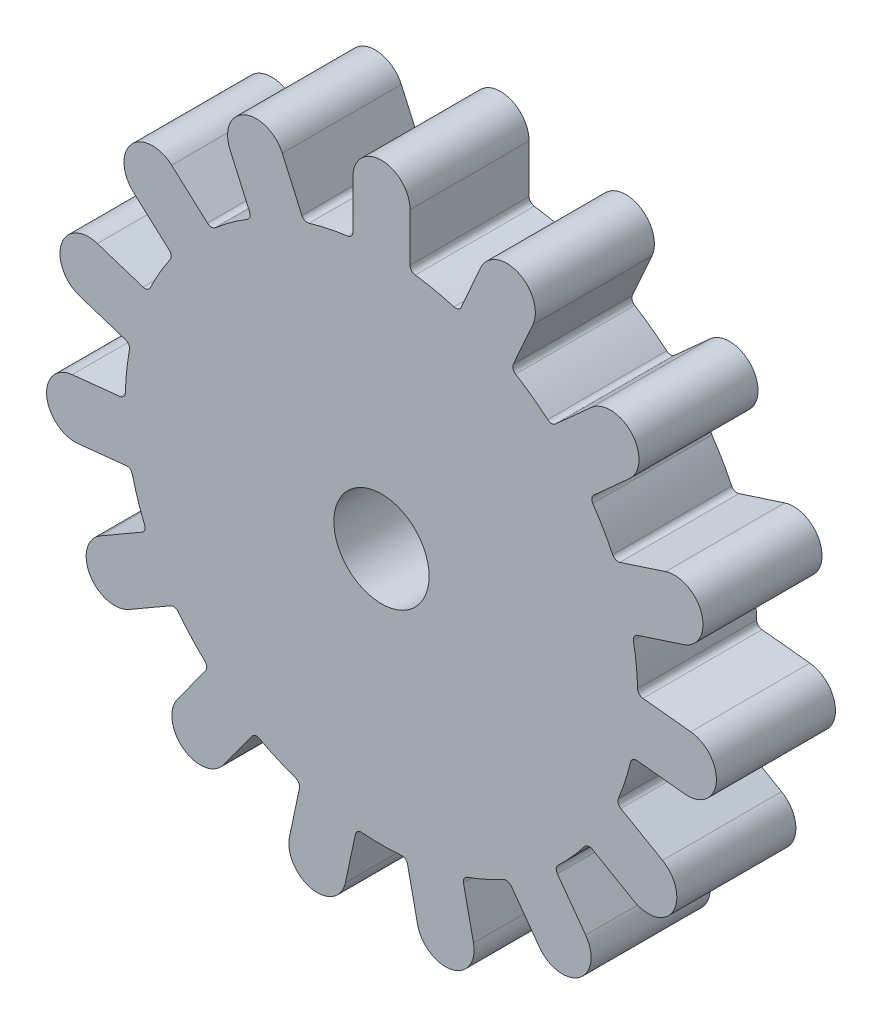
ISO-10303-21;
HEADER;
FILE_DESCRIPTION(('STEP AP214'),'2;1');
FILE_NAME('part.step','',(''),(''),'','','');
FILE_SCHEMA(('AUTOMOTIVE_DESIGN { 1 0 10303 214 1 1 1 1 }'));
ENDSEC;
DATA;
#1=APPLICATION_CONTEXT('core data for automotive mechanical design processes');
#2=APPLICATION_PROTOCOL_DEFINITION('international standard','automotive_design',2000,#1);
#3=PRODUCT_CONTEXT('',#1,'mechanical');
#4=PRODUCT('Part','Part','',(#3));
#5=PRODUCT_RELATED_PRODUCT_CATEGORY('part','',(#4));
#6=PRODUCT_DEFINITION_FORMATION('','',#4);
#7=PRODUCT_DEFINITION_CONTEXT('part definition',#1,'design');
#8=PRODUCT_DEFINITION('design','',#6,#7);
#9=PRODUCT_DEFINITION_SHAPE('','',#8);
#10=(LENGTH_UNIT() NAMED_UNIT(*) SI_UNIT(.MILLI.,.METRE.));
#11=(NAMED_UNIT(*) PLANE_ANGLE_UNIT() SI_UNIT($,.RADIAN.));
#12=(NAMED_UNIT(*) SI_UNIT($,.STERADIAN.) SOLID_ANGLE_UNIT());
#13=UNCERTAINTY_MEASURE_WITH_UNIT(LENGTH_MEASURE(1.E-05),#10,'distance_accuracy_value','');
#14=(GEOMETRIC_REPRESENTATION_CONTEXT(3) GLOBAL_UNCERTAINTY_ASSIGNED_CONTEXT((#13)) GLOBAL_UNIT_ASSIGNED_CONTEXT((#10,
#11,#12)) REPRESENTATION_CONTEXT('',''));
#15=CARTESIAN_POINT('',(0.,0.,0.));
#16=DIRECTION('',(0.,0.,1.));
#17=DIRECTION('',(1.,0.,0.));
#18=AXIS2_PLACEMENT_3D('',#15,#16,#17);
#19=CARTESIAN_POINT('',(2.9,21.8332458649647,10.));
#20=DIRECTION('',(0.,0.,1.));
#21=DIRECTION('',(1.,0.,0.));
#22=AXIS2_PLACEMENT_3D('',#19,#20,#21);
#23=PLANE('',#22);
#24=CARTESIAN_POINT('',(2.9,21.8332458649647,10.));
#25=DIRECTION('',(0.,0.,-1.));
#26=DIRECTION('',(1.,0.,0.));
#27=AXIS2_PLACEMENT_3D('',#24,#25,#26);
#28=CIRCLE('',#27,0.5);
#29=CARTESIAN_POINT('',(2.83416572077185,21.3375989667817,10.));
#30=VERTEX_POINT('',#29);
#31=CARTESIAN_POINT('',(2.4,21.8332458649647,10.));
#32=VERTEX_POINT('',#31);
#33=EDGE_CURVE('E800',#30,#32,#28,.T.);
#34=ORIENTED_EDGE('',*,*,#33,.T.);
#35=DIRECTION('',(0.,1.,0.));
#36=VECTOR('',#35,1.);
#37=CARTESIAN_POINT('',(2.40000000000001,25.875,10.));
#38=LINE('',#37,#36);
#39=CARTESIAN_POINT('',(2.40000000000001,25.875,10.));
#40=VERTEX_POINT('',#39);
#41=EDGE_CURVE('E338',#32,#40,#38,.T.);
#42=ORIENTED_EDGE('',*,*,#41,.T.);
#43=CARTESIAN_POINT('',(0.,25.875,10.));
#44=DIRECTION('',(0.,0.,1.));
#45=DIRECTION('',(1.,0.,0.));
#46=AXIS2_PLACEMENT_3D('',#43,#44,#45);
#47=CIRCLE('',#46,2.40000000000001);
#48=CARTESIAN_POINT('',(-2.40000000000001,25.875,10.));
#49=VERTEX_POINT('',#48);
#50=EDGE_CURVE('E1061',#40,#49,#47,.T.);
#51=ORIENTED_EDGE('',*,*,#50,.T.);
#52=DIRECTION('',(0.,-1.,0.));
#53=VECTOR('',#52,1.);
#54=CARTESIAN_POINT('',(-2.40000000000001,25.875,10.));
#55=LINE('',#54,#53);
#56=CARTESIAN_POINT('',(-2.4,21.8332458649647,10.));
#57=VERTEX_POINT('',#56);
#58=EDGE_CURVE('E1080',#49,#57,#55,.T.);
#59=ORIENTED_EDGE('',*,*,#58,.T.);
#60=CARTESIAN_POINT('',(-2.9,21.8332458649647,10.));
#61=DIRECTION('',(0.,0.,-1.));
#62=DIRECTION('',(-1.,0.,0.));
#63=AXIS2_PLACEMENT_3D('',#60,#61,#62);
#64=CIRCLE('',#63,0.5);
#65=CARTESIAN_POINT('',(-2.83416572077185,21.3375989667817,10.));
#66=VERTEX_POINT('',#65);
#67=EDGE_CURVE('E1077',#57,#66,#64,.T.);
#68=ORIENTED_EDGE('',*,*,#67,.T.);
#69=CARTESIAN_POINT('',(0.,0.,10.));
#70=DIRECTION('',(0.,0.,1.));
#71=DIRECTION('',(1.,0.,0.));
#72=AXIS2_PLACEMENT_3D('',#69,#70,#71);
#73=CIRCLE('',#72,21.525);
#74=CARTESIAN_POINT('',(-6.08964415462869,20.6456256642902,10.));
#75=VERTEX_POINT('',#74);
#76=EDGE_CURVE('E1079',#66,#75,#73,.T.);
#77=ORIENTED_EDGE('',*,*,#76,.T.);
#78=CARTESIAN_POINT('',(-6.23109930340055,21.1251988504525,10.));
#79=DIRECTION('',(0.,0.,-1.));
#80=DIRECTION('',(1.,0.,0.));
#81=AXIS2_PLACEMENT_3D('',#78,#79,#80);
#82=CIRCLE('',#81,0.499999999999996);
#83=CARTESIAN_POINT('',(-6.68787203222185,20.9218305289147,10.));
#84=VERTEX_POINT('',#83);
#85=EDGE_CURVE('E1082',#75,#84,#82,.T.);
#86=ORIENTED_EDGE('',*,*,#85,.T.);
#87=DIRECTION('',(-0.40673664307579,0.913545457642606,0.));
#88=VECTOR('',#87,1.);
#89=CARTESIAN_POINT('',(-8.33180154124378,24.6141566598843,10.));
#90=LINE('',#89,#88);
#91=CARTESIAN_POINT('',(-8.33180154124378,24.6141566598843,10.));
#92=VERTEX_POINT('',#91);
#93=EDGE_CURVE('E1088',#84,#92,#90,.T.);
#94=ORIENTED_EDGE('',*,*,#93,.T.);
#95=CARTESIAN_POINT('',(-10.524310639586,23.6379887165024,10.));
#96=DIRECTION('',(0.,0.,1.));
#97=DIRECTION('',(1.,0.,0.));
#98=AXIS2_PLACEMENT_3D('',#95,#96,#97);
#99=CIRCLE('',#98,2.4);
#100=CARTESIAN_POINT('',(-12.7168197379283,22.6618207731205,10.));
#101=VERTEX_POINT('',#100);
#102=EDGE_CURVE('E1090',#92,#101,#99,.T.);
#103=ORIENTED_EDGE('',*,*,#102,.T.);
#104=DIRECTION('',(0.40673664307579,-0.913545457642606,0.));
#105=VECTOR('',#104,1.);
#106=CARTESIAN_POINT('',(-12.7168197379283,22.6618207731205,10.));
#107=LINE('',#106,#105);
#108=CARTESIAN_POINT('',(-11.0728902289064,18.9694946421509,10.));
#109=VERTEX_POINT('',#108);
#110=EDGE_CURVE('E1092',#101,#109,#107,.T.);
#111=ORIENTED_EDGE('',*,*,#110,.T.);
#112=CARTESIAN_POINT('',(-11.5296629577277,18.766126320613,10.));
#113=DIRECTION('',(0.,0.,-1.));
#114=DIRECTION('',(-1.,0.,0.));
#115=AXIS2_PLACEMENT_3D('',#112,#113,#114);
#116=CIRCLE('',#115,0.499999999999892);
#117=CARTESIAN_POINT('',(-11.2679225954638,18.3401075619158,10.));
#118=VERTEX_POINT('',#117);
#119=EDGE_CURVE('E1094',#109,#118,#116,.T.);
#120=ORIENTED_EDGE('',*,*,#119,.T.);
#121=CARTESIAN_POINT('',(0.,0.,10.));
#122=DIRECTION('',(0.,0.,1.));
#123=DIRECTION('',(1.,0.,0.));
#124=AXIS2_PLACEMENT_3D('',#121,#122,#123);
#125=CIRCLE('',#124,21.5250000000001);
#126=CARTESIAN_POINT('',(-13.9604992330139,16.383836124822,10.));
#127=VERTEX_POINT('',#126);
#128=EDGE_CURVE('E1096',#118,#127,#125,.T.);
#129=ORIENTED_EDGE('',*,*,#128,.T.);
#130=CARTESIAN_POINT('',(-14.2847849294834,16.7644130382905,10.));
#131=DIRECTION('',(0.,0.,-1.));
#132=DIRECTION('',(1.,0.,0.));
#133=AXIS2_PLACEMENT_3D('',#130,#131,#132);
#134=CIRCLE('',#133,0.5);
#135=CARTESIAN_POINT('',(-14.6193502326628,16.3928406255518,10.));
#136=VERTEX_POINT('',#135);
#137=EDGE_CURVE('E1098',#127,#136,#134,.T.);
#138=ORIENTED_EDGE('',*,*,#137,.T.);
#139=DIRECTION('',(-0.743144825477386,0.669130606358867,0.));
#140=VECTOR('',#139,1.);
#141=CARTESIAN_POINT('',(-17.6229589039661,19.0973020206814,10.));
#142=LINE('',#141,#140);
#143=CARTESIAN_POINT('',(-17.6229589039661,19.0973020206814,10.));
#144=VERTEX_POINT('',#143);
#145=EDGE_CURVE('E1100',#136,#144,#142,.T.);
#146=ORIENTED_EDGE('',*,*,#145,.T.);
#147=CARTESIAN_POINT('',(-19.2288723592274,17.3137544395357,10.));
#148=DIRECTION('',(0.,0.,1.));
#149=DIRECTION('',(1.,0.,0.));
#150=AXIS2_PLACEMENT_3D('',#147,#148,#149);
#151=CIRCLE('',#150,2.4);
#152=CARTESIAN_POINT('',(-20.8347858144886,15.53020685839,10.));
#153=VERTEX_POINT('',#152);
#154=EDGE_CURVE('E1102',#144,#153,#151,.T.);
#155=ORIENTED_EDGE('',*,*,#154,.T.);
#156=DIRECTION('',(0.743144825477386,-0.669130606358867,0.));
#157=VECTOR('',#156,1.);
#158=CARTESIAN_POINT('',(-20.8347858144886,15.53020685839,10.));
#159=LINE('',#158,#157);
#160=CARTESIAN_POINT('',(-17.8311771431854,12.8257454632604,10.));
#161=VERTEX_POINT('',#160);
#162=EDGE_CURVE('E1104',#153,#161,#159,.T.);
#163=ORIENTED_EDGE('',*,*,#162,.T.);
#164=CARTESIAN_POINT('',(-18.1657424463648,12.4541730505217,10.));
#165=DIRECTION('',(0.,0.,-1.));
#166=DIRECTION('',(-1.,0.,0.));
#167=AXIS2_PLACEMENT_3D('',#164,#165,#166);
#168=CIRCLE('',#167,0.499999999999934);
#169=CARTESIAN_POINT('',(-17.7533532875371,12.1714449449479,10.));
#170=VERTEX_POINT('',#169);
#171=EDGE_CURVE('E1106',#161,#170,#168,.T.);
#172=ORIENTED_EDGE('',*,*,#171,.T.);
#173=CARTESIAN_POINT('',(0.,0.,10.));
#174=DIRECTION('',(0.,0.,1.));
#175=DIRECTION('',(1.,0.,0.));
#176=AXIS2_PLACEMENT_3D('',#173,#174,#175);
#177=CIRCLE('',#176,21.5250000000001);
#178=CARTESIAN_POINT('',(-19.417457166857,9.28913247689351,10.));
#179=VERTEX_POINT('',#178);
#180=EDGE_CURVE('E1108',#170,#179,#177,.T.);
#181=ORIENTED_EDGE('',*,*,#180,.T.);
#182=CARTESIAN_POINT('',(-19.8685014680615,9.50490791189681,10.));
#183=DIRECTION('',(0.,0.,-1.));
#184=DIRECTION('',(1.,0.,0.));
#185=AXIS2_PLACEMENT_3D('',#182,#183,#184);
#186=CIRCLE('',#185,0.5);
#187=CARTESIAN_POINT('',(-20.023009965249,9.02937965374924,10.));
#188=VERTEX_POINT('',#187);
#189=EDGE_CURVE('E1110',#179,#188,#186,.T.);
#190=ORIENTED_EDGE('',*,*,#189,.T.);
#191=DIRECTION('',(-0.95105651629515,0.309016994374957,0.));
#192=VECTOR('',#191,1.);
#193=CARTESIAN_POINT('',(-23.8669465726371,10.2783503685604,10.));
#194=LINE('',#193,#192);
#195=CARTESIAN_POINT('',(-23.8669465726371,10.2783503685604,10.));
#196=VERTEX_POINT('',#195);
#197=EDGE_CURVE('E1112',#188,#196,#194,.T.);
#198=ORIENTED_EDGE('',*,*,#197,.T.);
#199=CARTESIAN_POINT('',(-24.608587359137,7.99581472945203,10.));
#200=DIRECTION('',(0.,0.,1.));
#201=DIRECTION('',(1.,0.,0.));
#202=AXIS2_PLACEMENT_3D('',#199,#200,#201);
#203=CIRCLE('',#202,2.4);
#204=CARTESIAN_POINT('',(-25.3502281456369,5.71327909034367,10.));
#205=VERTEX_POINT('',#204);
#206=EDGE_CURVE('E1114',#196,#205,#203,.T.);
#207=ORIENTED_EDGE('',*,*,#206,.T.);
#208=DIRECTION('',(0.95105651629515,-0.309016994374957,0.));
#209=VECTOR('',#208,1.);
#210=CARTESIAN_POINT('',(-25.3502281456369,5.71327909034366,10.));
#211=LINE('',#210,#209);
#212=CARTESIAN_POINT('',(-21.5062915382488,4.46430837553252,10.));
#213=VERTEX_POINT('',#212);
#214=EDGE_CURVE('E1116',#205,#213,#211,.T.);
#215=ORIENTED_EDGE('',*,*,#214,.T.);
#216=CARTESIAN_POINT('',(-21.6608000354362,3.98878011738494,10.));
#217=DIRECTION('',(0.,0.,-1.));
#218=DIRECTION('',(-1.,0.,0.));
#219=AXIS2_PLACEMENT_3D('',#216,#217,#218);
#220=CIRCLE('',#219,0.499999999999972);
#221=CARTESIAN_POINT('',(-21.1690679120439,3.89822892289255,10.));
#222=VERTEX_POINT('',#221);
#223=EDGE_CURVE('E1118',#213,#222,#220,.T.);
#224=ORIENTED_EDGE('',*,*,#223,.T.);
#225=CARTESIAN_POINT('',(0.,0.,10.));
#226=DIRECTION('',(0.,0.,1.));
#227=DIRECTION('',(1.,0.,0.));
#228=AXIS2_PLACEMENT_3D('',#225,#226,#227);
#229=CIRCLE('',#228,21.525);
#230=CARTESIAN_POINT('',(-21.51696035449,0.588253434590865,10.));
#231=VERTEX_POINT('',#230);
#232=EDGE_CURVE('E1120',#222,#231,#229,.T.);
#233=ORIENTED_EDGE('',*,*,#232,.T.);
#234=CARTESIAN_POINT('',(-22.0167736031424,0.601917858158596,10.));
#235=DIRECTION('',(0.,0.,-1.));
#236=DIRECTION('',(1.,0.,0.));
#237=AXIS2_PLACEMENT_3D('',#234,#235,#236);
#238=CIRCLE('',#237,0.500000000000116);
#239=CARTESIAN_POINT('',(-21.9645093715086,0.104656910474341,10.));
#240=VERTEX_POINT('',#239);
#241=EDGE_CURVE('E1122',#231,#240,#238,.T.);
#242=ORIENTED_EDGE('',*,*,#241,.T.);
#243=DIRECTION('',(-0.994521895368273,-0.104528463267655,0.));
#244=VECTOR('',#243,1.);
#245=CARTESIAN_POINT('',(-25.9841223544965,-0.317821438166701,10.));
#246=LINE('',#245,#244);
#247=CARTESIAN_POINT('',(-25.9841223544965,-0.317821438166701,10.));
#248=VERTEX_POINT('',#247);
#249=EDGE_CURVE('E1124',#240,#248,#246,.T.);
#250=ORIENTED_EDGE('',*,*,#249,.T.);
#251=CARTESIAN_POINT('',(-25.7332540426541,-2.70467398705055,10.));
#252=DIRECTION('',(0.,0.,1.));
#253=DIRECTION('',(1.,0.,0.));
#254=AXIS2_PLACEMENT_3D('',#251,#252,#253);
#255=CIRCLE('',#254,2.4);
#256=CARTESIAN_POINT('',(-25.4823857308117,-5.09152653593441,10.));
#257=VERTEX_POINT('',#256);
#258=EDGE_CURVE('E1126',#248,#257,#255,.T.);
#259=ORIENTED_EDGE('',*,*,#258,.T.);
#260=DIRECTION('',(0.994521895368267,0.104528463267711,0.));
#261=VECTOR('',#260,1.);
#262=CARTESIAN_POINT('',(-25.4823857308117,-5.09152653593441,10.));
#263=LINE('',#262,#261);
#264=CARTESIAN_POINT('',(-21.4627727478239,-4.66904818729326,10.));
#265=VERTEX_POINT('',#264);
#266=EDGE_CURVE('E1128',#257,#265,#263,.T.);
#267=ORIENTED_EDGE('',*,*,#266,.T.);
#268=CARTESIAN_POINT('',(-21.4105085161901,-5.1663091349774,10.));
#269=DIRECTION('',(0.,0.,-1.));
#270=DIRECTION('',(-1.,0.,0.));
#271=AXIS2_PLACEMENT_3D('',#268,#269,#270);
#272=CIRCLE('',#271,0.499999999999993);
#273=CARTESIAN_POINT('',(-20.9244583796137,-5.04902629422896,10.));
#274=VERTEX_POINT('',#273);
#275=EDGE_CURVE('E1130',#265,#274,#272,.T.);
#276=ORIENTED_EDGE('',*,*,#275,.T.);
#277=CARTESIAN_POINT('',(0.,0.,10.));
#278=DIRECTION('',(0.,0.,1.));
#279=DIRECTION('',(1.,0.,0.));
#280=AXIS2_PLACEMENT_3D('',#277,#278,#279);
#281=CIRCLE('',#280,21.525);
#282=CARTESIAN_POINT('',(-19.8959856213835,-8.21433997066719,10.));
#283=VERTEX_POINT('',#282);
#284=EDGE_CURVE('E1132',#274,#283,#281,.T.);
#285=ORIENTED_EDGE('',*,*,#284,.T.);
#286=CARTESIAN_POINT('',(-20.3581455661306,-8.40514926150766,10.));
#287=DIRECTION('',(0.,0.,-1.));
#288=DIRECTION('',(1.,0.,0.));
#289=AXIS2_PLACEMENT_3D('',#286,#287,#288);
#290=CIRCLE('',#289,0.499999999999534);
#291=CARTESIAN_POINT('',(-20.108145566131,-8.83816196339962,10.));
#292=VERTEX_POINT('',#291);
#293=EDGE_CURVE('E1134',#283,#292,#290,.T.);
#294=ORIENTED_EDGE('',*,*,#293,.T.);
#295=DIRECTION('',(-0.866025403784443,-0.499999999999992,0.));
#296=VECTOR('',#295,1.);
#297=CARTESIAN_POINT('',(-23.6084073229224,-10.8590390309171,10.));
#298=LINE('',#297,#296);
#299=CARTESIAN_POINT('',(-23.6084073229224,-10.8590390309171,10.));
#300=VERTEX_POINT('',#299);
#301=EDGE_CURVE('E1136',#292,#300,#298,.T.);
#302=ORIENTED_EDGE('',*,*,#301,.T.);
#303=CARTESIAN_POINT('',(-22.4084073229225,-12.9374999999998,10.));
#304=DIRECTION('',(0.,0.,1.));
#305=DIRECTION('',(1.,0.,0.));
#306=AXIS2_PLACEMENT_3D('',#303,#304,#305);
#307=CIRCLE('',#306,2.4);
#308=CARTESIAN_POINT('',(-21.2084073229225,-15.0159609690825,10.));
#309=VERTEX_POINT('',#308);
#310=EDGE_CURVE('E1138',#300,#309,#307,.T.);
#311=ORIENTED_EDGE('',*,*,#310,.T.);
#312=DIRECTION('',(0.866025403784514,0.499999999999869,0.));
#313=VECTOR('',#312,1.);
#314=CARTESIAN_POINT('',(-21.2084073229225,-15.0159609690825,10.));
#315=LINE('',#314,#313);
#316=CARTESIAN_POINT('',(-17.7081455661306,-12.9950839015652,10.));
#317=VERTEX_POINT('',#316);
#318=EDGE_CURVE('E1140',#309,#317,#315,.T.);
#319=ORIENTED_EDGE('',*,*,#318,.T.);
#320=CARTESIAN_POINT('',(-17.4581455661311,-13.4280966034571,10.));
#321=DIRECTION('',(0.,0.,-1.));
#322=DIRECTION('',(-1.,0.,0.));
#323=AXIS2_PLACEMENT_3D('',#320,#321,#322);
#324=CIRCLE('',#323,0.499999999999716);
#325=CARTESIAN_POINT('',(-17.0618199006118,-13.1232589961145,10.));
#326=VERTEX_POINT('',#325);
#327=EDGE_CURVE('E1142',#317,#326,#324,.T.);
#328=ORIENTED_EDGE('',*,*,#327,.T.);
#329=CARTESIAN_POINT('',(0.,0.,10.));
#330=DIRECTION('',(0.,0.,1.));
#331=DIRECTION('',(1.,0.,0.));
#332=AXIS2_PLACEMENT_3D('',#329,#330,#331);
#333=CIRCLE('',#332,21.525);
#334=CARTESIAN_POINT('',(-14.8348142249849,-15.596599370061,10.));
#335=VERTEX_POINT('',#334);
#336=EDGE_CURVE('E1144',#326,#335,#333,.T.);
#337=ORIENTED_EDGE('',*,*,#336,.T.);
#338=CARTESIAN_POINT('',(-15.1794092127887,-15.9588897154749,10.));
#339=DIRECTION('',(0.,0.,-1.));
#340=DIRECTION('',(1.,0.,0.));
#341=AXIS2_PLACEMENT_3D('',#338,#339,#340);
#342=CIRCLE('',#341,0.49999999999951);
#343=CARTESIAN_POINT('',(-14.7749007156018,-16.252782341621,10.));
#344=VERTEX_POINT('',#343);
#345=EDGE_CURVE('E1146',#335,#344,#342,.T.);
#346=ORIENTED_EDGE('',*,*,#345,.T.);
#347=DIRECTION('',(-0.587785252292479,-0.809016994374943,0.));
#348=VECTOR('',#347,1.);
#349=CARTESIAN_POINT('',(-17.1505841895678,-19.5226301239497,10.));
#350=LINE('',#349,#348);
#351=CARTESIAN_POINT('',(-17.1505841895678,-19.5226301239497,10.));
#352=VERTEX_POINT('',#351);
#353=EDGE_CURVE('E1148',#344,#352,#350,.T.);
#354=ORIENTED_EDGE('',*,*,#353,.T.);
#355=CARTESIAN_POINT('',(-15.2089434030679,-20.9333147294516,10.));
#356=DIRECTION('',(0.,0.,1.));
#357=DIRECTION('',(1.,0.,0.));
#358=AXIS2_PLACEMENT_3D('',#355,#356,#357);
#359=CIRCLE('',#358,2.4);
#360=CARTESIAN_POINT('',(-13.267302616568,-22.3439993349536,10.));
#361=VERTEX_POINT('',#360);
#362=EDGE_CURVE('E1150',#352,#361,#359,.T.);
#363=ORIENTED_EDGE('',*,*,#362,.T.);
#364=DIRECTION('',(0.587785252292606,0.809016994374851,0.));
#365=VECTOR('',#364,1.);
#366=CARTESIAN_POINT('',(-13.267302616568,-22.3439993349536,10.));
#367=LINE('',#366,#365);
#368=CARTESIAN_POINT('',(-10.8916191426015,-19.074151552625,10.));
#369=VERTEX_POINT('',#368);
#370=EDGE_CURVE('E1152',#361,#369,#367,.T.);
#371=ORIENTED_EDGE('',*,*,#370,.T.);
#372=CARTESIAN_POINT('',(-10.4871106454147,-19.3680441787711,10.));
#373=DIRECTION('',(0.,0.,-1.));
#374=DIRECTION('',(-1.,0.,0.));
#375=AXIS2_PLACEMENT_3D('',#372,#373,#374);
#376=CIRCLE('',#375,0.499999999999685);
#377=CARTESIAN_POINT('',(-10.2490377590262,-18.9283609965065,10.));
#378=VERTEX_POINT('',#377);
#379=EDGE_CURVE('E1154',#369,#378,#376,.T.);
#380=ORIENTED_EDGE('',*,*,#379,.T.);
#381=CARTESIAN_POINT('',(0.,0.,10.));
#382=DIRECTION('',(0.,0.,1.));
#383=DIRECTION('',(1.,0.,0.));
#384=AXIS2_PLACEMENT_3D('',#381,#382,#383);
#385=CIRCLE('',#384,21.525);
#386=CARTESIAN_POINT('',(-7.20856867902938,-20.2820650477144,10.));
#387=VERTEX_POINT('',#386);
#388=EDGE_CURVE('E1156',#378,#387,#385,.T.);
#389=ORIENTED_EDGE('',*,*,#388,.T.);
#390=CARTESIAN_POINT('',(-7.37601510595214,-20.7531931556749,10.));
#391=DIRECTION('',(0.,0.,-1.));
#392=DIRECTION('',(1.,0.,0.));
#393=AXIS2_PLACEMENT_3D('',#390,#391,#392);
#394=CIRCLE('',#393,0.499999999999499);
#395=CARTESIAN_POINT('',(-6.88694130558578,-20.8571490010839,10.));
#396=VERTEX_POINT('',#395);
#397=EDGE_CURVE('E1158',#387,#396,#394,.T.);
#398=ORIENTED_EDGE('',*,*,#397,.T.);
#399=DIRECTION('',(-0.207911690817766,-0.978147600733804,0.));
#400=VECTOR('',#399,1.);
#401=CARTESIAN_POINT('',(-7.72726924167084,-24.8105811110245,10.));
#402=LINE('',#401,#400);
#403=CARTESIAN_POINT('',(-7.72726924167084,-24.8105811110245,10.));
#404=VERTEX_POINT('',#403);
#405=EDGE_CURVE('E1160',#396,#404,#402,.T.);
#406=ORIENTED_EDGE('',*,*,#405,.T.);
#407=CARTESIAN_POINT('',(-5.37971499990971,-25.3095691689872,10.));
#408=DIRECTION('',(0.,0.,1.));
#409=DIRECTION('',(1.,0.,0.));
#410=AXIS2_PLACEMENT_3D('',#407,#408,#409);
#411=CIRCLE('',#410,2.4);
#412=CARTESIAN_POINT('',(-3.03216075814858,-25.8085572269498,10.));
#413=VERTEX_POINT('',#412);
#414=EDGE_CURVE('E1162',#404,#413,#411,.T.);
#415=ORIENTED_EDGE('',*,*,#414,.T.);
#416=DIRECTION('',(0.207911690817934,0.978147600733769,0.));
#417=VECTOR('',#416,1.);
#418=CARTESIAN_POINT('',(-3.03216075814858,-25.8085572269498,10.));
#419=LINE('',#418,#417);
#420=CARTESIAN_POINT('',(-2.19183282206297,-21.855125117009,10.));
#421=VERTEX_POINT('',#420);
#422=EDGE_CURVE('E1164',#413,#421,#419,.T.);
#423=ORIENTED_EDGE('',*,*,#422,.T.);
#424=CARTESIAN_POINT('',(-1.7027590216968,-21.959080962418,10.));
#425=DIRECTION('',(0.,0.,-1.));
#426=DIRECTION('',(-1.,0.,0.));
#427=AXIS2_PLACEMENT_3D('',#424,#425,#426);
#428=CIRCLE('',#427,0.499999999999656);
#429=CARTESIAN_POINT('',(-1.66410387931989,-21.4605774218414,10.));
#430=VERTEX_POINT('',#429);
#431=EDGE_CURVE('E1166',#421,#430,#428,.T.);
#432=ORIENTED_EDGE('',*,*,#431,.T.);
#433=CARTESIAN_POINT('',(0.,0.,10.));
#434=DIRECTION('',(0.,0.,1.));
#435=DIRECTION('',(1.,0.,0.));
#436=AXIS2_PLACEMENT_3D('',#433,#434,#435);
#437=CIRCLE('',#436,21.525);
#438=CARTESIAN_POINT('',(1.6641038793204,-21.460577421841,10.));
#439=VERTEX_POINT('',#438);
#440=EDGE_CURVE('E1168',#430,#439,#437,.T.);
#441=ORIENTED_EDGE('',*,*,#440,.T.);
#442=CARTESIAN_POINT('',(1.70275902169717,-21.9590809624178,10.));
#443=DIRECTION('',(0.,0.,-1.));
#444=DIRECTION('',(1.,0.,0.));
#445=AXIS2_PLACEMENT_3D('',#442,#443,#444);
#446=CIRCLE('',#445,0.499999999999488);
#447=CARTESIAN_POINT('',(2.1918328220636,-21.8551251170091,10.));
#448=VERTEX_POINT('',#447);
#449=EDGE_CURVE('E1170',#439,#448,#446,.T.);
#450=ORIENTED_EDGE('',*,*,#449,.T.);
#451=DIRECTION('',(0.207911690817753,-0.978147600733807,0.));
#452=VECTOR('',#451,1.);
#453=CARTESIAN_POINT('',(3.03216075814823,-25.8085572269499,10.));
#454=LINE('',#453,#452);
#455=CARTESIAN_POINT('',(3.03216075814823,-25.8085572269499,10.));
#456=VERTEX_POINT('',#455);
#457=EDGE_CURVE('E1172',#448,#456,#454,.T.);
#458=ORIENTED_EDGE('',*,*,#457,.T.);
#459=CARTESIAN_POINT('',(5.37971499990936,-25.3095691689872,10.));
#460=DIRECTION('',(0.,0.,1.));
#461=DIRECTION('',(1.,0.,0.));
#462=AXIS2_PLACEMENT_3D('',#459,#460,#461);
#463=CIRCLE('',#462,2.4);
#464=CARTESIAN_POINT('',(7.7272692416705,-24.8105811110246,10.));
#465=VERTEX_POINT('',#464);
#466=EDGE_CURVE('E1174',#456,#465,#463,.T.);
#467=ORIENTED_EDGE('',*,*,#466,.T.);
#468=DIRECTION('',(-0.20791169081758,0.978147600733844,0.));
#469=VECTOR('',#468,1.);
#470=CARTESIAN_POINT('',(7.7272692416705,-24.8105811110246,10.));
#471=LINE('',#470,#469);
#472=CARTESIAN_POINT('',(6.88694130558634,-20.8571490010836,10.));
#473=VERTEX_POINT('',#472);
#474=EDGE_CURVE('E1176',#465,#473,#471,.T.);
#475=ORIENTED_EDGE('',*,*,#474,.T.);
#476=CARTESIAN_POINT('',(7.37601510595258,-20.7531931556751,10.));
#477=DIRECTION('',(0.,0.,-1.));
#478=DIRECTION('',(-1.,0.,0.));
#479=AXIS2_PLACEMENT_3D('',#476,#477,#478);
#480=CIRCLE('',#479,0.499999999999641);
#481=CARTESIAN_POINT('',(7.20856867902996,-20.2820650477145,10.));
#482=VERTEX_POINT('',#481);
#483=EDGE_CURVE('E1178',#473,#482,#480,.T.);
#484=ORIENTED_EDGE('',*,*,#483,.T.);
#485=CARTESIAN_POINT('',(0.,0.,10.));
#486=DIRECTION('',(0.,0.,1.));
#487=DIRECTION('',(1.,0.,0.));
#488=AXIS2_PLACEMENT_3D('',#485,#486,#487);
#489=CIRCLE('',#488,21.5250000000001);
#490=CARTESIAN_POINT('',(10.2490377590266,-18.928360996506,10.));
#491=VERTEX_POINT('',#490);
#492=EDGE_CURVE('E1180',#482,#491,#489,.T.);
#493=ORIENTED_EDGE('',*,*,#492,.T.);
#494=CARTESIAN_POINT('',(10.487110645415,-19.3680441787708,10.));
#495=DIRECTION('',(0.,0.,-1.));
#496=DIRECTION('',(1.,0.,0.));
#497=AXIS2_PLACEMENT_3D('',#494,#495,#496);
#498=CIRCLE('',#497,0.499999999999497);
#499=CARTESIAN_POINT('',(10.8916191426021,-19.0741515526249,10.));
#500=VERTEX_POINT('',#499);
#501=EDGE_CURVE('E1182',#491,#500,#498,.T.);
#502=ORIENTED_EDGE('',*,*,#501,.T.);
#503=DIRECTION('',(0.587785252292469,-0.80901699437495,0.));
#504=VECTOR('',#503,1.);
#505=CARTESIAN_POINT('',(13.2673026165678,-22.3439993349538,10.));
#506=LINE('',#505,#504);
#507=CARTESIAN_POINT('',(13.2673026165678,-22.3439993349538,10.));
#508=VERTEX_POINT('',#507);
#509=EDGE_CURVE('E1184',#500,#508,#506,.T.);
#510=ORIENTED_EDGE('',*,*,#509,.T.);
#511=CARTESIAN_POINT('',(15.2089434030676,-20.9333147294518,10.));
#512=DIRECTION('',(0.,0.,1.));
#513=DIRECTION('',(1.,0.,0.));
#514=AXIS2_PLACEMENT_3D('',#511,#512,#513);
#515=CIRCLE('',#514,2.4);
#516=CARTESIAN_POINT('',(17.1505841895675,-19.5226301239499,10.));
#517=VERTEX_POINT('',#516);
#518=EDGE_CURVE('E1186',#508,#517,#515,.T.);
#519=ORIENTED_EDGE('',*,*,#518,.T.);
#520=DIRECTION('',(-0.587785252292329,0.809016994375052,0.));
#521=VECTOR('',#520,1.);
#522=CARTESIAN_POINT('',(17.1505841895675,-19.5226301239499,10.));
#523=LINE('',#522,#521);
#524=CARTESIAN_POINT('',(14.7749007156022,-16.2527823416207,10.));
#525=VERTEX_POINT('',#524);
#526=EDGE_CURVE('E1188',#517,#525,#523,.T.);
#527=ORIENTED_EDGE('',*,*,#526,.T.);
#528=CARTESIAN_POINT('',(15.1794092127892,-15.9588897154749,10.));
#529=DIRECTION('',(0.,0.,-1.));
#530=DIRECTION('',(-1.,0.,0.));
#531=AXIS2_PLACEMENT_3D('',#528,#529,#530);
#532=CIRCLE('',#531,0.499999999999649);
#533=CARTESIAN_POINT('',(14.834814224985,-15.5965993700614,10.));
#534=VERTEX_POINT('',#533);
#535=EDGE_CURVE('E1190',#525,#534,#532,.T.);
#536=ORIENTED_EDGE('',*,*,#535,.T.);
#537=CARTESIAN_POINT('',(0.,0.,10.));
#538=DIRECTION('',(0.,0.,1.));
#539=DIRECTION('',(1.,0.,0.));
#540=AXIS2_PLACEMENT_3D('',#537,#538,#539);
#541=CIRCLE('',#540,21.5250000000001);
#542=CARTESIAN_POINT('',(17.061819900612,-13.1232589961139,10.));
#543=VERTEX_POINT('',#542);
#544=EDGE_CURVE('E1192',#534,#543,#541,.T.);
#545=ORIENTED_EDGE('',*,*,#544,.T.);
#546=CARTESIAN_POINT('',(17.4581455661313,-13.4280966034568,10.));
#547=DIRECTION('',(0.,0.,-1.));
#548=DIRECTION('',(1.,0.,0.));
#549=AXIS2_PLACEMENT_3D('',#546,#547,#548);
#550=CIRCLE('',#549,0.499999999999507);
#551=CARTESIAN_POINT('',(17.7081455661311,-12.995083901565,10.));
#552=VERTEX_POINT('',#551);
#553=EDGE_CURVE('E1194',#543,#552,#550,.T.);
#554=ORIENTED_EDGE('',*,*,#553,.T.);
#555=DIRECTION('',(0.866025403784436,-0.500000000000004,0.));
#556=VECTOR('',#555,1.);
#557=CARTESIAN_POINT('',(21.2084073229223,-15.0159609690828,10.));
#558=LINE('',#557,#556);
#559=CARTESIAN_POINT('',(21.2084073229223,-15.0159609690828,10.));
#560=VERTEX_POINT('',#559);
#561=EDGE_CURVE('E1196',#552,#560,#558,.T.);
#562=ORIENTED_EDGE('',*,*,#561,.T.);
#563=CARTESIAN_POINT('',(22.4084073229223,-12.9375000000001,10.));
#564=DIRECTION('',(0.,0.,1.));
#565=DIRECTION('',(1.,0.,0.));
#566=AXIS2_PLACEMENT_3D('',#563,#564,#565);
#567=CIRCLE('',#566,2.4);
#568=CARTESIAN_POINT('',(23.6084073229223,-10.8590390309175,10.));
#569=VERTEX_POINT('',#568);
#570=EDGE_CURVE('E1198',#560,#569,#567,.T.);
#571=ORIENTED_EDGE('',*,*,#570,.T.);
#572=DIRECTION('',(-0.866025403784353,0.500000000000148,0.));
#573=VECTOR('',#572,1.);
#574=CARTESIAN_POINT('',(23.6084073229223,-10.8590390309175,10.));
#575=LINE('',#574,#573);
#576=CARTESIAN_POINT('',(20.1081455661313,-8.83816196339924,10.));
#577=VERTEX_POINT('',#576);
#578=EDGE_CURVE('E1200',#569,#577,#575,.T.);
#579=ORIENTED_EDGE('',*,*,#578,.T.);
#580=CARTESIAN_POINT('',(20.358145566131,-8.4051492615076,10.));
#581=DIRECTION('',(0.,0.,-1.));
#582=DIRECTION('',(-1.,0.,0.));
#583=AXIS2_PLACEMENT_3D('',#580,#581,#582);
#584=CIRCLE('',#583,0.499999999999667);
#585=CARTESIAN_POINT('',(19.8959856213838,-8.2143399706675,10.));
#586=VERTEX_POINT('',#585);
#587=EDGE_CURVE('E1202',#577,#586,#584,.T.);
#588=ORIENTED_EDGE('',*,*,#587,.T.);
#589=CARTESIAN_POINT('',(0.,0.,10.));
#590=DIRECTION('',(0.,0.,1.));
#591=DIRECTION('',(1.,0.,0.));
#592=AXIS2_PLACEMENT_3D('',#589,#590,#591);
#593=CIRCLE('',#592,21.5250000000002);
#594=CARTESIAN_POINT('',(20.9244583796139,-5.04902629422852,10.));
#595=VERTEX_POINT('',#594);
#596=EDGE_CURVE('E1204',#586,#595,#593,.T.);
#597=ORIENTED_EDGE('',*,*,#596,.T.);
#598=CARTESIAN_POINT('',(21.41050851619,-5.16630913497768,10.));
#599=DIRECTION('',(0.,0.,-1.));
#600=DIRECTION('',(1.,0.,0.));
#601=AXIS2_PLACEMENT_3D('',#598,#599,#600);
#602=CIRCLE('',#601,0.499999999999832);
#603=CARTESIAN_POINT('',(21.4627727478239,-4.66904818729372,10.));
#604=VERTEX_POINT('',#603);
#605=EDGE_CURVE('E1206',#595,#604,#602,.T.);
#606=ORIENTED_EDGE('',*,*,#605,.T.);
#607=DIRECTION('',(0.994521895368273,-0.104528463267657,0.));
#608=VECTOR('',#607,1.);
#609=CARTESIAN_POINT('',(25.4823857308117,-5.09152653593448,10.));
#610=LINE('',#609,#608);
#611=CARTESIAN_POINT('',(25.4823857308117,-5.09152653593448,10.));
#612=VERTEX_POINT('',#611);
#613=EDGE_CURVE('E1208',#604,#612,#610,.T.);
#614=ORIENTED_EDGE('',*,*,#613,.T.);
#615=CARTESIAN_POINT('',(25.7332540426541,-2.70467398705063,10.));
#616=DIRECTION('',(0.,0.,1.));
#617=DIRECTION('',(1.,0.,0.));
#618=AXIS2_PLACEMENT_3D('',#615,#616,#617);
#619=CIRCLE('',#618,2.4);
#620=CARTESIAN_POINT('',(25.9841223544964,-0.317821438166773,10.));
#621=VERTEX_POINT('',#620);
#622=EDGE_CURVE('E1210',#612,#621,#619,.T.);
#623=ORIENTED_EDGE('',*,*,#622,.T.);
#624=DIRECTION('',(-0.994521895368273,0.104528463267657,0.));
#625=VECTOR('',#624,1.);
#626=CARTESIAN_POINT('',(25.9841223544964,-0.317821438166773,10.));
#627=LINE('',#626,#625);
#628=CARTESIAN_POINT('',(21.9645093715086,0.104656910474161,10.));
#629=VERTEX_POINT('',#628);
#630=EDGE_CURVE('E1212',#621,#629,#627,.T.);
#631=ORIENTED_EDGE('',*,*,#630,.T.);
#632=CARTESIAN_POINT('',(22.0167736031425,0.601917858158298,10.));
#633=DIRECTION('',(0.,0.,-1.));
#634=DIRECTION('',(-1.,0.,0.));
#635=AXIS2_PLACEMENT_3D('',#632,#633,#634);
#636=CIRCLE('',#635,0.500000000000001);
#637=CARTESIAN_POINT('',(21.51696035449,0.588253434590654,10.));
#638=VERTEX_POINT('',#637);
#639=EDGE_CURVE('E1214',#629,#638,#636,.T.);
#640=ORIENTED_EDGE('',*,*,#639,.T.);
#641=CARTESIAN_POINT('',(0.,0.,10.));
#642=DIRECTION('',(0.,0.,1.));
#643=DIRECTION('',(1.,0.,0.));
#644=AXIS2_PLACEMENT_3D('',#641,#642,#643);
#645=CIRCLE('',#644,21.525);
#646=CARTESIAN_POINT('',(21.1690679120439,3.89822892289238,10.));
#647=VERTEX_POINT('',#646);
#648=EDGE_CURVE('E1216',#638,#647,#645,.T.);
#649=ORIENTED_EDGE('',*,*,#648,.T.);
#650=CARTESIAN_POINT('',(21.6608000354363,3.98878011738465,10.));
#651=DIRECTION('',(0.,0.,-1.));
#652=DIRECTION('',(1.,0.,0.));
#653=AXIS2_PLACEMENT_3D('',#650,#651,#652);
#654=CIRCLE('',#653,0.500000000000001);
#655=CARTESIAN_POINT('',(21.5062915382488,4.46430837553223,10.));
#656=VERTEX_POINT('',#655);
#657=EDGE_CURVE('E1218',#647,#656,#654,.T.);
#658=ORIENTED_EDGE('',*,*,#657,.T.);
#659=DIRECTION('',(0.951056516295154,0.309016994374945,0.));
#660=VECTOR('',#659,1.);
#661=CARTESIAN_POINT('',(25.350228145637,5.71327909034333,10.));
#662=LINE('',#661,#660);
#663=CARTESIAN_POINT('',(25.350228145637,5.71327909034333,10.));
#664=VERTEX_POINT('',#663);
#665=EDGE_CURVE('E1220',#656,#664,#662,.T.);
#666=ORIENTED_EDGE('',*,*,#665,.T.);
#667=CARTESIAN_POINT('',(24.6085873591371,7.9958147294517,10.));
#668=DIRECTION('',(0.,0.,1.));
#669=DIRECTION('',(1.,0.,0.));
#670=AXIS2_PLACEMENT_3D('',#667,#668,#669);
#671=CIRCLE('',#670,2.4);
#672=CARTESIAN_POINT('',(23.8669465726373,10.2783503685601,10.));
#673=VERTEX_POINT('',#672);
#674=EDGE_CURVE('E1222',#664,#673,#671,.T.);
#675=ORIENTED_EDGE('',*,*,#674,.T.);
#676=DIRECTION('',(-0.951056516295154,-0.309016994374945,0.));
#677=VECTOR('',#676,1.);
#678=CARTESIAN_POINT('',(23.8669465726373,10.2783503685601,10.));
#679=LINE('',#678,#677);
#680=CARTESIAN_POINT('',(20.0230099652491,9.02937965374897,10.));
#681=VERTEX_POINT('',#680);
#682=EDGE_CURVE('E1224',#673,#681,#679,.T.);
#683=ORIENTED_EDGE('',*,*,#682,.T.);
#684=CARTESIAN_POINT('',(19.8685014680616,9.50490791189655,10.));
#685=DIRECTION('',(0.,0.,-1.));
#686=DIRECTION('',(-1.,0.,0.));
#687=AXIS2_PLACEMENT_3D('',#684,#685,#686);
#688=CIRCLE('',#687,0.500000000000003);
#689=CARTESIAN_POINT('',(19.417457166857,9.28913247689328,10.));
#690=VERTEX_POINT('',#689);
#691=EDGE_CURVE('E1226',#681,#690,#688,.T.);
#692=ORIENTED_EDGE('',*,*,#691,.T.);
#693=CARTESIAN_POINT('',(0.,0.,10.));
#694=DIRECTION('',(0.,0.,1.));
#695=DIRECTION('',(1.,0.,0.));
#696=AXIS2_PLACEMENT_3D('',#693,#694,#695);
#697=CIRCLE('',#696,21.525);
#698=CARTESIAN_POINT('',(17.7533532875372,12.1714449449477,10.));
#699=VERTEX_POINT('',#698);
#700=EDGE_CURVE('E1228',#690,#699,#697,.T.);
#701=ORIENTED_EDGE('',*,*,#700,.T.);
#702=CARTESIAN_POINT('',(18.165742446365,12.4541730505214,10.));
#703=DIRECTION('',(0.,0.,-1.));
#704=DIRECTION('',(1.,0.,0.));
#705=AXIS2_PLACEMENT_3D('',#702,#703,#704);
#706=CIRCLE('',#705,0.500000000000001);
#707=CARTESIAN_POINT('',(17.8311771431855,12.8257454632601,10.));
#708=VERTEX_POINT('',#707);
#709=EDGE_CURVE('E1230',#699,#708,#706,.T.);
#710=ORIENTED_EDGE('',*,*,#709,.T.);
#711=DIRECTION('',(0.743144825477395,0.669130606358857,0.));
#712=VECTOR('',#711,1.);
#713=CARTESIAN_POINT('',(20.8347858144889,15.5302068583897,10.));
#714=LINE('',#713,#712);
#715=CARTESIAN_POINT('',(20.8347858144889,15.5302068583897,10.));
#716=VERTEX_POINT('',#715);
#717=EDGE_CURVE('E1232',#708,#716,#714,.T.);
#718=ORIENTED_EDGE('',*,*,#717,.T.);
#719=CARTESIAN_POINT('',(19.2288723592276,17.3137544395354,10.));
#720=DIRECTION('',(0.,0.,1.));
#721=DIRECTION('',(1.,0.,0.));
#722=AXIS2_PLACEMENT_3D('',#719,#720,#721);
#723=CIRCLE('',#722,2.4);
#724=CARTESIAN_POINT('',(17.6229589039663,19.0973020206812,10.));
#725=VERTEX_POINT('',#724);
#726=EDGE_CURVE('E1234',#716,#725,#723,.T.);
#727=ORIENTED_EDGE('',*,*,#726,.T.);
#728=DIRECTION('',(-0.743144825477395,-0.669130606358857,0.));
#729=VECTOR('',#728,1.);
#730=CARTESIAN_POINT('',(17.6229589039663,19.0973020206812,10.));
#731=LINE('',#730,#729);
#732=CARTESIAN_POINT('',(14.619350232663,16.3928406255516,10.));
#733=VERTEX_POINT('',#732);
#734=EDGE_CURVE('E1236',#725,#733,#731,.T.);
#735=ORIENTED_EDGE('',*,*,#734,.T.);
#736=CARTESIAN_POINT('',(14.2847849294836,16.7644130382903,10.));
#737=DIRECTION('',(0.,0.,-1.));
#738=DIRECTION('',(-1.,0.,0.));
#739=AXIS2_PLACEMENT_3D('',#736,#737,#738);
#740=CIRCLE('',#739,0.500000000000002);
#741=CARTESIAN_POINT('',(13.9604992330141,16.3838361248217,10.));
#742=VERTEX_POINT('',#741);
#743=EDGE_CURVE('E1238',#733,#742,#740,.T.);
#744=ORIENTED_EDGE('',*,*,#743,.T.);
#745=CARTESIAN_POINT('',(0.,0.,10.));
#746=DIRECTION('',(0.,0.,1.));
#747=DIRECTION('',(1.,0.,0.));
#748=AXIS2_PLACEMENT_3D('',#745,#746,#747);
#749=CIRCLE('',#748,21.525);
#750=CARTESIAN_POINT('',(11.2679225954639,18.3401075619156,10.));
#751=VERTEX_POINT('',#750);
#752=EDGE_CURVE('E1240',#742,#751,#749,.T.);
#753=ORIENTED_EDGE('',*,*,#752,.T.);
#754=CARTESIAN_POINT('',(11.5296629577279,18.7661263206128,10.));
#755=DIRECTION('',(0.,0.,-1.));
#756=DIRECTION('',(1.,0.,0.));
#757=AXIS2_PLACEMENT_3D('',#754,#755,#756);
#758=CIRCLE('',#757,0.500000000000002);
#759=CARTESIAN_POINT('',(11.0728902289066,18.9694946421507,10.));
#760=VERTEX_POINT('',#759);
#761=EDGE_CURVE('E1242',#751,#760,#758,.T.);
#762=ORIENTED_EDGE('',*,*,#761,.T.);
#763=DIRECTION('',(0.406736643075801,0.9135454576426,0.));
#764=VECTOR('',#763,1.);
#765=CARTESIAN_POINT('',(12.7168197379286,22.6618207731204,10.));
#766=LINE('',#765,#764);
#767=CARTESIAN_POINT('',(12.7168197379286,22.6618207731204,10.));
#768=VERTEX_POINT('',#767);
#769=EDGE_CURVE('E1244',#760,#768,#766,.T.);
#770=ORIENTED_EDGE('',*,*,#769,.T.);
#771=CARTESIAN_POINT('',(10.5243106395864,23.6379887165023,10.));
#772=DIRECTION('',(0.,0.,1.));
#773=DIRECTION('',(1.,0.,0.));
#774=AXIS2_PLACEMENT_3D('',#771,#772,#773);
#775=CIRCLE('',#774,2.4);
#776=CARTESIAN_POINT('',(8.33180154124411,24.6141566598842,10.));
#777=VERTEX_POINT('',#776);
#778=EDGE_CURVE('E603',#768,#777,#775,.T.);
#779=ORIENTED_EDGE('',*,*,#778,.T.);
#780=DIRECTION('',(-0.406736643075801,-0.9135454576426,0.));
#781=VECTOR('',#780,1.);
#782=CARTESIAN_POINT('',(8.33180154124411,24.6141566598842,10.));
#783=LINE('',#782,#781);
#784=CARTESIAN_POINT('',(6.68787203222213,20.9218305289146,10.));
#785=VERTEX_POINT('',#784);
#786=EDGE_CURVE('E597',#777,#785,#783,.T.);
#787=ORIENTED_EDGE('',*,*,#786,.T.);
#788=CARTESIAN_POINT('',(6.23109930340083,21.1251988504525,10.));
#789=DIRECTION('',(0.,0.,-1.));
#790=DIRECTION('',(-1.,0.,0.));
#791=AXIS2_PLACEMENT_3D('',#788,#789,#790);
#792=CIRCLE('',#791,0.5);
#793=CARTESIAN_POINT('',(6.08964415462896,20.6456256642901,10.));
#794=VERTEX_POINT('',#793);
#795=EDGE_CURVE('E601',#785,#794,#792,.T.);
#796=ORIENTED_EDGE('',*,*,#795,.T.);
#797=CARTESIAN_POINT('',(0.,0.,10.));
#798=DIRECTION('',(0.,0.,1.));
#799=DIRECTION('',(1.,0.,0.));
#800=AXIS2_PLACEMENT_3D('',#797,#798,#799);
#801=CIRCLE('',#800,21.525);
#802=EDGE_CURVE('E49',#794,#30,#801,.T.);
#803=ORIENTED_EDGE('',*,*,#802,.T.);
#804=EDGE_LOOP('',(#34,#42,#51,#59,#68,#77,#86,#94,#103,#111,#120,#129,#138,#146,#155,#163,#172,
#181,#190,#198,#207,#215,#224,#233,#242,#250,#259,#267,#276,#285,#294,#302,#311,#319,#328,#337,
#346,#354,#363,#371,#380,#389,#398,#406,#415,#423,#432,#441,#450,#458,#467,#475,#484,#493,#502,
#510,#519,#527,#536,#545,#554,#562,#571,#579,#588,#597,#606,#614,#623,#631,#640,#649,#658,#666,
#675,#683,#692,#701,#710,#718,#727,#735,#744,#753,#762,#770,#779,#787,#796,#803));
#805=FACE_BOUND('',#804,.T.);
#806=CARTESIAN_POINT('',(0.,0.,10.));
#807=DIRECTION('',(0.,0.,1.));
#808=DIRECTION('',(1.,0.,0.));
#809=AXIS2_PLACEMENT_3D('',#806,#807,#808);
#810=CIRCLE('',#809,4.);
#811=CARTESIAN_POINT('',(4.,0.,10.));
#812=VERTEX_POINT('',#811);
#813=EDGE_CURVE('E625',#812,#812,#810,.T.);
#814=ORIENTED_EDGE('',*,*,#813,.F.);
#815=EDGE_LOOP('',(#814));
#816=FACE_BOUND('',#815,.T.);
#817=ADVANCED_FACE('F32',(#805,#816),#23,.T.);
#818=CARTESIAN_POINT('',(2.9,21.8332458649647,0.));
#819=DIRECTION('',(0.,0.,1.));
#820=DIRECTION('',(1.,0.,0.));
#821=AXIS2_PLACEMENT_3D('',#818,#819,#820);
#822=PLANE('',#821);
#823=CARTESIAN_POINT('',(2.9,21.8332458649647,0.));
#824=DIRECTION('',(0.,0.,-1.));
#825=DIRECTION('',(1.,0.,0.));
#826=AXIS2_PLACEMENT_3D('',#823,#824,#825);
#827=CIRCLE('',#826,0.5);
#828=CARTESIAN_POINT('',(2.83416572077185,21.3375989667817,0.));
#829=VERTEX_POINT('',#828);
#830=CARTESIAN_POINT('',(2.4,21.8332458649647,0.));
#831=VERTEX_POINT('',#830);
#832=EDGE_CURVE('E621',#829,#831,#827,.T.);
#833=ORIENTED_EDGE('',*,*,#832,.F.);
#834=CARTESIAN_POINT('',(0.,0.,0.));
#835=DIRECTION('',(0.,0.,1.));
#836=DIRECTION('',(1.,0.,0.));
#837=AXIS2_PLACEMENT_3D('',#834,#835,#836);
#838=CIRCLE('',#837,21.525);
#839=CARTESIAN_POINT('',(6.08964415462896,20.6456256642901,0.));
#840=VERTEX_POINT('',#839);
#841=EDGE_CURVE('E330',#840,#829,#838,.T.);
#842=ORIENTED_EDGE('',*,*,#841,.F.);
#843=CARTESIAN_POINT('',(6.23109930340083,21.1251988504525,0.));
#844=DIRECTION('',(0.,0.,-1.));
#845=DIRECTION('',(-1.,0.,0.));
#846=AXIS2_PLACEMENT_3D('',#843,#844,#845);
#847=CIRCLE('',#846,0.5);
#848=CARTESIAN_POINT('',(6.68787203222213,20.9218305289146,0.));
#849=VERTEX_POINT('',#848);
#850=EDGE_CURVE('E324',#849,#840,#847,.T.);
#851=ORIENTED_EDGE('',*,*,#850,.F.);
#852=DIRECTION('',(-0.406736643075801,-0.9135454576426,0.));
#853=VECTOR('',#852,1.);
#854=CARTESIAN_POINT('',(8.33180154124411,24.6141566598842,0.));
#855=LINE('',#854,#853);
#856=CARTESIAN_POINT('',(8.33180154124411,24.6141566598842,0.));
#857=VERTEX_POINT('',#856);
#858=EDGE_CURVE('E611',#857,#849,#855,.T.);
#859=ORIENTED_EDGE('',*,*,#858,.F.);
#860=CARTESIAN_POINT('',(10.5243106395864,23.6379887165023,0.));
#861=DIRECTION('',(0.,0.,1.));
#862=DIRECTION('',(1.,0.,0.));
#863=AXIS2_PLACEMENT_3D('',#860,#861,#862);
#864=CIRCLE('',#863,2.4);
#865=CARTESIAN_POINT('',(12.7168197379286,22.6618207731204,0.));
#866=VERTEX_POINT('',#865);
#867=EDGE_CURVE('E795',#866,#857,#864,.T.);
#868=ORIENTED_EDGE('',*,*,#867,.F.);
#869=DIRECTION('',(0.406736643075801,0.9135454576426,0.));
#870=VECTOR('',#869,1.);
#871=CARTESIAN_POINT('',(12.7168197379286,22.6618207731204,0.));
#872=LINE('',#871,#870);
#873=CARTESIAN_POINT('',(11.0728902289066,18.9694946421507,0.));
#874=VERTEX_POINT('',#873);
#875=EDGE_CURVE('E793',#874,#866,#872,.T.);
#876=ORIENTED_EDGE('',*,*,#875,.F.);
#877=CARTESIAN_POINT('',(11.5296629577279,18.7661263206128,0.));
#878=DIRECTION('',(0.,0.,-1.));
#879=DIRECTION('',(1.,0.,0.));
#880=AXIS2_PLACEMENT_3D('',#877,#878,#879);
#881=CIRCLE('',#880,0.500000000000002);
#882=CARTESIAN_POINT('',(11.2679225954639,18.3401075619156,0.));
#883=VERTEX_POINT('',#882);
#884=EDGE_CURVE('E791',#883,#874,#881,.T.);
#885=ORIENTED_EDGE('',*,*,#884,.F.);
#886=CARTESIAN_POINT('',(0.,0.,0.));
#887=DIRECTION('',(0.,0.,1.));
#888=DIRECTION('',(1.,0.,0.));
#889=AXIS2_PLACEMENT_3D('',#886,#887,#888);
#890=CIRCLE('',#889,21.525);
#891=CARTESIAN_POINT('',(13.9604992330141,16.3838361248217,0.));
#892=VERTEX_POINT('',#891);
#893=EDGE_CURVE('E789',#892,#883,#890,.T.);
#894=ORIENTED_EDGE('',*,*,#893,.F.);
#895=CARTESIAN_POINT('',(14.2847849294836,16.7644130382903,0.));
#896=DIRECTION('',(0.,0.,-1.));
#897=DIRECTION('',(-1.,0.,0.));
#898=AXIS2_PLACEMENT_3D('',#895,#896,#897);
#899=CIRCLE('',#898,0.500000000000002);
#900=CARTESIAN_POINT('',(14.619350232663,16.3928406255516,0.));
#901=VERTEX_POINT('',#900);
#902=EDGE_CURVE('E787',#901,#892,#899,.T.);
#903=ORIENTED_EDGE('',*,*,#902,.F.);
#904=DIRECTION('',(-0.743144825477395,-0.669130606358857,0.));
#905=VECTOR('',#904,1.);
#906=CARTESIAN_POINT('',(17.6229589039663,19.0973020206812,0.));
#907=LINE('',#906,#905);
#908=CARTESIAN_POINT('',(17.6229589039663,19.0973020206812,0.));
#909=VERTEX_POINT('',#908);
#910=EDGE_CURVE('E785',#909,#901,#907,.T.);
#911=ORIENTED_EDGE('',*,*,#910,.F.);
#912=CARTESIAN_POINT('',(19.2288723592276,17.3137544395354,0.));
#913=DIRECTION('',(0.,0.,1.));
#914=DIRECTION('',(1.,0.,0.));
#915=AXIS2_PLACEMENT_3D('',#912,#913,#914);
#916=CIRCLE('',#915,2.4);
#917=CARTESIAN_POINT('',(20.8347858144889,15.5302068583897,0.));
#918=VERTEX_POINT('',#917);
#919=EDGE_CURVE('E783',#918,#909,#916,.T.);
#920=ORIENTED_EDGE('',*,*,#919,.F.);
#921=DIRECTION('',(0.743144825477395,0.669130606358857,0.));
#922=VECTOR('',#921,1.);
#923=CARTESIAN_POINT('',(20.8347858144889,15.5302068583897,0.));
#924=LINE('',#923,#922);
#925=CARTESIAN_POINT('',(17.8311771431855,12.8257454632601,0.));
#926=VERTEX_POINT('',#925);
#927=EDGE_CURVE('E781',#926,#918,#924,.T.);
#928=ORIENTED_EDGE('',*,*,#927,.F.);
#929=CARTESIAN_POINT('',(18.165742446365,12.4541730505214,0.));
#930=DIRECTION('',(0.,0.,-1.));
#931=DIRECTION('',(1.,0.,0.));
#932=AXIS2_PLACEMENT_3D('',#929,#930,#931);
#933=CIRCLE('',#932,0.500000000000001);
#934=CARTESIAN_POINT('',(17.7533532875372,12.1714449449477,0.));
#935=VERTEX_POINT('',#934);
#936=EDGE_CURVE('E779',#935,#926,#933,.T.);
#937=ORIENTED_EDGE('',*,*,#936,.F.);
#938=CARTESIAN_POINT('',(0.,0.,0.));
#939=DIRECTION('',(0.,0.,1.));
#940=DIRECTION('',(1.,0.,0.));
#941=AXIS2_PLACEMENT_3D('',#938,#939,#940);
#942=CIRCLE('',#941,21.525);
#943=CARTESIAN_POINT('',(19.417457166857,9.28913247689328,0.));
#944=VERTEX_POINT('',#943);
#945=EDGE_CURVE('E777',#944,#935,#942,.T.);
#946=ORIENTED_EDGE('',*,*,#945,.F.);
#947=CARTESIAN_POINT('',(19.8685014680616,9.50490791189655,0.));
#948=DIRECTION('',(0.,0.,-1.));
#949=DIRECTION('',(-1.,0.,0.));
#950=AXIS2_PLACEMENT_3D('',#947,#948,#949);
#951=CIRCLE('',#950,0.500000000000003);
#952=CARTESIAN_POINT('',(20.0230099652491,9.02937965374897,0.));
#953=VERTEX_POINT('',#952);
#954=EDGE_CURVE('E775',#953,#944,#951,.T.);
#955=ORIENTED_EDGE('',*,*,#954,.F.);
#956=DIRECTION('',(-0.951056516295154,-0.309016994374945,0.));
#957=VECTOR('',#956,1.);
#958=CARTESIAN_POINT('',(23.8669465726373,10.2783503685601,0.));
#959=LINE('',#958,#957);
#960=CARTESIAN_POINT('',(23.8669465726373,10.2783503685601,0.));
#961=VERTEX_POINT('',#960);
#962=EDGE_CURVE('E773',#961,#953,#959,.T.);
#963=ORIENTED_EDGE('',*,*,#962,.F.);
#964=CARTESIAN_POINT('',(24.6085873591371,7.9958147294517,0.));
#965=DIRECTION('',(0.,0.,1.));
#966=DIRECTION('',(1.,0.,0.));
#967=AXIS2_PLACEMENT_3D('',#964,#965,#966);
#968=CIRCLE('',#967,2.4);
#969=CARTESIAN_POINT('',(25.350228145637,5.71327909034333,0.));
#970=VERTEX_POINT('',#969);
#971=EDGE_CURVE('E771',#970,#961,#968,.T.);
#972=ORIENTED_EDGE('',*,*,#971,.F.);
#973=DIRECTION('',(0.951056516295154,0.309016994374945,0.));
#974=VECTOR('',#973,1.);
#975=CARTESIAN_POINT('',(25.350228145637,5.71327909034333,0.));
#976=LINE('',#975,#974);
#977=CARTESIAN_POINT('',(21.5062915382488,4.46430837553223,0.));
#978=VERTEX_POINT('',#977);
#979=EDGE_CURVE('E769',#978,#970,#976,.T.);
#980=ORIENTED_EDGE('',*,*,#979,.F.);
#981=CARTESIAN_POINT('',(21.6608000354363,3.98878011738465,0.));
#982=DIRECTION('',(0.,0.,-1.));
#983=DIRECTION('',(1.,0.,0.));
#984=AXIS2_PLACEMENT_3D('',#981,#982,#983);
#985=CIRCLE('',#984,0.500000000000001);
#986=CARTESIAN_POINT('',(21.1690679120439,3.89822892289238,0.));
#987=VERTEX_POINT('',#986);
#988=EDGE_CURVE('E767',#987,#978,#985,.T.);
#989=ORIENTED_EDGE('',*,*,#988,.F.);
#990=CARTESIAN_POINT('',(0.,0.,0.));
#991=DIRECTION('',(0.,0.,1.));
#992=DIRECTION('',(1.,0.,0.));
#993=AXIS2_PLACEMENT_3D('',#990,#991,#992);
#994=CIRCLE('',#993,21.525);
#995=CARTESIAN_POINT('',(21.51696035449,0.588253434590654,0.));
#996=VERTEX_POINT('',#995);
#997=EDGE_CURVE('E765',#996,#987,#994,.T.);
#998=ORIENTED_EDGE('',*,*,#997,.F.);
#999=CARTESIAN_POINT('',(22.0167736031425,0.601917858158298,0.));
#1000=DIRECTION('',(0.,0.,-1.));
#1001=DIRECTION('',(-1.,0.,0.));
#1002=AXIS2_PLACEMENT_3D('',#999,#1000,#1001);
#1003=CIRCLE('',#1002,0.500000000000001);
#1004=CARTESIAN_POINT('',(21.9645093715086,0.104656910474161,0.));
#1005=VERTEX_POINT('',#1004);
#1006=EDGE_CURVE('E763',#1005,#996,#1003,.T.);
#1007=ORIENTED_EDGE('',*,*,#1006,.F.);
#1008=DIRECTION('',(-0.994521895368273,0.104528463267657,0.));
#1009=VECTOR('',#1008,1.);
#1010=CARTESIAN_POINT('',(25.9841223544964,-0.317821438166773,0.));
#1011=LINE('',#1010,#1009);
#1012=CARTESIAN_POINT('',(25.9841223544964,-0.317821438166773,0.));
#1013=VERTEX_POINT('',#1012);
#1014=EDGE_CURVE('E761',#1013,#1005,#1011,.T.);
#1015=ORIENTED_EDGE('',*,*,#1014,.F.);
#1016=CARTESIAN_POINT('',(25.7332540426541,-2.70467398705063,0.));
#1017=DIRECTION('',(0.,0.,1.));
#1018=DIRECTION('',(1.,0.,0.));
#1019=AXIS2_PLACEMENT_3D('',#1016,#1017,#1018);
#1020=CIRCLE('',#1019,2.4);
#1021=CARTESIAN_POINT('',(25.4823857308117,-5.09152653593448,0.));
#1022=VERTEX_POINT('',#1021);
#1023=EDGE_CURVE('E759',#1022,#1013,#1020,.T.);
#1024=ORIENTED_EDGE('',*,*,#1023,.F.);
#1025=DIRECTION('',(0.994521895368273,-0.104528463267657,0.));
#1026=VECTOR('',#1025,1.);
#1027=CARTESIAN_POINT('',(25.4823857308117,-5.09152653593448,0.));
#1028=LINE('',#1027,#1026);
#1029=CARTESIAN_POINT('',(21.4627727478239,-4.66904818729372,0.));
#1030=VERTEX_POINT('',#1029);
#1031=EDGE_CURVE('E757',#1030,#1022,#1028,.T.);
#1032=ORIENTED_EDGE('',*,*,#1031,.F.);
#1033=CARTESIAN_POINT('',(21.41050851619,-5.16630913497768,0.));
#1034=DIRECTION('',(0.,0.,-1.));
#1035=DIRECTION('',(1.,0.,0.));
#1036=AXIS2_PLACEMENT_3D('',#1033,#1034,#1035);
#1037=CIRCLE('',#1036,0.499999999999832);
#1038=CARTESIAN_POINT('',(20.9244583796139,-5.04902629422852,0.));
#1039=VERTEX_POINT('',#1038);
#1040=EDGE_CURVE('E755',#1039,#1030,#1037,.T.);
#1041=ORIENTED_EDGE('',*,*,#1040,.F.);
#1042=CARTESIAN_POINT('',(0.,0.,0.));
#1043=DIRECTION('',(0.,0.,1.));
#1044=DIRECTION('',(1.,0.,0.));
#1045=AXIS2_PLACEMENT_3D('',#1042,#1043,#1044);
#1046=CIRCLE('',#1045,21.5250000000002);
#1047=CARTESIAN_POINT('',(19.8959856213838,-8.2143399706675,0.));
#1048=VERTEX_POINT('',#1047);
#1049=EDGE_CURVE('E753',#1048,#1039,#1046,.T.);
#1050=ORIENTED_EDGE('',*,*,#1049,.F.);
#1051=CARTESIAN_POINT('',(20.358145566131,-8.4051492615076,0.));
#1052=DIRECTION('',(0.,0.,-1.));
#1053=DIRECTION('',(-1.,0.,0.));
#1054=AXIS2_PLACEMENT_3D('',#1051,#1052,#1053);
#1055=CIRCLE('',#1054,0.499999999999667);
#1056=CARTESIAN_POINT('',(20.1081455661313,-8.83816196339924,0.));
#1057=VERTEX_POINT('',#1056);
#1058=EDGE_CURVE('E751',#1057,#1048,#1055,.T.);
#1059=ORIENTED_EDGE('',*,*,#1058,.F.);
#1060=DIRECTION('',(-0.866025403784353,0.500000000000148,0.));
#1061=VECTOR('',#1060,1.);
#1062=CARTESIAN_POINT('',(23.6084073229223,-10.8590390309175,0.));
#1063=LINE('',#1062,#1061);
#1064=CARTESIAN_POINT('',(23.6084073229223,-10.8590390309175,0.));
#1065=VERTEX_POINT('',#1064);
#1066=EDGE_CURVE('E749',#1065,#1057,#1063,.T.);
#1067=ORIENTED_EDGE('',*,*,#1066,.F.);
#1068=CARTESIAN_POINT('',(22.4084073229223,-12.9375000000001,0.));
#1069=DIRECTION('',(0.,0.,1.));
#1070=DIRECTION('',(1.,0.,0.));
#1071=AXIS2_PLACEMENT_3D('',#1068,#1069,#1070);
#1072=CIRCLE('',#1071,2.4);
#1073=CARTESIAN_POINT('',(21.2084073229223,-15.0159609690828,0.));
#1074=VERTEX_POINT('',#1073);
#1075=EDGE_CURVE('E747',#1074,#1065,#1072,.T.);
#1076=ORIENTED_EDGE('',*,*,#1075,.F.);
#1077=DIRECTION('',(0.866025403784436,-0.500000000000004,0.));
#1078=VECTOR('',#1077,1.);
#1079=CARTESIAN_POINT('',(21.2084073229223,-15.0159609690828,0.));
#1080=LINE('',#1079,#1078);
#1081=CARTESIAN_POINT('',(17.7081455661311,-12.995083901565,0.));
#1082=VERTEX_POINT('',#1081);
#1083=EDGE_CURVE('E745',#1082,#1074,#1080,.T.);
#1084=ORIENTED_EDGE('',*,*,#1083,.F.);
#1085=CARTESIAN_POINT('',(17.4581455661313,-13.4280966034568,0.));
#1086=DIRECTION('',(0.,0.,-1.));
#1087=DIRECTION('',(1.,0.,0.));
#1088=AXIS2_PLACEMENT_3D('',#1085,#1086,#1087);
#1089=CIRCLE('',#1088,0.499999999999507);
#1090=CARTESIAN_POINT('',(17.061819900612,-13.1232589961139,0.));
#1091=VERTEX_POINT('',#1090);
#1092=EDGE_CURVE('E743',#1091,#1082,#1089,.T.);
#1093=ORIENTED_EDGE('',*,*,#1092,.F.);
#1094=CARTESIAN_POINT('',(0.,0.,0.));
#1095=DIRECTION('',(0.,0.,1.));
#1096=DIRECTION('',(1.,0.,0.));
#1097=AXIS2_PLACEMENT_3D('',#1094,#1095,#1096);
#1098=CIRCLE('',#1097,21.5250000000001);
#1099=CARTESIAN_POINT('',(14.834814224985,-15.5965993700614,0.));
#1100=VERTEX_POINT('',#1099);
#1101=EDGE_CURVE('E741',#1100,#1091,#1098,.T.);
#1102=ORIENTED_EDGE('',*,*,#1101,.F.);
#1103=CARTESIAN_POINT('',(15.1794092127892,-15.9588897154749,0.));
#1104=DIRECTION('',(0.,0.,-1.));
#1105=DIRECTION('',(-1.,0.,0.));
#1106=AXIS2_PLACEMENT_3D('',#1103,#1104,#1105);
#1107=CIRCLE('',#1106,0.499999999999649);
#1108=CARTESIAN_POINT('',(14.7749007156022,-16.2527823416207,0.));
#1109=VERTEX_POINT('',#1108);
#1110=EDGE_CURVE('E739',#1109,#1100,#1107,.T.);
#1111=ORIENTED_EDGE('',*,*,#1110,.F.);
#1112=DIRECTION('',(-0.587785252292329,0.809016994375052,0.));
#1113=VECTOR('',#1112,1.);
#1114=CARTESIAN_POINT('',(17.1505841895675,-19.5226301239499,0.));
#1115=LINE('',#1114,#1113);
#1116=CARTESIAN_POINT('',(17.1505841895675,-19.5226301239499,0.));
#1117=VERTEX_POINT('',#1116);
#1118=EDGE_CURVE('E737',#1117,#1109,#1115,.T.);
#1119=ORIENTED_EDGE('',*,*,#1118,.F.);
#1120=CARTESIAN_POINT('',(15.2089434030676,-20.9333147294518,0.));
#1121=DIRECTION('',(0.,0.,1.));
#1122=DIRECTION('',(1.,0.,0.));
#1123=AXIS2_PLACEMENT_3D('',#1120,#1121,#1122);
#1124=CIRCLE('',#1123,2.4);
#1125=CARTESIAN_POINT('',(13.2673026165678,-22.3439993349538,0.));
#1126=VERTEX_POINT('',#1125);
#1127=EDGE_CURVE('E735',#1126,#1117,#1124,.T.);
#1128=ORIENTED_EDGE('',*,*,#1127,.F.);
#1129=DIRECTION('',(0.587785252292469,-0.80901699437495,0.));
#1130=VECTOR('',#1129,1.);
#1131=CARTESIAN_POINT('',(13.2673026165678,-22.3439993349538,0.));
#1132=LINE('',#1131,#1130);
#1133=CARTESIAN_POINT('',(10.8916191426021,-19.0741515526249,0.));
#1134=VERTEX_POINT('',#1133);
#1135=EDGE_CURVE('E733',#1134,#1126,#1132,.T.);
#1136=ORIENTED_EDGE('',*,*,#1135,.F.);
#1137=CARTESIAN_POINT('',(10.487110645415,-19.3680441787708,0.));
#1138=DIRECTION('',(0.,0.,-1.));
#1139=DIRECTION('',(1.,0.,0.));
#1140=AXIS2_PLACEMENT_3D('',#1137,#1138,#1139);
#1141=CIRCLE('',#1140,0.499999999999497);
#1142=CARTESIAN_POINT('',(10.2490377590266,-18.928360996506,0.));
#1143=VERTEX_POINT('',#1142);
#1144=EDGE_CURVE('E731',#1143,#1134,#1141,.T.);
#1145=ORIENTED_EDGE('',*,*,#1144,.F.);
#1146=CARTESIAN_POINT('',(0.,0.,0.));
#1147=DIRECTION('',(0.,0.,1.));
#1148=DIRECTION('',(1.,0.,0.));
#1149=AXIS2_PLACEMENT_3D('',#1146,#1147,#1148);
#1150=CIRCLE('',#1149,21.5250000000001);
#1151=CARTESIAN_POINT('',(7.20856867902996,-20.2820650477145,0.));
#1152=VERTEX_POINT('',#1151);
#1153=EDGE_CURVE('E729',#1152,#1143,#1150,.T.);
#1154=ORIENTED_EDGE('',*,*,#1153,.F.);
#1155=CARTESIAN_POINT('',(7.37601510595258,-20.7531931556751,0.));
#1156=DIRECTION('',(0.,0.,-1.));
#1157=DIRECTION('',(-1.,0.,0.));
#1158=AXIS2_PLACEMENT_3D('',#1155,#1156,#1157);
#1159=CIRCLE('',#1158,0.499999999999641);
#1160=CARTESIAN_POINT('',(6.88694130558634,-20.8571490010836,0.));
#1161=VERTEX_POINT('',#1160);
#1162=EDGE_CURVE('E727',#1161,#1152,#1159,.T.);
#1163=ORIENTED_EDGE('',*,*,#1162,.F.);
#1164=DIRECTION('',(-0.20791169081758,0.978147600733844,0.));
#1165=VECTOR('',#1164,1.);
#1166=CARTESIAN_POINT('',(7.7272692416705,-24.8105811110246,0.));
#1167=LINE('',#1166,#1165);
#1168=CARTESIAN_POINT('',(7.7272692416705,-24.8105811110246,0.));
#1169=VERTEX_POINT('',#1168);
#1170=EDGE_CURVE('E725',#1169,#1161,#1167,.T.);
#1171=ORIENTED_EDGE('',*,*,#1170,.F.);
#1172=CARTESIAN_POINT('',(5.37971499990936,-25.3095691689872,0.));
#1173=DIRECTION('',(0.,0.,1.));
#1174=DIRECTION('',(1.,0.,0.));
#1175=AXIS2_PLACEMENT_3D('',#1172,#1173,#1174);
#1176=CIRCLE('',#1175,2.4);
#1177=CARTESIAN_POINT('',(3.03216075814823,-25.8085572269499,0.));
#1178=VERTEX_POINT('',#1177);
#1179=EDGE_CURVE('E723',#1178,#1169,#1176,.T.);
#1180=ORIENTED_EDGE('',*,*,#1179,.F.);
#1181=DIRECTION('',(0.207911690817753,-0.978147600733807,0.));
#1182=VECTOR('',#1181,1.);
#1183=CARTESIAN_POINT('',(3.03216075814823,-25.8085572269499,0.));
#1184=LINE('',#1183,#1182);
#1185=CARTESIAN_POINT('',(2.1918328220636,-21.8551251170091,0.));
#1186=VERTEX_POINT('',#1185);
#1187=EDGE_CURVE('E721',#1186,#1178,#1184,.T.);
#1188=ORIENTED_EDGE('',*,*,#1187,.F.);
#1189=CARTESIAN_POINT('',(1.70275902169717,-21.9590809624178,0.));
#1190=DIRECTION('',(0.,0.,-1.));
#1191=DIRECTION('',(1.,0.,0.));
#1192=AXIS2_PLACEMENT_3D('',#1189,#1190,#1191);
#1193=CIRCLE('',#1192,0.499999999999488);
#1194=CARTESIAN_POINT('',(1.6641038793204,-21.460577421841,0.));
#1195=VERTEX_POINT('',#1194);
#1196=EDGE_CURVE('E719',#1195,#1186,#1193,.T.);
#1197=ORIENTED_EDGE('',*,*,#1196,.F.);
#1198=CARTESIAN_POINT('',(0.,0.,0.));
#1199=DIRECTION('',(0.,0.,1.));
#1200=DIRECTION('',(1.,0.,0.));
#1201=AXIS2_PLACEMENT_3D('',#1198,#1199,#1200);
#1202=CIRCLE('',#1201,21.525);
#1203=CARTESIAN_POINT('',(-1.66410387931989,-21.4605774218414,0.));
#1204=VERTEX_POINT('',#1203);
#1205=EDGE_CURVE('E717',#1204,#1195,#1202,.T.);
#1206=ORIENTED_EDGE('',*,*,#1205,.F.);
#1207=CARTESIAN_POINT('',(-1.7027590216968,-21.959080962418,0.));
#1208=DIRECTION('',(0.,0.,-1.));
#1209=DIRECTION('',(-1.,0.,0.));
#1210=AXIS2_PLACEMENT_3D('',#1207,#1208,#1209);
#1211=CIRCLE('',#1210,0.499999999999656);
#1212=CARTESIAN_POINT('',(-2.19183282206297,-21.855125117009,0.));
#1213=VERTEX_POINT('',#1212);
#1214=EDGE_CURVE('E715',#1213,#1204,#1211,.T.);
#1215=ORIENTED_EDGE('',*,*,#1214,.F.);
#1216=DIRECTION('',(0.207911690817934,0.978147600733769,0.));
#1217=VECTOR('',#1216,1.);
#1218=CARTESIAN_POINT('',(-3.03216075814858,-25.8085572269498,0.));
#1219=LINE('',#1218,#1217);
#1220=CARTESIAN_POINT('',(-3.03216075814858,-25.8085572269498,0.));
#1221=VERTEX_POINT('',#1220);
#1222=EDGE_CURVE('E713',#1221,#1213,#1219,.T.);
#1223=ORIENTED_EDGE('',*,*,#1222,.F.);
#1224=CARTESIAN_POINT('',(-5.37971499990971,-25.3095691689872,0.));
#1225=DIRECTION('',(0.,0.,1.));
#1226=DIRECTION('',(1.,0.,0.));
#1227=AXIS2_PLACEMENT_3D('',#1224,#1225,#1226);
#1228=CIRCLE('',#1227,2.4);
#1229=CARTESIAN_POINT('',(-7.72726924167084,-24.8105811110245,0.));
#1230=VERTEX_POINT('',#1229);
#1231=EDGE_CURVE('E711',#1230,#1221,#1228,.T.);
#1232=ORIENTED_EDGE('',*,*,#1231,.F.);
#1233=DIRECTION('',(-0.207911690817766,-0.978147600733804,0.));
#1234=VECTOR('',#1233,1.);
#1235=CARTESIAN_POINT('',(-7.72726924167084,-24.8105811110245,0.));
#1236=LINE('',#1235,#1234);
#1237=CARTESIAN_POINT('',(-6.88694130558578,-20.8571490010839,0.));
#1238=VERTEX_POINT('',#1237);
#1239=EDGE_CURVE('E709',#1238,#1230,#1236,.T.);
#1240=ORIENTED_EDGE('',*,*,#1239,.F.);
#1241=CARTESIAN_POINT('',(-7.37601510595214,-20.7531931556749,0.));
#1242=DIRECTION('',(0.,0.,-1.));
#1243=DIRECTION('',(1.,0.,0.));
#1244=AXIS2_PLACEMENT_3D('',#1241,#1242,#1243);
#1245=CIRCLE('',#1244,0.499999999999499);
#1246=CARTESIAN_POINT('',(-7.20856867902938,-20.2820650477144,0.));
#1247=VERTEX_POINT('',#1246);
#1248=EDGE_CURVE('E707',#1247,#1238,#1245,.T.);
#1249=ORIENTED_EDGE('',*,*,#1248,.F.);
#1250=CARTESIAN_POINT('',(0.,0.,0.));
#1251=DIRECTION('',(0.,0.,1.));
#1252=DIRECTION('',(1.,0.,0.));
#1253=AXIS2_PLACEMENT_3D('',#1250,#1251,#1252);
#1254=CIRCLE('',#1253,21.525);
#1255=CARTESIAN_POINT('',(-10.2490377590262,-18.9283609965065,0.));
#1256=VERTEX_POINT('',#1255);
#1257=EDGE_CURVE('E705',#1256,#1247,#1254,.T.);
#1258=ORIENTED_EDGE('',*,*,#1257,.F.);
#1259=CARTESIAN_POINT('',(-10.4871106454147,-19.3680441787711,0.));
#1260=DIRECTION('',(0.,0.,-1.));
#1261=DIRECTION('',(-1.,0.,0.));
#1262=AXIS2_PLACEMENT_3D('',#1259,#1260,#1261);
#1263=CIRCLE('',#1262,0.499999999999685);
#1264=CARTESIAN_POINT('',(-10.8916191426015,-19.074151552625,0.));
#1265=VERTEX_POINT('',#1264);
#1266=EDGE_CURVE('E703',#1265,#1256,#1263,.T.);
#1267=ORIENTED_EDGE('',*,*,#1266,.F.);
#1268=DIRECTION('',(0.587785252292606,0.809016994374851,0.));
#1269=VECTOR('',#1268,1.);
#1270=CARTESIAN_POINT('',(-13.267302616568,-22.3439993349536,0.));
#1271=LINE('',#1270,#1269);
#1272=CARTESIAN_POINT('',(-13.267302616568,-22.3439993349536,0.));
#1273=VERTEX_POINT('',#1272);
#1274=EDGE_CURVE('E701',#1273,#1265,#1271,.T.);
#1275=ORIENTED_EDGE('',*,*,#1274,.F.);
#1276=CARTESIAN_POINT('',(-15.2089434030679,-20.9333147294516,0.));
#1277=DIRECTION('',(0.,0.,1.));
#1278=DIRECTION('',(1.,0.,0.));
#1279=AXIS2_PLACEMENT_3D('',#1276,#1277,#1278);
#1280=CIRCLE('',#1279,2.4);
#1281=CARTESIAN_POINT('',(-17.1505841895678,-19.5226301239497,0.));
#1282=VERTEX_POINT('',#1281);
#1283=EDGE_CURVE('E699',#1282,#1273,#1280,.T.);
#1284=ORIENTED_EDGE('',*,*,#1283,.F.);
#1285=DIRECTION('',(-0.587785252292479,-0.809016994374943,0.));
#1286=VECTOR('',#1285,1.);
#1287=CARTESIAN_POINT('',(-17.1505841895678,-19.5226301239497,0.));
#1288=LINE('',#1287,#1286);
#1289=CARTESIAN_POINT('',(-14.7749007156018,-16.252782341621,0.));
#1290=VERTEX_POINT('',#1289);
#1291=EDGE_CURVE('E697',#1290,#1282,#1288,.T.);
#1292=ORIENTED_EDGE('',*,*,#1291,.F.);
#1293=CARTESIAN_POINT('',(-15.1794092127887,-15.9588897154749,0.));
#1294=DIRECTION('',(0.,0.,-1.));
#1295=DIRECTION('',(1.,0.,0.));
#1296=AXIS2_PLACEMENT_3D('',#1293,#1294,#1295);
#1297=CIRCLE('',#1296,0.49999999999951);
#1298=CARTESIAN_POINT('',(-14.8348142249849,-15.596599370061,0.));
#1299=VERTEX_POINT('',#1298);
#1300=EDGE_CURVE('E695',#1299,#1290,#1297,.T.);
#1301=ORIENTED_EDGE('',*,*,#1300,.F.);
#1302=CARTESIAN_POINT('',(0.,0.,0.));
#1303=DIRECTION('',(0.,0.,1.));
#1304=DIRECTION('',(1.,0.,0.));
#1305=AXIS2_PLACEMENT_3D('',#1302,#1303,#1304);
#1306=CIRCLE('',#1305,21.525);
#1307=CARTESIAN_POINT('',(-17.0618199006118,-13.1232589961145,0.));
#1308=VERTEX_POINT('',#1307);
#1309=EDGE_CURVE('E693',#1308,#1299,#1306,.T.);
#1310=ORIENTED_EDGE('',*,*,#1309,.F.);
#1311=CARTESIAN_POINT('',(-17.4581455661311,-13.4280966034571,0.));
#1312=DIRECTION('',(0.,0.,-1.));
#1313=DIRECTION('',(-1.,0.,0.));
#1314=AXIS2_PLACEMENT_3D('',#1311,#1312,#1313);
#1315=CIRCLE('',#1314,0.499999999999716);
#1316=CARTESIAN_POINT('',(-17.7081455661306,-12.9950839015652,0.));
#1317=VERTEX_POINT('',#1316);
#1318=EDGE_CURVE('E691',#1317,#1308,#1315,.T.);
#1319=ORIENTED_EDGE('',*,*,#1318,.F.);
#1320=DIRECTION('',(0.866025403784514,0.499999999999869,0.));
#1321=VECTOR('',#1320,1.);
#1322=CARTESIAN_POINT('',(-21.2084073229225,-15.0159609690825,0.));
#1323=LINE('',#1322,#1321);
#1324=CARTESIAN_POINT('',(-21.2084073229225,-15.0159609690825,0.));
#1325=VERTEX_POINT('',#1324);
#1326=EDGE_CURVE('E689',#1325,#1317,#1323,.T.);
#1327=ORIENTED_EDGE('',*,*,#1326,.F.);
#1328=CARTESIAN_POINT('',(-22.4084073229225,-12.9374999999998,0.));
#1329=DIRECTION('',(0.,0.,1.));
#1330=DIRECTION('',(1.,0.,0.));
#1331=AXIS2_PLACEMENT_3D('',#1328,#1329,#1330);
#1332=CIRCLE('',#1331,2.4);
#1333=CARTESIAN_POINT('',(-23.6084073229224,-10.8590390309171,0.));
#1334=VERTEX_POINT('',#1333);
#1335=EDGE_CURVE('E687',#1334,#1325,#1332,.T.);
#1336=ORIENTED_EDGE('',*,*,#1335,.F.);
#1337=DIRECTION('',(-0.866025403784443,-0.499999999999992,0.));
#1338=VECTOR('',#1337,1.);
#1339=CARTESIAN_POINT('',(-23.6084073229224,-10.8590390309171,0.));
#1340=LINE('',#1339,#1338);
#1341=CARTESIAN_POINT('',(-20.108145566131,-8.83816196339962,0.));
#1342=VERTEX_POINT('',#1341);
#1343=EDGE_CURVE('E685',#1342,#1334,#1340,.T.);
#1344=ORIENTED_EDGE('',*,*,#1343,.F.);
#1345=CARTESIAN_POINT('',(-20.3581455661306,-8.40514926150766,0.));
#1346=DIRECTION('',(0.,0.,-1.));
#1347=DIRECTION('',(1.,0.,0.));
#1348=AXIS2_PLACEMENT_3D('',#1345,#1346,#1347);
#1349=CIRCLE('',#1348,0.499999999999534);
#1350=CARTESIAN_POINT('',(-19.8959856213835,-8.21433997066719,0.));
#1351=VERTEX_POINT('',#1350);
#1352=EDGE_CURVE('E683',#1351,#1342,#1349,.T.);
#1353=ORIENTED_EDGE('',*,*,#1352,.F.);
#1354=CARTESIAN_POINT('',(0.,0.,0.));
#1355=DIRECTION('',(0.,0.,1.));
#1356=DIRECTION('',(1.,0.,0.));
#1357=AXIS2_PLACEMENT_3D('',#1354,#1355,#1356);
#1358=CIRCLE('',#1357,21.525);
#1359=CARTESIAN_POINT('',(-20.9244583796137,-5.04902629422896,0.));
#1360=VERTEX_POINT('',#1359);
#1361=EDGE_CURVE('E681',#1360,#1351,#1358,.T.);
#1362=ORIENTED_EDGE('',*,*,#1361,.F.);
#1363=CARTESIAN_POINT('',(-21.4105085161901,-5.1663091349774,0.));
#1364=DIRECTION('',(0.,0.,-1.));
#1365=DIRECTION('',(-1.,0.,0.));
#1366=AXIS2_PLACEMENT_3D('',#1363,#1364,#1365);
#1367=CIRCLE('',#1366,0.499999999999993);
#1368=CARTESIAN_POINT('',(-21.4627727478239,-4.66904818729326,0.));
#1369=VERTEX_POINT('',#1368);
#1370=EDGE_CURVE('E679',#1369,#1360,#1367,.T.);
#1371=ORIENTED_EDGE('',*,*,#1370,.F.);
#1372=DIRECTION('',(0.994521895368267,0.104528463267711,0.));
#1373=VECTOR('',#1372,1.);
#1374=CARTESIAN_POINT('',(-25.4823857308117,-5.09152653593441,0.));
#1375=LINE('',#1374,#1373);
#1376=CARTESIAN_POINT('',(-25.4823857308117,-5.09152653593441,0.));
#1377=VERTEX_POINT('',#1376);
#1378=EDGE_CURVE('E677',#1377,#1369,#1375,.T.);
#1379=ORIENTED_EDGE('',*,*,#1378,.F.);
#1380=CARTESIAN_POINT('',(-25.7332540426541,-2.70467398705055,0.));
#1381=DIRECTION('',(0.,0.,1.));
#1382=DIRECTION('',(1.,0.,0.));
#1383=AXIS2_PLACEMENT_3D('',#1380,#1381,#1382);
#1384=CIRCLE('',#1383,2.4);
#1385=CARTESIAN_POINT('',(-25.9841223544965,-0.317821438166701,0.));
#1386=VERTEX_POINT('',#1385);
#1387=EDGE_CURVE('E675',#1386,#1377,#1384,.T.);
#1388=ORIENTED_EDGE('',*,*,#1387,.F.);
#1389=DIRECTION('',(-0.994521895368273,-0.104528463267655,0.));
#1390=VECTOR('',#1389,1.);
#1391=CARTESIAN_POINT('',(-25.9841223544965,-0.317821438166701,0.));
#1392=LINE('',#1391,#1390);
#1393=CARTESIAN_POINT('',(-21.9645093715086,0.104656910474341,0.));
#1394=VERTEX_POINT('',#1393);
#1395=EDGE_CURVE('E673',#1394,#1386,#1392,.T.);
#1396=ORIENTED_EDGE('',*,*,#1395,.F.);
#1397=CARTESIAN_POINT('',(-22.0167736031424,0.601917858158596,0.));
#1398=DIRECTION('',(0.,0.,-1.));
#1399=DIRECTION('',(1.,0.,0.));
#1400=AXIS2_PLACEMENT_3D('',#1397,#1398,#1399);
#1401=CIRCLE('',#1400,0.500000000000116);
#1402=CARTESIAN_POINT('',(-21.51696035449,0.588253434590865,0.));
#1403=VERTEX_POINT('',#1402);
#1404=EDGE_CURVE('E671',#1403,#1394,#1401,.T.);
#1405=ORIENTED_EDGE('',*,*,#1404,.F.);
#1406=CARTESIAN_POINT('',(0.,0.,0.));
#1407=DIRECTION('',(0.,0.,1.));
#1408=DIRECTION('',(1.,0.,0.));
#1409=AXIS2_PLACEMENT_3D('',#1406,#1407,#1408);
#1410=CIRCLE('',#1409,21.525);
#1411=CARTESIAN_POINT('',(-21.1690679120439,3.89822892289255,0.));
#1412=VERTEX_POINT('',#1411);
#1413=EDGE_CURVE('E669',#1412,#1403,#1410,.T.);
#1414=ORIENTED_EDGE('',*,*,#1413,.F.);
#1415=CARTESIAN_POINT('',(-21.6608000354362,3.98878011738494,0.));
#1416=DIRECTION('',(0.,0.,-1.));
#1417=DIRECTION('',(-1.,0.,0.));
#1418=AXIS2_PLACEMENT_3D('',#1415,#1416,#1417);
#1419=CIRCLE('',#1418,0.499999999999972);
#1420=CARTESIAN_POINT('',(-21.5062915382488,4.46430837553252,0.));
#1421=VERTEX_POINT('',#1420);
#1422=EDGE_CURVE('E667',#1421,#1412,#1419,.T.);
#1423=ORIENTED_EDGE('',*,*,#1422,.F.);
#1424=DIRECTION('',(0.95105651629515,-0.309016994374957,0.));
#1425=VECTOR('',#1424,1.);
#1426=CARTESIAN_POINT('',(-25.3502281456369,5.71327909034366,0.));
#1427=LINE('',#1426,#1425);
#1428=CARTESIAN_POINT('',(-25.3502281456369,5.71327909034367,0.));
#1429=VERTEX_POINT('',#1428);
#1430=EDGE_CURVE('E665',#1429,#1421,#1427,.T.);
#1431=ORIENTED_EDGE('',*,*,#1430,.F.);
#1432=CARTESIAN_POINT('',(-24.608587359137,7.99581472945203,0.));
#1433=DIRECTION('',(0.,0.,1.));
#1434=DIRECTION('',(1.,0.,0.));
#1435=AXIS2_PLACEMENT_3D('',#1432,#1433,#1434);
#1436=CIRCLE('',#1435,2.4);
#1437=CARTESIAN_POINT('',(-23.8669465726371,10.2783503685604,0.));
#1438=VERTEX_POINT('',#1437);
#1439=EDGE_CURVE('E663',#1438,#1429,#1436,.T.);
#1440=ORIENTED_EDGE('',*,*,#1439,.F.);
#1441=DIRECTION('',(-0.95105651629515,0.309016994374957,0.));
#1442=VECTOR('',#1441,1.);
#1443=CARTESIAN_POINT('',(-23.8669465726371,10.2783503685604,0.));
#1444=LINE('',#1443,#1442);
#1445=CARTESIAN_POINT('',(-20.023009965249,9.02937965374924,0.));
#1446=VERTEX_POINT('',#1445);
#1447=EDGE_CURVE('E661',#1446,#1438,#1444,.T.);
#1448=ORIENTED_EDGE('',*,*,#1447,.F.);
#1449=CARTESIAN_POINT('',(-19.8685014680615,9.50490791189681,0.));
#1450=DIRECTION('',(0.,0.,-1.));
#1451=DIRECTION('',(1.,0.,0.));
#1452=AXIS2_PLACEMENT_3D('',#1449,#1450,#1451);
#1453=CIRCLE('',#1452,0.5);
#1454=CARTESIAN_POINT('',(-19.417457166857,9.28913247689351,0.));
#1455=VERTEX_POINT('',#1454);
#1456=EDGE_CURVE('E659',#1455,#1446,#1453,.T.);
#1457=ORIENTED_EDGE('',*,*,#1456,.F.);
#1458=CARTESIAN_POINT('',(0.,0.,0.));
#1459=DIRECTION('',(0.,0.,1.));
#1460=DIRECTION('',(1.,0.,0.));
#1461=AXIS2_PLACEMENT_3D('',#1458,#1459,#1460);
#1462=CIRCLE('',#1461,21.5250000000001);
#1463=CARTESIAN_POINT('',(-17.7533532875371,12.1714449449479,0.));
#1464=VERTEX_POINT('',#1463);
#1465=EDGE_CURVE('E657',#1464,#1455,#1462,.T.);
#1466=ORIENTED_EDGE('',*,*,#1465,.F.);
#1467=CARTESIAN_POINT('',(-18.1657424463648,12.4541730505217,0.));
#1468=DIRECTION('',(0.,0.,-1.));
#1469=DIRECTION('',(-1.,0.,0.));
#1470=AXIS2_PLACEMENT_3D('',#1467,#1468,#1469);
#1471=CIRCLE('',#1470,0.499999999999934);
#1472=CARTESIAN_POINT('',(-17.8311771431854,12.8257454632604,0.));
#1473=VERTEX_POINT('',#1472);
#1474=EDGE_CURVE('E655',#1473,#1464,#1471,.T.);
#1475=ORIENTED_EDGE('',*,*,#1474,.F.);
#1476=DIRECTION('',(0.743144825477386,-0.669130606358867,0.));
#1477=VECTOR('',#1476,1.);
#1478=CARTESIAN_POINT('',(-20.8347858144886,15.53020685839,0.));
#1479=LINE('',#1478,#1477);
#1480=CARTESIAN_POINT('',(-20.8347858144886,15.53020685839,0.));
#1481=VERTEX_POINT('',#1480);
#1482=EDGE_CURVE('E653',#1481,#1473,#1479,.T.);
#1483=ORIENTED_EDGE('',*,*,#1482,.F.);
#1484=CARTESIAN_POINT('',(-19.2288723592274,17.3137544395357,0.));
#1485=DIRECTION('',(0.,0.,1.));
#1486=DIRECTION('',(1.,0.,0.));
#1487=AXIS2_PLACEMENT_3D('',#1484,#1485,#1486);
#1488=CIRCLE('',#1487,2.4);
#1489=CARTESIAN_POINT('',(-17.6229589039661,19.0973020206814,0.));
#1490=VERTEX_POINT('',#1489);
#1491=EDGE_CURVE('E651',#1490,#1481,#1488,.T.);
#1492=ORIENTED_EDGE('',*,*,#1491,.F.);
#1493=DIRECTION('',(-0.743144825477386,0.669130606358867,0.));
#1494=VECTOR('',#1493,1.);
#1495=CARTESIAN_POINT('',(-17.6229589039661,19.0973020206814,0.));
#1496=LINE('',#1495,#1494);
#1497=CARTESIAN_POINT('',(-14.6193502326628,16.3928406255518,0.));
#1498=VERTEX_POINT('',#1497);
#1499=EDGE_CURVE('E649',#1498,#1490,#1496,.T.);
#1500=ORIENTED_EDGE('',*,*,#1499,.F.);
#1501=CARTESIAN_POINT('',(-14.2847849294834,16.7644130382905,0.));
#1502=DIRECTION('',(0.,0.,-1.));
#1503=DIRECTION('',(1.,0.,0.));
#1504=AXIS2_PLACEMENT_3D('',#1501,#1502,#1503);
#1505=CIRCLE('',#1504,0.5);
#1506=CARTESIAN_POINT('',(-13.9604992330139,16.383836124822,0.));
#1507=VERTEX_POINT('',#1506);
#1508=EDGE_CURVE('E647',#1507,#1498,#1505,.T.);
#1509=ORIENTED_EDGE('',*,*,#1508,.F.);
#1510=CARTESIAN_POINT('',(0.,0.,0.));
#1511=DIRECTION('',(0.,0.,1.));
#1512=DIRECTION('',(1.,0.,0.));
#1513=AXIS2_PLACEMENT_3D('',#1510,#1511,#1512);
#1514=CIRCLE('',#1513,21.5250000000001);
#1515=CARTESIAN_POINT('',(-11.2679225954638,18.3401075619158,0.));
#1516=VERTEX_POINT('',#1515);
#1517=EDGE_CURVE('E645',#1516,#1507,#1514,.T.);
#1518=ORIENTED_EDGE('',*,*,#1517,.F.);
#1519=CARTESIAN_POINT('',(-11.5296629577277,18.766126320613,0.));
#1520=DIRECTION('',(0.,0.,-1.));
#1521=DIRECTION('',(-1.,0.,0.));
#1522=AXIS2_PLACEMENT_3D('',#1519,#1520,#1521);
#1523=CIRCLE('',#1522,0.499999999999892);
#1524=CARTESIAN_POINT('',(-11.0728902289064,18.9694946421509,0.));
#1525=VERTEX_POINT('',#1524);
#1526=EDGE_CURVE('E643',#1525,#1516,#1523,.T.);
#1527=ORIENTED_EDGE('',*,*,#1526,.F.);
#1528=DIRECTION('',(0.40673664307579,-0.913545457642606,0.));
#1529=VECTOR('',#1528,1.);
#1530=CARTESIAN_POINT('',(-12.7168197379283,22.6618207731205,0.));
#1531=LINE('',#1530,#1529);
#1532=CARTESIAN_POINT('',(-12.7168197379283,22.6618207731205,0.));
#1533=VERTEX_POINT('',#1532);
#1534=EDGE_CURVE('E641',#1533,#1525,#1531,.T.);
#1535=ORIENTED_EDGE('',*,*,#1534,.F.);
#1536=CARTESIAN_POINT('',(-10.524310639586,23.6379887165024,0.));
#1537=DIRECTION('',(0.,0.,1.));
#1538=DIRECTION('',(1.,0.,0.));
#1539=AXIS2_PLACEMENT_3D('',#1536,#1537,#1538);
#1540=CIRCLE('',#1539,2.4);
#1541=CARTESIAN_POINT('',(-8.33180154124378,24.6141566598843,0.));
#1542=VERTEX_POINT('',#1541);
#1543=EDGE_CURVE('E639',#1542,#1533,#1540,.T.);
#1544=ORIENTED_EDGE('',*,*,#1543,.F.);
#1545=DIRECTION('',(-0.40673664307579,0.913545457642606,0.));
#1546=VECTOR('',#1545,1.);
#1547=CARTESIAN_POINT('',(-8.33180154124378,24.6141566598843,0.));
#1548=LINE('',#1547,#1546);
#1549=CARTESIAN_POINT('',(-6.68787203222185,20.9218305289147,0.));
#1550=VERTEX_POINT('',#1549);
#1551=EDGE_CURVE('E637',#1550,#1542,#1548,.T.);
#1552=ORIENTED_EDGE('',*,*,#1551,.F.);
#1553=CARTESIAN_POINT('',(-6.23109930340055,21.1251988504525,0.));
#1554=DIRECTION('',(0.,0.,-1.));
#1555=DIRECTION('',(1.,0.,0.));
#1556=AXIS2_PLACEMENT_3D('',#1553,#1554,#1555);
#1557=CIRCLE('',#1556,0.499999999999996);
#1558=CARTESIAN_POINT('',(-6.08964415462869,20.6456256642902,0.));
#1559=VERTEX_POINT('',#1558);
#1560=EDGE_CURVE('E635',#1559,#1550,#1557,.T.);
#1561=ORIENTED_EDGE('',*,*,#1560,.F.);
#1562=CARTESIAN_POINT('',(0.,0.,0.));
#1563=DIRECTION('',(0.,0.,1.));
#1564=DIRECTION('',(1.,0.,0.));
#1565=AXIS2_PLACEMENT_3D('',#1562,#1563,#1564);
#1566=CIRCLE('',#1565,21.525);
#1567=CARTESIAN_POINT('',(-2.83416572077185,21.3375989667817,0.));
#1568=VERTEX_POINT('',#1567);
#1569=EDGE_CURVE('E633',#1568,#1559,#1566,.T.);
#1570=ORIENTED_EDGE('',*,*,#1569,.F.);
#1571=CARTESIAN_POINT('',(-2.9,21.8332458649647,0.));
#1572=DIRECTION('',(0.,0.,-1.));
#1573=DIRECTION('',(-1.,0.,0.));
#1574=AXIS2_PLACEMENT_3D('',#1571,#1572,#1573);
#1575=CIRCLE('',#1574,0.5);
#1576=CARTESIAN_POINT('',(-2.4,21.8332458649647,0.));
#1577=VERTEX_POINT('',#1576);
#1578=EDGE_CURVE('E631',#1577,#1568,#1575,.T.);
#1579=ORIENTED_EDGE('',*,*,#1578,.F.);
#1580=DIRECTION('',(0.,-1.,0.));
#1581=VECTOR('',#1580,1.);
#1582=CARTESIAN_POINT('',(-2.40000000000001,25.875,0.));
#1583=LINE('',#1582,#1581);
#1584=CARTESIAN_POINT('',(-2.40000000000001,25.875,0.));
#1585=VERTEX_POINT('',#1584);
#1586=EDGE_CURVE('E629',#1585,#1577,#1583,.T.);
#1587=ORIENTED_EDGE('',*,*,#1586,.F.);
#1588=CARTESIAN_POINT('',(0.,25.875,0.));
#1589=DIRECTION('',(0.,0.,1.));
#1590=DIRECTION('',(1.,0.,0.));
#1591=AXIS2_PLACEMENT_3D('',#1588,#1589,#1590);
#1592=CIRCLE('',#1591,2.40000000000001);
#1593=CARTESIAN_POINT('',(2.40000000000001,25.875,0.));
#1594=VERTEX_POINT('',#1593);
#1595=EDGE_CURVE('E627',#1594,#1585,#1592,.T.);
#1596=ORIENTED_EDGE('',*,*,#1595,.F.);
#1597=DIRECTION('',(0.,1.,0.));
#1598=VECTOR('',#1597,1.);
#1599=CARTESIAN_POINT('',(2.40000000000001,25.875,0.));
#1600=LINE('',#1599,#1598);
#1601=EDGE_CURVE('E624',#831,#1594,#1600,.T.);
#1602=ORIENTED_EDGE('',*,*,#1601,.F.);
#1603=EDGE_LOOP('',(#833,#842,#851,#859,#868,#876,#885,#894,#903,#911,#920,#928,#937,#946,#955,
#963,#972,#980,#989,#998,#1007,#1015,#1024,#1032,#1041,#1050,#1059,#1067,#1076,#1084,#1093,
#1102,#1111,#1119,#1128,#1136,#1145,#1154,#1163,#1171,#1180,#1188,#1197,#1206,#1215,#1223,#1232,
#1240,#1249,#1258,#1267,#1275,#1284,#1292,#1301,#1310,#1319,#1327,#1336,#1344,#1353,#1362,#1371,
#1379,#1388,#1396,#1405,#1414,#1423,#1431,#1440,#1448,#1457,#1466,#1475,#1483,#1492,#1500,#1509,
#1518,#1527,#1535,#1544,#1552,#1561,#1570,#1579,#1587,#1596,#1602));
#1604=FACE_BOUND('',#1603,.T.);
#1605=CARTESIAN_POINT('',(0.,0.,0.));
#1606=DIRECTION('',(0.,0.,1.));
#1607=DIRECTION('',(1.,0.,0.));
#1608=AXIS2_PLACEMENT_3D('',#1605,#1606,#1607);
#1609=CIRCLE('',#1608,4.);
#1610=CARTESIAN_POINT('',(4.,0.,0.));
#1611=VERTEX_POINT('',#1610);
#1612=EDGE_CURVE('E2405',#1611,#1611,#1609,.T.);
#1613=ORIENTED_EDGE('',*,*,#1612,.T.);
#1614=EDGE_LOOP('',(#1613));
#1615=FACE_BOUND('',#1614,.T.);
#1616=ADVANCED_FACE('F1065',(#1604,#1615),#822,.F.);
#1617=CARTESIAN_POINT('',(2.9,21.8332458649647,10.));
#1618=DIRECTION('',(0.,0.,-1.));
#1619=DIRECTION('',(-1.,0.,0.));
#1620=AXIS2_PLACEMENT_3D('',#1617,#1618,#1619);
#1621=CYLINDRICAL_SURFACE('',#1620,0.5);
#1622=ORIENTED_EDGE('',*,*,#832,.T.);
#1623=DIRECTION('',(0.,0.,-1.));
#1624=VECTOR('',#1623,1.);
#1625=CARTESIAN_POINT('',(2.4,21.8332458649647,10.));
#1626=LINE('',#1625,#1624);
#1627=EDGE_CURVE('E11',#32,#831,#1626,.T.);
#1628=ORIENTED_EDGE('',*,*,#1627,.F.);
#1629=ORIENTED_EDGE('',*,*,#33,.F.);
#1630=DIRECTION('',(0.,0.,-1.));
#1631=VECTOR('',#1630,1.);
#1632=CARTESIAN_POINT('',(2.83416572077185,21.3375989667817,10.));
#1633=LINE('',#1632,#1631);
#1634=EDGE_CURVE('E617',#30,#829,#1633,.T.);
#1635=ORIENTED_EDGE('',*,*,#1634,.T.);
#1636=EDGE_LOOP('',(#1622,#1628,#1629,#1635));
#1637=FACE_BOUND('',#1636,.T.);
#1638=ADVANCED_FACE('F34',(#1637),#1621,.F.);
#1639=CARTESIAN_POINT('',(2.40000000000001,25.875,10.));
#1640=DIRECTION('',(-1.,0.,0.));
#1641=DIRECTION('',(0.,-1.,0.));
#1642=AXIS2_PLACEMENT_3D('',#1639,#1640,#1641);
#1643=PLANE('',#1642);
#1644=ORIENTED_EDGE('',*,*,#1601,.T.);
#1645=DIRECTION('',(0.,0.,-1.));
#1646=VECTOR('',#1645,1.);
#1647=CARTESIAN_POINT('',(2.40000000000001,25.875,10.));
#1648=LINE('',#1647,#1646);
#1649=EDGE_CURVE('E41',#40,#1594,#1648,.T.);
#1650=ORIENTED_EDGE('',*,*,#1649,.F.);
#1651=ORIENTED_EDGE('',*,*,#41,.F.);
#1652=ORIENTED_EDGE('',*,*,#1627,.T.);
#1653=EDGE_LOOP('',(#1644,#1650,#1651,#1652));
#1654=FACE_BOUND('',#1653,.T.);
#1655=ADVANCED_FACE('F1278',(#1654),#1643,.F.);
#1656=CARTESIAN_POINT('',(0.,25.875,10.));
#1657=DIRECTION('',(0.,0.,-1.));
#1658=DIRECTION('',(-1.,0.,0.));
#1659=AXIS2_PLACEMENT_3D('',#1656,#1657,#1658);
#1660=CYLINDRICAL_SURFACE('',#1659,2.40000000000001);
#1661=ORIENTED_EDGE('',*,*,#1595,.T.);
#1662=DIRECTION('',(0.,0.,-1.));
#1663=VECTOR('',#1662,1.);
#1664=CARTESIAN_POINT('',(-2.40000000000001,25.875,10.));
#1665=LINE('',#1664,#1663);
#1666=EDGE_CURVE('E1053',#49,#1585,#1665,.T.);
#1667=ORIENTED_EDGE('',*,*,#1666,.F.);
#1668=ORIENTED_EDGE('',*,*,#50,.F.);
#1669=ORIENTED_EDGE('',*,*,#1649,.T.);
#1670=EDGE_LOOP('',(#1661,#1667,#1668,#1669));
#1671=FACE_BOUND('',#1670,.T.);
#1672=ADVANCED_FACE('F1059',(#1671),#1660,.T.);
#1673=CARTESIAN_POINT('',(-2.40000000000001,25.875,10.));
#1674=DIRECTION('',(1.,0.,0.));
#1675=DIRECTION('',(0.,1.,0.));
#1676=AXIS2_PLACEMENT_3D('',#1673,#1674,#1675);
#1677=PLANE('',#1676);
#1678=ORIENTED_EDGE('',*,*,#1586,.T.);
#1679=DIRECTION('',(0.,0.,-1.));
#1680=VECTOR('',#1679,1.);
#1681=CARTESIAN_POINT('',(-2.4,21.8332458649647,10.));
#1682=LINE('',#1681,#1680);
#1683=EDGE_CURVE('E1050',#57,#1577,#1682,.T.);
#1684=ORIENTED_EDGE('',*,*,#1683,.F.);
#1685=ORIENTED_EDGE('',*,*,#58,.F.);
#1686=ORIENTED_EDGE('',*,*,#1666,.T.);
#1687=EDGE_LOOP('',(#1678,#1684,#1685,#1686));
#1688=FACE_BOUND('',#1687,.T.);
#1689=ADVANCED_FACE('F1071',(#1688),#1677,.F.);
#1690=CARTESIAN_POINT('',(-2.9,21.8332458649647,10.));
#1691=DIRECTION('',(0.,0.,-1.));
#1692=DIRECTION('',(-1.,0.,0.));
#1693=AXIS2_PLACEMENT_3D('',#1690,#1691,#1692);
#1694=CYLINDRICAL_SURFACE('',#1693,0.5);
#1695=ORIENTED_EDGE('',*,*,#1578,.T.);
#1696=DIRECTION('',(0.,0.,-1.));
#1697=VECTOR('',#1696,1.);
#1698=CARTESIAN_POINT('',(-2.83416572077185,21.3375989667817,10.));
#1699=LINE('',#1698,#1697);
#1700=EDGE_CURVE('E1047',#66,#1568,#1699,.T.);
#1701=ORIENTED_EDGE('',*,*,#1700,.F.);
#1702=ORIENTED_EDGE('',*,*,#67,.F.);
#1703=ORIENTED_EDGE('',*,*,#1683,.T.);
#1704=EDGE_LOOP('',(#1695,#1701,#1702,#1703));
#1705=FACE_BOUND('',#1704,.T.);
#1706=ADVANCED_FACE('F1075',(#1705),#1694,.F.);
#1707=CARTESIAN_POINT('',(0.,0.,10.));
#1708=DIRECTION('',(0.,0.,-1.));
#1709=DIRECTION('',(-1.,0.,0.));
#1710=AXIS2_PLACEMENT_3D('',#1707,#1708,#1709);
#1711=CYLINDRICAL_SURFACE('',#1710,21.525);
#1712=ORIENTED_EDGE('',*,*,#1569,.T.);
#1713=DIRECTION('',(0.,0.,-1.));
#1714=VECTOR('',#1713,1.);
#1715=CARTESIAN_POINT('',(-6.08964415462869,20.6456256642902,10.));
#1716=LINE('',#1715,#1714);
#1717=EDGE_CURVE('E1044',#75,#1559,#1716,.T.);
#1718=ORIENTED_EDGE('',*,*,#1717,.F.);
#1719=ORIENTED_EDGE('',*,*,#76,.F.);
#1720=ORIENTED_EDGE('',*,*,#1700,.T.);
#1721=EDGE_LOOP('',(#1712,#1718,#1719,#1720));
#1722=FACE_BOUND('',#1721,.T.);
#1723=ADVANCED_FACE('F1291',(#1722),#1711,.T.);
#1724=CARTESIAN_POINT('',(-6.23109930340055,21.1251988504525,10.));
#1725=DIRECTION('',(0.,0.,-1.));
#1726=DIRECTION('',(-1.,0.,0.));
#1727=AXIS2_PLACEMENT_3D('',#1724,#1725,#1726);
#1728=CYLINDRICAL_SURFACE('',#1727,0.499999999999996);
#1729=ORIENTED_EDGE('',*,*,#1560,.T.);
#1730=DIRECTION('',(0.,0.,-1.));
#1731=VECTOR('',#1730,1.);
#1732=CARTESIAN_POINT('',(-6.68787203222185,20.9218305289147,10.));
#1733=LINE('',#1732,#1731);
#1734=EDGE_CURVE('E1041',#84,#1550,#1733,.T.);
#1735=ORIENTED_EDGE('',*,*,#1734,.F.);
#1736=ORIENTED_EDGE('',*,*,#85,.F.);
#1737=ORIENTED_EDGE('',*,*,#1717,.T.);
#1738=EDGE_LOOP('',(#1729,#1735,#1736,#1737));
#1739=FACE_BOUND('',#1738,.T.);
#1740=ADVANCED_FACE('F1294',(#1739),#1728,.F.);
#1741=CARTESIAN_POINT('',(-8.33180154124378,24.6141566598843,10.));
#1742=DIRECTION('',(-0.913545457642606,-0.40673664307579,0.));
#1743=DIRECTION('',(0.40673664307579,-0.913545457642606,0.));
#1744=AXIS2_PLACEMENT_3D('',#1741,#1742,#1743);
#1745=PLANE('',#1744);
#1746=ORIENTED_EDGE('',*,*,#1551,.T.);
#1747=DIRECTION('',(0.,0.,-1.));
#1748=VECTOR('',#1747,1.);
#1749=CARTESIAN_POINT('',(-8.33180154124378,24.6141566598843,10.));
#1750=LINE('',#1749,#1748);
#1751=EDGE_CURVE('E1038',#92,#1542,#1750,.T.);
#1752=ORIENTED_EDGE('',*,*,#1751,.F.);
#1753=ORIENTED_EDGE('',*,*,#93,.F.);
#1754=ORIENTED_EDGE('',*,*,#1734,.T.);
#1755=EDGE_LOOP('',(#1746,#1752,#1753,#1754));
#1756=FACE_BOUND('',#1755,.T.);
#1757=ADVANCED_FACE('F1298',(#1756),#1745,.F.);
#1758=CARTESIAN_POINT('',(-10.524310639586,23.6379887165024,10.));
#1759=DIRECTION('',(0.,0.,-1.));
#1760=DIRECTION('',(-1.,0.,0.));
#1761=AXIS2_PLACEMENT_3D('',#1758,#1759,#1760);
#1762=CYLINDRICAL_SURFACE('',#1761,2.4);
#1763=ORIENTED_EDGE('',*,*,#1543,.T.);
#1764=DIRECTION('',(0.,0.,-1.));
#1765=VECTOR('',#1764,1.);
#1766=CARTESIAN_POINT('',(-12.7168197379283,22.6618207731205,10.));
#1767=LINE('',#1766,#1765);
#1768=EDGE_CURVE('E1035',#101,#1533,#1767,.T.);
#1769=ORIENTED_EDGE('',*,*,#1768,.F.);
#1770=ORIENTED_EDGE('',*,*,#102,.F.);
#1771=ORIENTED_EDGE('',*,*,#1751,.T.);
#1772=EDGE_LOOP('',(#1763,#1769,#1770,#1771));
#1773=FACE_BOUND('',#1772,.T.);
#1774=ADVANCED_FACE('F1302',(#1773),#1762,.T.);
#1775=CARTESIAN_POINT('',(-12.7168197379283,22.6618207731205,10.));
#1776=DIRECTION('',(0.913545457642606,0.40673664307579,0.));
#1777=DIRECTION('',(-0.40673664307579,0.913545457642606,0.));
#1778=AXIS2_PLACEMENT_3D('',#1775,#1776,#1777);
#1779=PLANE('',#1778);
#1780=ORIENTED_EDGE('',*,*,#1534,.T.);
#1781=DIRECTION('',(0.,0.,-1.));
#1782=VECTOR('',#1781,1.);
#1783=CARTESIAN_POINT('',(-11.0728902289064,18.9694946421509,10.));
#1784=LINE('',#1783,#1782);
#1785=EDGE_CURVE('E1032',#109,#1525,#1784,.T.);
#1786=ORIENTED_EDGE('',*,*,#1785,.F.);
#1787=ORIENTED_EDGE('',*,*,#110,.F.);
#1788=ORIENTED_EDGE('',*,*,#1768,.T.);
#1789=EDGE_LOOP('',(#1780,#1786,#1787,#1788));
#1790=FACE_BOUND('',#1789,.T.);
#1791=ADVANCED_FACE('F1306',(#1790),#1779,.F.);
#1792=CARTESIAN_POINT('',(-11.5296629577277,18.766126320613,10.));
#1793=DIRECTION('',(0.,0.,-1.));
#1794=DIRECTION('',(-1.,0.,0.));
#1795=AXIS2_PLACEMENT_3D('',#1792,#1793,#1794);
#1796=CYLINDRICAL_SURFACE('',#1795,0.499999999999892);
#1797=ORIENTED_EDGE('',*,*,#1526,.T.);
#1798=DIRECTION('',(0.,0.,-1.));
#1799=VECTOR('',#1798,1.);
#1800=CARTESIAN_POINT('',(-11.2679225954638,18.3401075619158,10.));
#1801=LINE('',#1800,#1799);
#1802=EDGE_CURVE('E1029',#118,#1516,#1801,.T.);
#1803=ORIENTED_EDGE('',*,*,#1802,.F.);
#1804=ORIENTED_EDGE('',*,*,#119,.F.);
#1805=ORIENTED_EDGE('',*,*,#1785,.T.);
#1806=EDGE_LOOP('',(#1797,#1803,#1804,#1805));
#1807=FACE_BOUND('',#1806,.T.);
#1808=ADVANCED_FACE('F1310',(#1807),#1796,.F.);
#1809=CARTESIAN_POINT('',(0.,0.,10.));
#1810=DIRECTION('',(0.,0.,-1.));
#1811=DIRECTION('',(-1.,0.,0.));
#1812=AXIS2_PLACEMENT_3D('',#1809,#1810,#1811);
#1813=CYLINDRICAL_SURFACE('',#1812,21.5250000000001);
#1814=ORIENTED_EDGE('',*,*,#1517,.T.);
#1815=DIRECTION('',(0.,0.,-1.));
#1816=VECTOR('',#1815,1.);
#1817=CARTESIAN_POINT('',(-13.9604992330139,16.383836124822,10.));
#1818=LINE('',#1817,#1816);
#1819=EDGE_CURVE('E1026',#127,#1507,#1818,.T.);
#1820=ORIENTED_EDGE('',*,*,#1819,.F.);
#1821=ORIENTED_EDGE('',*,*,#128,.F.);
#1822=ORIENTED_EDGE('',*,*,#1802,.T.);
#1823=EDGE_LOOP('',(#1814,#1820,#1821,#1822));
#1824=FACE_BOUND('',#1823,.T.);
#1825=ADVANCED_FACE('F1314',(#1824),#1813,.T.);
#1826=CARTESIAN_POINT('',(-14.2847849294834,16.7644130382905,10.));
#1827=DIRECTION('',(0.,0.,-1.));
#1828=DIRECTION('',(-1.,0.,0.));
#1829=AXIS2_PLACEMENT_3D('',#1826,#1827,#1828);
#1830=CYLINDRICAL_SURFACE('',#1829,0.5);
#1831=ORIENTED_EDGE('',*,*,#1508,.T.);
#1832=DIRECTION('',(0.,0.,-1.));
#1833=VECTOR('',#1832,1.);
#1834=CARTESIAN_POINT('',(-14.6193502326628,16.3928406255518,10.));
#1835=LINE('',#1834,#1833);
#1836=EDGE_CURVE('E1023',#136,#1498,#1835,.T.);
#1837=ORIENTED_EDGE('',*,*,#1836,.F.);
#1838=ORIENTED_EDGE('',*,*,#137,.F.);
#1839=ORIENTED_EDGE('',*,*,#1819,.T.);
#1840=EDGE_LOOP('',(#1831,#1837,#1838,#1839));
#1841=FACE_BOUND('',#1840,.T.);
#1842=ADVANCED_FACE('F1318',(#1841),#1830,.F.);
#1843=CARTESIAN_POINT('',(-17.6229589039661,19.0973020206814,10.));
#1844=DIRECTION('',(-0.669130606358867,-0.743144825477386,0.));
#1845=DIRECTION('',(0.743144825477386,-0.669130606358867,0.));
#1846=AXIS2_PLACEMENT_3D('',#1843,#1844,#1845);
#1847=PLANE('',#1846);
#1848=ORIENTED_EDGE('',*,*,#1499,.T.);
#1849=DIRECTION('',(0.,0.,-1.));
#1850=VECTOR('',#1849,1.);
#1851=CARTESIAN_POINT('',(-17.6229589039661,19.0973020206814,10.));
#1852=LINE('',#1851,#1850);
#1853=EDGE_CURVE('E1020',#144,#1490,#1852,.T.);
#1854=ORIENTED_EDGE('',*,*,#1853,.F.);
#1855=ORIENTED_EDGE('',*,*,#145,.F.);
#1856=ORIENTED_EDGE('',*,*,#1836,.T.);
#1857=EDGE_LOOP('',(#1848,#1854,#1855,#1856));
#1858=FACE_BOUND('',#1857,.T.);
#1859=ADVANCED_FACE('F1322',(#1858),#1847,.F.);
#1860=CARTESIAN_POINT('',(-19.2288723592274,17.3137544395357,10.));
#1861=DIRECTION('',(0.,0.,-1.));
#1862=DIRECTION('',(-1.,0.,0.));
#1863=AXIS2_PLACEMENT_3D('',#1860,#1861,#1862);
#1864=CYLINDRICAL_SURFACE('',#1863,2.4);
#1865=ORIENTED_EDGE('',*,*,#1491,.T.);
#1866=DIRECTION('',(0.,0.,-1.));
#1867=VECTOR('',#1866,1.);
#1868=CARTESIAN_POINT('',(-20.8347858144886,15.53020685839,10.));
#1869=LINE('',#1868,#1867);
#1870=EDGE_CURVE('E1017',#153,#1481,#1869,.T.);
#1871=ORIENTED_EDGE('',*,*,#1870,.F.);
#1872=ORIENTED_EDGE('',*,*,#154,.F.);
#1873=ORIENTED_EDGE('',*,*,#1853,.T.);
#1874=EDGE_LOOP('',(#1865,#1871,#1872,#1873));
#1875=FACE_BOUND('',#1874,.T.);
#1876=ADVANCED_FACE('F1326',(#1875),#1864,.T.);
#1877=CARTESIAN_POINT('',(-20.8347858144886,15.53020685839,10.));
#1878=DIRECTION('',(0.669130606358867,0.743144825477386,0.));
#1879=DIRECTION('',(-0.743144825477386,0.669130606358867,0.));
#1880=AXIS2_PLACEMENT_3D('',#1877,#1878,#1879);
#1881=PLANE('',#1880);
#1882=ORIENTED_EDGE('',*,*,#1482,.T.);
#1883=DIRECTION('',(0.,0.,-1.));
#1884=VECTOR('',#1883,1.);
#1885=CARTESIAN_POINT('',(-17.8311771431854,12.8257454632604,10.));
#1886=LINE('',#1885,#1884);
#1887=EDGE_CURVE('E1014',#161,#1473,#1886,.T.);
#1888=ORIENTED_EDGE('',*,*,#1887,.F.);
#1889=ORIENTED_EDGE('',*,*,#162,.F.);
#1890=ORIENTED_EDGE('',*,*,#1870,.T.);
#1891=EDGE_LOOP('',(#1882,#1888,#1889,#1890));
#1892=FACE_BOUND('',#1891,.T.);
#1893=ADVANCED_FACE('F1330',(#1892),#1881,.F.);
#1894=CARTESIAN_POINT('',(-18.1657424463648,12.4541730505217,10.));
#1895=DIRECTION('',(0.,0.,-1.));
#1896=DIRECTION('',(-1.,0.,0.));
#1897=AXIS2_PLACEMENT_3D('',#1894,#1895,#1896);
#1898=CYLINDRICAL_SURFACE('',#1897,0.499999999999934);
#1899=ORIENTED_EDGE('',*,*,#1474,.T.);
#1900=DIRECTION('',(0.,0.,-1.));
#1901=VECTOR('',#1900,1.);
#1902=CARTESIAN_POINT('',(-17.7533532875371,12.1714449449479,10.));
#1903=LINE('',#1902,#1901);
#1904=EDGE_CURVE('E1011',#170,#1464,#1903,.T.);
#1905=ORIENTED_EDGE('',*,*,#1904,.F.);
#1906=ORIENTED_EDGE('',*,*,#171,.F.);
#1907=ORIENTED_EDGE('',*,*,#1887,.T.);
#1908=EDGE_LOOP('',(#1899,#1905,#1906,#1907));
#1909=FACE_BOUND('',#1908,.T.);
#1910=ADVANCED_FACE('F1334',(#1909),#1898,.F.);
#1911=CARTESIAN_POINT('',(0.,0.,10.));
#1912=DIRECTION('',(0.,0.,-1.));
#1913=DIRECTION('',(-1.,0.,0.));
#1914=AXIS2_PLACEMENT_3D('',#1911,#1912,#1913);
#1915=CYLINDRICAL_SURFACE('',#1914,21.5250000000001);
#1916=ORIENTED_EDGE('',*,*,#1465,.T.);
#1917=DIRECTION('',(0.,0.,-1.));
#1918=VECTOR('',#1917,1.);
#1919=CARTESIAN_POINT('',(-19.417457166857,9.28913247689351,10.));
#1920=LINE('',#1919,#1918);
#1921=EDGE_CURVE('E1008',#179,#1455,#1920,.T.);
#1922=ORIENTED_EDGE('',*,*,#1921,.F.);
#1923=ORIENTED_EDGE('',*,*,#180,.F.);
#1924=ORIENTED_EDGE('',*,*,#1904,.T.);
#1925=EDGE_LOOP('',(#1916,#1922,#1923,#1924));
#1926=FACE_BOUND('',#1925,.T.);
#1927=ADVANCED_FACE('F1338',(#1926),#1915,.T.);
#1928=CARTESIAN_POINT('',(-19.8685014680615,9.50490791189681,10.));
#1929=DIRECTION('',(0.,0.,-1.));
#1930=DIRECTION('',(-1.,0.,0.));
#1931=AXIS2_PLACEMENT_3D('',#1928,#1929,#1930);
#1932=CYLINDRICAL_SURFACE('',#1931,0.5);
#1933=ORIENTED_EDGE('',*,*,#1456,.T.);
#1934=DIRECTION('',(0.,0.,-1.));
#1935=VECTOR('',#1934,1.);
#1936=CARTESIAN_POINT('',(-20.023009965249,9.02937965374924,10.));
#1937=LINE('',#1936,#1935);
#1938=EDGE_CURVE('E1005',#188,#1446,#1937,.T.);
#1939=ORIENTED_EDGE('',*,*,#1938,.F.);
#1940=ORIENTED_EDGE('',*,*,#189,.F.);
#1941=ORIENTED_EDGE('',*,*,#1921,.T.);
#1942=EDGE_LOOP('',(#1933,#1939,#1940,#1941));
#1943=FACE_BOUND('',#1942,.T.);
#1944=ADVANCED_FACE('F1342',(#1943),#1932,.F.);
#1945=CARTESIAN_POINT('',(-23.8669465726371,10.2783503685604,10.));
#1946=DIRECTION('',(-0.309016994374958,-0.95105651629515,0.));
#1947=DIRECTION('',(0.95105651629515,-0.309016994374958,0.));
#1948=AXIS2_PLACEMENT_3D('',#1945,#1946,#1947);
#1949=PLANE('',#1948);
#1950=ORIENTED_EDGE('',*,*,#1447,.T.);
#1951=DIRECTION('',(0.,0.,-1.));
#1952=VECTOR('',#1951,1.);
#1953=CARTESIAN_POINT('',(-23.8669465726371,10.2783503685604,10.));
#1954=LINE('',#1953,#1952);
#1955=EDGE_CURVE('E1002',#196,#1438,#1954,.T.);
#1956=ORIENTED_EDGE('',*,*,#1955,.F.);
#1957=ORIENTED_EDGE('',*,*,#197,.F.);
#1958=ORIENTED_EDGE('',*,*,#1938,.T.);
#1959=EDGE_LOOP('',(#1950,#1956,#1957,#1958));
#1960=FACE_BOUND('',#1959,.T.);
#1961=ADVANCED_FACE('F1346',(#1960),#1949,.F.);
#1962=CARTESIAN_POINT('',(-24.608587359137,7.99581472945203,10.));
#1963=DIRECTION('',(0.,0.,-1.));
#1964=DIRECTION('',(-1.,0.,0.));
#1965=AXIS2_PLACEMENT_3D('',#1962,#1963,#1964);
#1966=CYLINDRICAL_SURFACE('',#1965,2.4);
#1967=ORIENTED_EDGE('',*,*,#1439,.T.);
#1968=DIRECTION('',(0.,0.,-1.));
#1969=VECTOR('',#1968,1.);
#1970=CARTESIAN_POINT('',(-25.3502281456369,5.71327909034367,10.));
#1971=LINE('',#1970,#1969);
#1972=EDGE_CURVE('E999',#205,#1429,#1971,.T.);
#1973=ORIENTED_EDGE('',*,*,#1972,.F.);
#1974=ORIENTED_EDGE('',*,*,#206,.F.);
#1975=ORIENTED_EDGE('',*,*,#1955,.T.);
#1976=EDGE_LOOP('',(#1967,#1973,#1974,#1975));
#1977=FACE_BOUND('',#1976,.T.);
#1978=ADVANCED_FACE('F1350',(#1977),#1966,.T.);
#1979=CARTESIAN_POINT('',(-25.3502281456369,5.71327909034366,10.));
#1980=DIRECTION('',(0.309016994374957,0.95105651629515,0.));
#1981=DIRECTION('',(-0.951056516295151,0.309016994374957,0.));
#1982=AXIS2_PLACEMENT_3D('',#1979,#1980,#1981);
#1983=PLANE('',#1982);
#1984=ORIENTED_EDGE('',*,*,#1430,.T.);
#1985=DIRECTION('',(0.,0.,-1.));
#1986=VECTOR('',#1985,1.);
#1987=CARTESIAN_POINT('',(-21.5062915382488,4.46430837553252,10.));
#1988=LINE('',#1987,#1986);
#1989=EDGE_CURVE('E996',#213,#1421,#1988,.T.);
#1990=ORIENTED_EDGE('',*,*,#1989,.F.);
#1991=ORIENTED_EDGE('',*,*,#214,.F.);
#1992=ORIENTED_EDGE('',*,*,#1972,.T.);
#1993=EDGE_LOOP('',(#1984,#1990,#1991,#1992));
#1994=FACE_BOUND('',#1993,.T.);
#1995=ADVANCED_FACE('F1354',(#1994),#1983,.F.);
#1996=CARTESIAN_POINT('',(-21.6608000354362,3.98878011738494,10.));
#1997=DIRECTION('',(0.,0.,-1.));
#1998=DIRECTION('',(-1.,0.,0.));
#1999=AXIS2_PLACEMENT_3D('',#1996,#1997,#1998);
#2000=CYLINDRICAL_SURFACE('',#1999,0.499999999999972);
#2001=ORIENTED_EDGE('',*,*,#1422,.T.);
#2002=DIRECTION('',(0.,0.,-1.));
#2003=VECTOR('',#2002,1.);
#2004=CARTESIAN_POINT('',(-21.1690679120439,3.89822892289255,10.));
#2005=LINE('',#2004,#2003);
#2006=EDGE_CURVE('E993',#222,#1412,#2005,.T.);
#2007=ORIENTED_EDGE('',*,*,#2006,.F.);
#2008=ORIENTED_EDGE('',*,*,#223,.F.);
#2009=ORIENTED_EDGE('',*,*,#1989,.T.);
#2010=EDGE_LOOP('',(#2001,#2007,#2008,#2009));
#2011=FACE_BOUND('',#2010,.T.);
#2012=ADVANCED_FACE('F1358',(#2011),#2000,.F.);
#2013=CARTESIAN_POINT('',(0.,0.,10.));
#2014=DIRECTION('',(0.,0.,-1.));
#2015=DIRECTION('',(-1.,0.,0.));
#2016=AXIS2_PLACEMENT_3D('',#2013,#2014,#2015);
#2017=CYLINDRICAL_SURFACE('',#2016,21.525);
#2018=ORIENTED_EDGE('',*,*,#1413,.T.);
#2019=DIRECTION('',(0.,0.,-1.));
#2020=VECTOR('',#2019,1.);
#2021=CARTESIAN_POINT('',(-21.51696035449,0.588253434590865,10.));
#2022=LINE('',#2021,#2020);
#2023=EDGE_CURVE('E990',#231,#1403,#2022,.T.);
#2024=ORIENTED_EDGE('',*,*,#2023,.F.);
#2025=ORIENTED_EDGE('',*,*,#232,.F.);
#2026=ORIENTED_EDGE('',*,*,#2006,.T.);
#2027=EDGE_LOOP('',(#2018,#2024,#2025,#2026));
#2028=FACE_BOUND('',#2027,.T.);
#2029=ADVANCED_FACE('F1362',(#2028),#2017,.T.);
#2030=CARTESIAN_POINT('',(-22.0167736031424,0.601917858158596,10.));
#2031=DIRECTION('',(0.,0.,-1.));
#2032=DIRECTION('',(-1.,0.,0.));
#2033=AXIS2_PLACEMENT_3D('',#2030,#2031,#2032);
#2034=CYLINDRICAL_SURFACE('',#2033,0.500000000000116);
#2035=ORIENTED_EDGE('',*,*,#1404,.T.);
#2036=DIRECTION('',(0.,0.,-1.));
#2037=VECTOR('',#2036,1.);
#2038=CARTESIAN_POINT('',(-21.9645093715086,0.104656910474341,10.));
#2039=LINE('',#2038,#2037);
#2040=EDGE_CURVE('E987',#240,#1394,#2039,.T.);
#2041=ORIENTED_EDGE('',*,*,#2040,.F.);
#2042=ORIENTED_EDGE('',*,*,#241,.F.);
#2043=ORIENTED_EDGE('',*,*,#2023,.T.);
#2044=EDGE_LOOP('',(#2035,#2041,#2042,#2043));
#2045=FACE_BOUND('',#2044,.T.);
#2046=ADVANCED_FACE('F1366',(#2045),#2034,.F.);
#2047=CARTESIAN_POINT('',(-25.9841223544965,-0.317821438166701,10.));
#2048=DIRECTION('',(0.104528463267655,-0.994521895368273,0.));
#2049=DIRECTION('',(0.994521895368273,0.104528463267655,0.));
#2050=AXIS2_PLACEMENT_3D('',#2047,#2048,#2049);
#2051=PLANE('',#2050);
#2052=ORIENTED_EDGE('',*,*,#1395,.T.);
#2053=DIRECTION('',(0.,0.,-1.));
#2054=VECTOR('',#2053,1.);
#2055=CARTESIAN_POINT('',(-25.9841223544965,-0.317821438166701,10.));
#2056=LINE('',#2055,#2054);
#2057=EDGE_CURVE('E984',#248,#1386,#2056,.T.);
#2058=ORIENTED_EDGE('',*,*,#2057,.F.);
#2059=ORIENTED_EDGE('',*,*,#249,.F.);
#2060=ORIENTED_EDGE('',*,*,#2040,.T.);
#2061=EDGE_LOOP('',(#2052,#2058,#2059,#2060));
#2062=FACE_BOUND('',#2061,.T.);
#2063=ADVANCED_FACE('F1370',(#2062),#2051,.F.);
#2064=CARTESIAN_POINT('',(-25.7332540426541,-2.70467398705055,10.));
#2065=DIRECTION('',(0.,0.,-1.));
#2066=DIRECTION('',(-1.,0.,0.));
#2067=AXIS2_PLACEMENT_3D('',#2064,#2065,#2066);
#2068=CYLINDRICAL_SURFACE('',#2067,2.4);
#2069=ORIENTED_EDGE('',*,*,#1387,.T.);
#2070=DIRECTION('',(0.,0.,-1.));
#2071=VECTOR('',#2070,1.);
#2072=CARTESIAN_POINT('',(-25.4823857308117,-5.09152653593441,10.));
#2073=LINE('',#2072,#2071);
#2074=EDGE_CURVE('E981',#257,#1377,#2073,.T.);
#2075=ORIENTED_EDGE('',*,*,#2074,.F.);
#2076=ORIENTED_EDGE('',*,*,#258,.F.);
#2077=ORIENTED_EDGE('',*,*,#2057,.T.);
#2078=EDGE_LOOP('',(#2069,#2075,#2076,#2077));
#2079=FACE_BOUND('',#2078,.T.);
#2080=ADVANCED_FACE('F1374',(#2079),#2068,.T.);
#2081=CARTESIAN_POINT('',(-25.4823857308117,-5.09152653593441,10.));
#2082=DIRECTION('',(-0.104528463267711,0.994521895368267,0.));
#2083=DIRECTION('',(-0.994521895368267,-0.104528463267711,0.));
#2084=AXIS2_PLACEMENT_3D('',#2081,#2082,#2083);
#2085=PLANE('',#2084);
#2086=ORIENTED_EDGE('',*,*,#1378,.T.);
#2087=DIRECTION('',(0.,0.,-1.));
#2088=VECTOR('',#2087,1.);
#2089=CARTESIAN_POINT('',(-21.4627727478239,-4.66904818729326,10.));
#2090=LINE('',#2089,#2088);
#2091=EDGE_CURVE('E978',#265,#1369,#2090,.T.);
#2092=ORIENTED_EDGE('',*,*,#2091,.F.);
#2093=ORIENTED_EDGE('',*,*,#266,.F.);
#2094=ORIENTED_EDGE('',*,*,#2074,.T.);
#2095=EDGE_LOOP('',(#2086,#2092,#2093,#2094));
#2096=FACE_BOUND('',#2095,.T.);
#2097=ADVANCED_FACE('F1378',(#2096),#2085,.F.);
#2098=CARTESIAN_POINT('',(-21.4105085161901,-5.1663091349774,10.));
#2099=DIRECTION('',(0.,0.,-1.));
#2100=DIRECTION('',(-1.,0.,0.));
#2101=AXIS2_PLACEMENT_3D('',#2098,#2099,#2100);
#2102=CYLINDRICAL_SURFACE('',#2101,0.499999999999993);
#2103=ORIENTED_EDGE('',*,*,#1370,.T.);
#2104=DIRECTION('',(0.,0.,-1.));
#2105=VECTOR('',#2104,1.);
#2106=CARTESIAN_POINT('',(-20.9244583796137,-5.04902629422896,10.));
#2107=LINE('',#2106,#2105);
#2108=EDGE_CURVE('E975',#274,#1360,#2107,.T.);
#2109=ORIENTED_EDGE('',*,*,#2108,.F.);
#2110=ORIENTED_EDGE('',*,*,#275,.F.);
#2111=ORIENTED_EDGE('',*,*,#2091,.T.);
#2112=EDGE_LOOP('',(#2103,#2109,#2110,#2111));
#2113=FACE_BOUND('',#2112,.T.);
#2114=ADVANCED_FACE('F1382',(#2113),#2102,.F.);
#2115=CARTESIAN_POINT('',(0.,0.,10.));
#2116=DIRECTION('',(0.,0.,-1.));
#2117=DIRECTION('',(-1.,0.,0.));
#2118=AXIS2_PLACEMENT_3D('',#2115,#2116,#2117);
#2119=CYLINDRICAL_SURFACE('',#2118,21.525);
#2120=ORIENTED_EDGE('',*,*,#1361,.T.);
#2121=DIRECTION('',(0.,0.,-1.));
#2122=VECTOR('',#2121,1.);
#2123=CARTESIAN_POINT('',(-19.8959856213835,-8.21433997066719,10.));
#2124=LINE('',#2123,#2122);
#2125=EDGE_CURVE('E972',#283,#1351,#2124,.T.);
#2126=ORIENTED_EDGE('',*,*,#2125,.F.);
#2127=ORIENTED_EDGE('',*,*,#284,.F.);
#2128=ORIENTED_EDGE('',*,*,#2108,.T.);
#2129=EDGE_LOOP('',(#2120,#2126,#2127,#2128));
#2130=FACE_BOUND('',#2129,.T.);
#2131=ADVANCED_FACE('F1386',(#2130),#2119,.T.);
#2132=CARTESIAN_POINT('',(-20.3581455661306,-8.40514926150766,10.));
#2133=DIRECTION('',(0.,0.,-1.));
#2134=DIRECTION('',(-1.,0.,0.));
#2135=AXIS2_PLACEMENT_3D('',#2132,#2133,#2134);
#2136=CYLINDRICAL_SURFACE('',#2135,0.499999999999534);
#2137=ORIENTED_EDGE('',*,*,#1352,.T.);
#2138=DIRECTION('',(0.,0.,-1.));
#2139=VECTOR('',#2138,1.);
#2140=CARTESIAN_POINT('',(-20.108145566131,-8.83816196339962,10.));
#2141=LINE('',#2140,#2139);
#2142=EDGE_CURVE('E969',#292,#1342,#2141,.T.);
#2143=ORIENTED_EDGE('',*,*,#2142,.F.);
#2144=ORIENTED_EDGE('',*,*,#293,.F.);
#2145=ORIENTED_EDGE('',*,*,#2125,.T.);
#2146=EDGE_LOOP('',(#2137,#2143,#2144,#2145));
#2147=FACE_BOUND('',#2146,.T.);
#2148=ADVANCED_FACE('F1390',(#2147),#2136,.F.);
#2149=CARTESIAN_POINT('',(-23.6084073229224,-10.8590390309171,10.));
#2150=DIRECTION('',(0.499999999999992,-0.866025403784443,0.));
#2151=DIRECTION('',(0.866025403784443,0.499999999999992,0.));
#2152=AXIS2_PLACEMENT_3D('',#2149,#2150,#2151);
#2153=PLANE('',#2152);
#2154=ORIENTED_EDGE('',*,*,#1343,.T.);
#2155=DIRECTION('',(0.,0.,-1.));
#2156=VECTOR('',#2155,1.);
#2157=CARTESIAN_POINT('',(-23.6084073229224,-10.8590390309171,10.));
#2158=LINE('',#2157,#2156);
#2159=EDGE_CURVE('E966',#300,#1334,#2158,.T.);
#2160=ORIENTED_EDGE('',*,*,#2159,.F.);
#2161=ORIENTED_EDGE('',*,*,#301,.F.);
#2162=ORIENTED_EDGE('',*,*,#2142,.T.);
#2163=EDGE_LOOP('',(#2154,#2160,#2161,#2162));
#2164=FACE_BOUND('',#2163,.T.);
#2165=ADVANCED_FACE('F1394',(#2164),#2153,.F.);
#2166=CARTESIAN_POINT('',(-22.4084073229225,-12.9374999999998,10.));
#2167=DIRECTION('',(0.,0.,-1.));
#2168=DIRECTION('',(-1.,0.,0.));
#2169=AXIS2_PLACEMENT_3D('',#2166,#2167,#2168);
#2170=CYLINDRICAL_SURFACE('',#2169,2.4);
#2171=ORIENTED_EDGE('',*,*,#1335,.T.);
#2172=DIRECTION('',(0.,0.,-1.));
#2173=VECTOR('',#2172,1.);
#2174=CARTESIAN_POINT('',(-21.2084073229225,-15.0159609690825,10.));
#2175=LINE('',#2174,#2173);
#2176=EDGE_CURVE('E963',#309,#1325,#2175,.T.);
#2177=ORIENTED_EDGE('',*,*,#2176,.F.);
#2178=ORIENTED_EDGE('',*,*,#310,.F.);
#2179=ORIENTED_EDGE('',*,*,#2159,.T.);
#2180=EDGE_LOOP('',(#2171,#2177,#2178,#2179));
#2181=FACE_BOUND('',#2180,.T.);
#2182=ADVANCED_FACE('F1398',(#2181),#2170,.T.);
#2183=CARTESIAN_POINT('',(-21.2084073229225,-15.0159609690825,10.));
#2184=DIRECTION('',(-0.499999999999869,0.866025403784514,0.));
#2185=DIRECTION('',(-0.866025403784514,-0.499999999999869,0.));
#2186=AXIS2_PLACEMENT_3D('',#2183,#2184,#2185);
#2187=PLANE('',#2186);
#2188=ORIENTED_EDGE('',*,*,#1326,.T.);
#2189=DIRECTION('',(0.,0.,-1.));
#2190=VECTOR('',#2189,1.);
#2191=CARTESIAN_POINT('',(-17.7081455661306,-12.9950839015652,10.));
#2192=LINE('',#2191,#2190);
#2193=EDGE_CURVE('E960',#317,#1317,#2192,.T.);
#2194=ORIENTED_EDGE('',*,*,#2193,.F.);
#2195=ORIENTED_EDGE('',*,*,#318,.F.);
#2196=ORIENTED_EDGE('',*,*,#2176,.T.);
#2197=EDGE_LOOP('',(#2188,#2194,#2195,#2196));
#2198=FACE_BOUND('',#2197,.T.);
#2199=ADVANCED_FACE('F1402',(#2198),#2187,.F.);
#2200=CARTESIAN_POINT('',(-17.4581455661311,-13.4280966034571,10.));
#2201=DIRECTION('',(0.,0.,-1.));
#2202=DIRECTION('',(-1.,0.,0.));
#2203=AXIS2_PLACEMENT_3D('',#2200,#2201,#2202);
#2204=CYLINDRICAL_SURFACE('',#2203,0.499999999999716);
#2205=ORIENTED_EDGE('',*,*,#1318,.T.);
#2206=DIRECTION('',(0.,0.,-1.));
#2207=VECTOR('',#2206,1.);
#2208=CARTESIAN_POINT('',(-17.0618199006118,-13.1232589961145,10.));
#2209=LINE('',#2208,#2207);
#2210=EDGE_CURVE('E957',#326,#1308,#2209,.T.);
#2211=ORIENTED_EDGE('',*,*,#2210,.F.);
#2212=ORIENTED_EDGE('',*,*,#327,.F.);
#2213=ORIENTED_EDGE('',*,*,#2193,.T.);
#2214=EDGE_LOOP('',(#2205,#2211,#2212,#2213));
#2215=FACE_BOUND('',#2214,.T.);
#2216=ADVANCED_FACE('F1406',(#2215),#2204,.F.);
#2217=CARTESIAN_POINT('',(0.,0.,10.));
#2218=DIRECTION('',(0.,0.,-1.));
#2219=DIRECTION('',(-1.,0.,0.));
#2220=AXIS2_PLACEMENT_3D('',#2217,#2218,#2219);
#2221=CYLINDRICAL_SURFACE('',#2220,21.525);
#2222=ORIENTED_EDGE('',*,*,#1309,.T.);
#2223=DIRECTION('',(0.,0.,-1.));
#2224=VECTOR('',#2223,1.);
#2225=CARTESIAN_POINT('',(-14.8348142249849,-15.596599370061,10.));
#2226=LINE('',#2225,#2224);
#2227=EDGE_CURVE('E954',#335,#1299,#2226,.T.);
#2228=ORIENTED_EDGE('',*,*,#2227,.F.);
#2229=ORIENTED_EDGE('',*,*,#336,.F.);
#2230=ORIENTED_EDGE('',*,*,#2210,.T.);
#2231=EDGE_LOOP('',(#2222,#2228,#2229,#2230));
#2232=FACE_BOUND('',#2231,.T.);
#2233=ADVANCED_FACE('F1410',(#2232),#2221,.T.);
#2234=CARTESIAN_POINT('',(-15.1794092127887,-15.9588897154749,10.));
#2235=DIRECTION('',(0.,0.,-1.));
#2236=DIRECTION('',(-1.,0.,0.));
#2237=AXIS2_PLACEMENT_3D('',#2234,#2235,#2236);
#2238=CYLINDRICAL_SURFACE('',#2237,0.49999999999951);
#2239=ORIENTED_EDGE('',*,*,#1300,.T.);
#2240=DIRECTION('',(0.,0.,-1.));
#2241=VECTOR('',#2240,1.);
#2242=CARTESIAN_POINT('',(-14.7749007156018,-16.252782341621,10.));
#2243=LINE('',#2242,#2241);
#2244=EDGE_CURVE('E951',#344,#1290,#2243,.T.);
#2245=ORIENTED_EDGE('',*,*,#2244,.F.);
#2246=ORIENTED_EDGE('',*,*,#345,.F.);
#2247=ORIENTED_EDGE('',*,*,#2227,.T.);
#2248=EDGE_LOOP('',(#2239,#2245,#2246,#2247));
#2249=FACE_BOUND('',#2248,.T.);
#2250=ADVANCED_FACE('F1414',(#2249),#2238,.F.);
#2251=CARTESIAN_POINT('',(-17.1505841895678,-19.5226301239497,10.));
#2252=DIRECTION('',(0.809016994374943,-0.587785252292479,0.));
#2253=DIRECTION('',(0.587785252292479,0.809016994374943,0.));
#2254=AXIS2_PLACEMENT_3D('',#2251,#2252,#2253);
#2255=PLANE('',#2254);
#2256=ORIENTED_EDGE('',*,*,#1291,.T.);
#2257=DIRECTION('',(0.,0.,-1.));
#2258=VECTOR('',#2257,1.);
#2259=CARTESIAN_POINT('',(-17.1505841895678,-19.5226301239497,10.));
#2260=LINE('',#2259,#2258);
#2261=EDGE_CURVE('E948',#352,#1282,#2260,.T.);
#2262=ORIENTED_EDGE('',*,*,#2261,.F.);
#2263=ORIENTED_EDGE('',*,*,#353,.F.);
#2264=ORIENTED_EDGE('',*,*,#2244,.T.);
#2265=EDGE_LOOP('',(#2256,#2262,#2263,#2264));
#2266=FACE_BOUND('',#2265,.T.);
#2267=ADVANCED_FACE('F1418',(#2266),#2255,.F.);
#2268=CARTESIAN_POINT('',(-15.2089434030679,-20.9333147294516,10.));
#2269=DIRECTION('',(0.,0.,-1.));
#2270=DIRECTION('',(-1.,0.,0.));
#2271=AXIS2_PLACEMENT_3D('',#2268,#2269,#2270);
#2272=CYLINDRICAL_SURFACE('',#2271,2.4);
#2273=ORIENTED_EDGE('',*,*,#1283,.T.);
#2274=DIRECTION('',(0.,0.,-1.));
#2275=VECTOR('',#2274,1.);
#2276=CARTESIAN_POINT('',(-13.267302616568,-22.3439993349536,10.));
#2277=LINE('',#2276,#2275);
#2278=EDGE_CURVE('E945',#361,#1273,#2277,.T.);
#2279=ORIENTED_EDGE('',*,*,#2278,.F.);
#2280=ORIENTED_EDGE('',*,*,#362,.F.);
#2281=ORIENTED_EDGE('',*,*,#2261,.T.);
#2282=EDGE_LOOP('',(#2273,#2279,#2280,#2281));
#2283=FACE_BOUND('',#2282,.T.);
#2284=ADVANCED_FACE('F1422',(#2283),#2272,.T.);
#2285=CARTESIAN_POINT('',(-13.267302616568,-22.3439993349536,10.));
#2286=DIRECTION('',(-0.809016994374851,0.587785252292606,0.));
#2287=DIRECTION('',(-0.587785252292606,-0.809016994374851,0.));
#2288=AXIS2_PLACEMENT_3D('',#2285,#2286,#2287);
#2289=PLANE('',#2288);
#2290=ORIENTED_EDGE('',*,*,#1274,.T.);
#2291=DIRECTION('',(0.,0.,-1.));
#2292=VECTOR('',#2291,1.);
#2293=CARTESIAN_POINT('',(-10.8916191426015,-19.074151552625,10.));
#2294=LINE('',#2293,#2292);
#2295=EDGE_CURVE('E942',#369,#1265,#2294,.T.);
#2296=ORIENTED_EDGE('',*,*,#2295,.F.);
#2297=ORIENTED_EDGE('',*,*,#370,.F.);
#2298=ORIENTED_EDGE('',*,*,#2278,.T.);
#2299=EDGE_LOOP('',(#2290,#2296,#2297,#2298));
#2300=FACE_BOUND('',#2299,.T.);
#2301=ADVANCED_FACE('F1426',(#2300),#2289,.F.);
#2302=CARTESIAN_POINT('',(-10.4871106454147,-19.3680441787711,10.));
#2303=DIRECTION('',(0.,0.,-1.));
#2304=DIRECTION('',(-1.,0.,0.));
#2305=AXIS2_PLACEMENT_3D('',#2302,#2303,#2304);
#2306=CYLINDRICAL_SURFACE('',#2305,0.499999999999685);
#2307=ORIENTED_EDGE('',*,*,#1266,.T.);
#2308=DIRECTION('',(0.,0.,-1.));
#2309=VECTOR('',#2308,1.);
#2310=CARTESIAN_POINT('',(-10.2490377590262,-18.9283609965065,10.));
#2311=LINE('',#2310,#2309);
#2312=EDGE_CURVE('E939',#378,#1256,#2311,.T.);
#2313=ORIENTED_EDGE('',*,*,#2312,.F.);
#2314=ORIENTED_EDGE('',*,*,#379,.F.);
#2315=ORIENTED_EDGE('',*,*,#2295,.T.);
#2316=EDGE_LOOP('',(#2307,#2313,#2314,#2315));
#2317=FACE_BOUND('',#2316,.T.);
#2318=ADVANCED_FACE('F1430',(#2317),#2306,.F.);
#2319=CARTESIAN_POINT('',(0.,0.,10.));
#2320=DIRECTION('',(0.,0.,-1.));
#2321=DIRECTION('',(-1.,0.,0.));
#2322=AXIS2_PLACEMENT_3D('',#2319,#2320,#2321);
#2323=CYLINDRICAL_SURFACE('',#2322,21.525);
#2324=ORIENTED_EDGE('',*,*,#1257,.T.);
#2325=DIRECTION('',(0.,0.,-1.));
#2326=VECTOR('',#2325,1.);
#2327=CARTESIAN_POINT('',(-7.20856867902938,-20.2820650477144,10.));
#2328=LINE('',#2327,#2326);
#2329=EDGE_CURVE('E936',#387,#1247,#2328,.T.);
#2330=ORIENTED_EDGE('',*,*,#2329,.F.);
#2331=ORIENTED_EDGE('',*,*,#388,.F.);
#2332=ORIENTED_EDGE('',*,*,#2312,.T.);
#2333=EDGE_LOOP('',(#2324,#2330,#2331,#2332));
#2334=FACE_BOUND('',#2333,.T.);
#2335=ADVANCED_FACE('F1434',(#2334),#2323,.T.);
#2336=CARTESIAN_POINT('',(-7.37601510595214,-20.7531931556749,10.));
#2337=DIRECTION('',(0.,0.,-1.));
#2338=DIRECTION('',(-1.,0.,0.));
#2339=AXIS2_PLACEMENT_3D('',#2336,#2337,#2338);
#2340=CYLINDRICAL_SURFACE('',#2339,0.499999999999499);
#2341=ORIENTED_EDGE('',*,*,#1248,.T.);
#2342=DIRECTION('',(0.,0.,-1.));
#2343=VECTOR('',#2342,1.);
#2344=CARTESIAN_POINT('',(-6.88694130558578,-20.8571490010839,10.));
#2345=LINE('',#2344,#2343);
#2346=EDGE_CURVE('E933',#396,#1238,#2345,.T.);
#2347=ORIENTED_EDGE('',*,*,#2346,.F.);
#2348=ORIENTED_EDGE('',*,*,#397,.F.);
#2349=ORIENTED_EDGE('',*,*,#2329,.T.);
#2350=EDGE_LOOP('',(#2341,#2347,#2348,#2349));
#2351=FACE_BOUND('',#2350,.T.);
#2352=ADVANCED_FACE('F1438',(#2351),#2340,.F.);
#2353=CARTESIAN_POINT('',(-7.72726924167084,-24.8105811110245,10.));
#2354=DIRECTION('',(0.978147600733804,-0.207911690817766,0.));
#2355=DIRECTION('',(0.207911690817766,0.978147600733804,0.));
#2356=AXIS2_PLACEMENT_3D('',#2353,#2354,#2355);
#2357=PLANE('',#2356);
#2358=ORIENTED_EDGE('',*,*,#1239,.T.);
#2359=DIRECTION('',(0.,0.,-1.));
#2360=VECTOR('',#2359,1.);
#2361=CARTESIAN_POINT('',(-7.72726924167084,-24.8105811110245,10.));
#2362=LINE('',#2361,#2360);
#2363=EDGE_CURVE('E930',#404,#1230,#2362,.T.);
#2364=ORIENTED_EDGE('',*,*,#2363,.F.);
#2365=ORIENTED_EDGE('',*,*,#405,.F.);
#2366=ORIENTED_EDGE('',*,*,#2346,.T.);
#2367=EDGE_LOOP('',(#2358,#2364,#2365,#2366));
#2368=FACE_BOUND('',#2367,.T.);
#2369=ADVANCED_FACE('F1442',(#2368),#2357,.F.);
#2370=CARTESIAN_POINT('',(-5.37971499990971,-25.3095691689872,10.));
#2371=DIRECTION('',(0.,0.,-1.));
#2372=DIRECTION('',(-1.,0.,0.));
#2373=AXIS2_PLACEMENT_3D('',#2370,#2371,#2372);
#2374=CYLINDRICAL_SURFACE('',#2373,2.4);
#2375=ORIENTED_EDGE('',*,*,#1231,.T.);
#2376=DIRECTION('',(0.,0.,-1.));
#2377=VECTOR('',#2376,1.);
#2378=CARTESIAN_POINT('',(-3.03216075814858,-25.8085572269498,10.));
#2379=LINE('',#2378,#2377);
#2380=EDGE_CURVE('E927',#413,#1221,#2379,.T.);
#2381=ORIENTED_EDGE('',*,*,#2380,.F.);
#2382=ORIENTED_EDGE('',*,*,#414,.F.);
#2383=ORIENTED_EDGE('',*,*,#2363,.T.);
#2384=EDGE_LOOP('',(#2375,#2381,#2382,#2383));
#2385=FACE_BOUND('',#2384,.T.);
#2386=ADVANCED_FACE('F1446',(#2385),#2374,.T.);
#2387=CARTESIAN_POINT('',(-3.03216075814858,-25.8085572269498,10.));
#2388=DIRECTION('',(-0.978147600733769,0.207911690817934,0.));
#2389=DIRECTION('',(-0.207911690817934,-0.978147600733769,0.));
#2390=AXIS2_PLACEMENT_3D('',#2387,#2388,#2389);
#2391=PLANE('',#2390);
#2392=ORIENTED_EDGE('',*,*,#1222,.T.);
#2393=DIRECTION('',(0.,0.,-1.));
#2394=VECTOR('',#2393,1.);
#2395=CARTESIAN_POINT('',(-2.19183282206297,-21.855125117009,10.));
#2396=LINE('',#2395,#2394);
#2397=EDGE_CURVE('E924',#421,#1213,#2396,.T.);
#2398=ORIENTED_EDGE('',*,*,#2397,.F.);
#2399=ORIENTED_EDGE('',*,*,#422,.F.);
#2400=ORIENTED_EDGE('',*,*,#2380,.T.);
#2401=EDGE_LOOP('',(#2392,#2398,#2399,#2400));
#2402=FACE_BOUND('',#2401,.T.);
#2403=ADVANCED_FACE('F1450',(#2402),#2391,.F.);
#2404=CARTESIAN_POINT('',(-1.7027590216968,-21.959080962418,10.));
#2405=DIRECTION('',(0.,0.,-1.));
#2406=DIRECTION('',(-1.,0.,0.));
#2407=AXIS2_PLACEMENT_3D('',#2404,#2405,#2406);
#2408=CYLINDRICAL_SURFACE('',#2407,0.499999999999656);
#2409=ORIENTED_EDGE('',*,*,#1214,.T.);
#2410=DIRECTION('',(0.,0.,-1.));
#2411=VECTOR('',#2410,1.);
#2412=CARTESIAN_POINT('',(-1.66410387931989,-21.4605774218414,10.));
#2413=LINE('',#2412,#2411);
#2414=EDGE_CURVE('E921',#430,#1204,#2413,.T.);
#2415=ORIENTED_EDGE('',*,*,#2414,.F.);
#2416=ORIENTED_EDGE('',*,*,#431,.F.);
#2417=ORIENTED_EDGE('',*,*,#2397,.T.);
#2418=EDGE_LOOP('',(#2409,#2415,#2416,#2417));
#2419=FACE_BOUND('',#2418,.T.);
#2420=ADVANCED_FACE('F1454',(#2419),#2408,.F.);
#2421=CARTESIAN_POINT('',(0.,0.,10.));
#2422=DIRECTION('',(0.,0.,-1.));
#2423=DIRECTION('',(-1.,0.,0.));
#2424=AXIS2_PLACEMENT_3D('',#2421,#2422,#2423);
#2425=CYLINDRICAL_SURFACE('',#2424,21.525);
#2426=ORIENTED_EDGE('',*,*,#1205,.T.);
#2427=DIRECTION('',(0.,0.,-1.));
#2428=VECTOR('',#2427,1.);
#2429=CARTESIAN_POINT('',(1.6641038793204,-21.460577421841,10.));
#2430=LINE('',#2429,#2428);
#2431=EDGE_CURVE('E918',#439,#1195,#2430,.T.);
#2432=ORIENTED_EDGE('',*,*,#2431,.F.);
#2433=ORIENTED_EDGE('',*,*,#440,.F.);
#2434=ORIENTED_EDGE('',*,*,#2414,.T.);
#2435=EDGE_LOOP('',(#2426,#2432,#2433,#2434));
#2436=FACE_BOUND('',#2435,.T.);
#2437=ADVANCED_FACE('F1458',(#2436),#2425,.T.);
#2438=CARTESIAN_POINT('',(1.70275902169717,-21.9590809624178,10.));
#2439=DIRECTION('',(0.,0.,-1.));
#2440=DIRECTION('',(-1.,0.,0.));
#2441=AXIS2_PLACEMENT_3D('',#2438,#2439,#2440);
#2442=CYLINDRICAL_SURFACE('',#2441,0.499999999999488);
#2443=ORIENTED_EDGE('',*,*,#1196,.T.);
#2444=DIRECTION('',(0.,0.,-1.));
#2445=VECTOR('',#2444,1.);
#2446=CARTESIAN_POINT('',(2.1918328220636,-21.8551251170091,10.));
#2447=LINE('',#2446,#2445);
#2448=EDGE_CURVE('E915',#448,#1186,#2447,.T.);
#2449=ORIENTED_EDGE('',*,*,#2448,.F.);
#2450=ORIENTED_EDGE('',*,*,#449,.F.);
#2451=ORIENTED_EDGE('',*,*,#2431,.T.);
#2452=EDGE_LOOP('',(#2443,#2449,#2450,#2451));
#2453=FACE_BOUND('',#2452,.T.);
#2454=ADVANCED_FACE('F1462',(#2453),#2442,.F.);
#2455=CARTESIAN_POINT('',(3.03216075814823,-25.8085572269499,10.));
#2456=DIRECTION('',(0.978147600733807,0.207911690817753,0.));
#2457=DIRECTION('',(-0.207911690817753,0.978147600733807,0.));
#2458=AXIS2_PLACEMENT_3D('',#2455,#2456,#2457);
#2459=PLANE('',#2458);
#2460=ORIENTED_EDGE('',*,*,#1187,.T.);
#2461=DIRECTION('',(0.,0.,-1.));
#2462=VECTOR('',#2461,1.);
#2463=CARTESIAN_POINT('',(3.03216075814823,-25.8085572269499,10.));
#2464=LINE('',#2463,#2462);
#2465=EDGE_CURVE('E912',#456,#1178,#2464,.T.);
#2466=ORIENTED_EDGE('',*,*,#2465,.F.);
#2467=ORIENTED_EDGE('',*,*,#457,.F.);
#2468=ORIENTED_EDGE('',*,*,#2448,.T.);
#2469=EDGE_LOOP('',(#2460,#2466,#2467,#2468));
#2470=FACE_BOUND('',#2469,.T.);
#2471=ADVANCED_FACE('F1466',(#2470),#2459,.F.);
#2472=CARTESIAN_POINT('',(5.37971499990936,-25.3095691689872,10.));
#2473=DIRECTION('',(0.,0.,-1.));
#2474=DIRECTION('',(-1.,0.,0.));
#2475=AXIS2_PLACEMENT_3D('',#2472,#2473,#2474);
#2476=CYLINDRICAL_SURFACE('',#2475,2.4);
#2477=ORIENTED_EDGE('',*,*,#1179,.T.);
#2478=DIRECTION('',(0.,0.,-1.));
#2479=VECTOR('',#2478,1.);
#2480=CARTESIAN_POINT('',(7.7272692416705,-24.8105811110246,10.));
#2481=LINE('',#2480,#2479);
#2482=EDGE_CURVE('E909',#465,#1169,#2481,.T.);
#2483=ORIENTED_EDGE('',*,*,#2482,.F.);
#2484=ORIENTED_EDGE('',*,*,#466,.F.);
#2485=ORIENTED_EDGE('',*,*,#2465,.T.);
#2486=EDGE_LOOP('',(#2477,#2483,#2484,#2485));
#2487=FACE_BOUND('',#2486,.T.);
#2488=ADVANCED_FACE('F1470',(#2487),#2476,.T.);
#2489=CARTESIAN_POINT('',(7.7272692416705,-24.8105811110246,10.));
#2490=DIRECTION('',(-0.978147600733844,-0.20791169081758,0.));
#2491=DIRECTION('',(0.20791169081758,-0.978147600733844,0.));
#2492=AXIS2_PLACEMENT_3D('',#2489,#2490,#2491);
#2493=PLANE('',#2492);
#2494=ORIENTED_EDGE('',*,*,#1170,.T.);
#2495=DIRECTION('',(0.,0.,-1.));
#2496=VECTOR('',#2495,1.);
#2497=CARTESIAN_POINT('',(6.88694130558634,-20.8571490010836,10.));
#2498=LINE('',#2497,#2496);
#2499=EDGE_CURVE('E906',#473,#1161,#2498,.T.);
#2500=ORIENTED_EDGE('',*,*,#2499,.F.);
#2501=ORIENTED_EDGE('',*,*,#474,.F.);
#2502=ORIENTED_EDGE('',*,*,#2482,.T.);
#2503=EDGE_LOOP('',(#2494,#2500,#2501,#2502));
#2504=FACE_BOUND('',#2503,.T.);
#2505=ADVANCED_FACE('F1474',(#2504),#2493,.F.);
#2506=CARTESIAN_POINT('',(7.37601510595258,-20.7531931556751,10.));
#2507=DIRECTION('',(0.,0.,-1.));
#2508=DIRECTION('',(-1.,0.,0.));
#2509=AXIS2_PLACEMENT_3D('',#2506,#2507,#2508);
#2510=CYLINDRICAL_SURFACE('',#2509,0.499999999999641);
#2511=ORIENTED_EDGE('',*,*,#1162,.T.);
#2512=DIRECTION('',(0.,0.,-1.));
#2513=VECTOR('',#2512,1.);
#2514=CARTESIAN_POINT('',(7.20856867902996,-20.2820650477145,10.));
#2515=LINE('',#2514,#2513);
#2516=EDGE_CURVE('E903',#482,#1152,#2515,.T.);
#2517=ORIENTED_EDGE('',*,*,#2516,.F.);
#2518=ORIENTED_EDGE('',*,*,#483,.F.);
#2519=ORIENTED_EDGE('',*,*,#2499,.T.);
#2520=EDGE_LOOP('',(#2511,#2517,#2518,#2519));
#2521=FACE_BOUND('',#2520,.T.);
#2522=ADVANCED_FACE('F1478',(#2521),#2510,.F.);
#2523=CARTESIAN_POINT('',(0.,0.,10.));
#2524=DIRECTION('',(0.,0.,-1.));
#2525=DIRECTION('',(-1.,0.,0.));
#2526=AXIS2_PLACEMENT_3D('',#2523,#2524,#2525);
#2527=CYLINDRICAL_SURFACE('',#2526,21.5250000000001);
#2528=ORIENTED_EDGE('',*,*,#1153,.T.);
#2529=DIRECTION('',(0.,0.,-1.));
#2530=VECTOR('',#2529,1.);
#2531=CARTESIAN_POINT('',(10.2490377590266,-18.928360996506,10.));
#2532=LINE('',#2531,#2530);
#2533=EDGE_CURVE('E900',#491,#1143,#2532,.T.);
#2534=ORIENTED_EDGE('',*,*,#2533,.F.);
#2535=ORIENTED_EDGE('',*,*,#492,.F.);
#2536=ORIENTED_EDGE('',*,*,#2516,.T.);
#2537=EDGE_LOOP('',(#2528,#2534,#2535,#2536));
#2538=FACE_BOUND('',#2537,.T.);
#2539=ADVANCED_FACE('F1482',(#2538),#2527,.T.);
#2540=CARTESIAN_POINT('',(10.487110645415,-19.3680441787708,10.));
#2541=DIRECTION('',(0.,0.,-1.));
#2542=DIRECTION('',(-1.,0.,0.));
#2543=AXIS2_PLACEMENT_3D('',#2540,#2541,#2542);
#2544=CYLINDRICAL_SURFACE('',#2543,0.499999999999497);
#2545=ORIENTED_EDGE('',*,*,#1144,.T.);
#2546=DIRECTION('',(0.,0.,-1.));
#2547=VECTOR('',#2546,1.);
#2548=CARTESIAN_POINT('',(10.8916191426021,-19.0741515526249,10.));
#2549=LINE('',#2548,#2547);
#2550=EDGE_CURVE('E897',#500,#1134,#2549,.T.);
#2551=ORIENTED_EDGE('',*,*,#2550,.F.);
#2552=ORIENTED_EDGE('',*,*,#501,.F.);
#2553=ORIENTED_EDGE('',*,*,#2533,.T.);
#2554=EDGE_LOOP('',(#2545,#2551,#2552,#2553));
#2555=FACE_BOUND('',#2554,.T.);
#2556=ADVANCED_FACE('F1486',(#2555),#2544,.F.);
#2557=CARTESIAN_POINT('',(13.2673026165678,-22.3439993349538,10.));
#2558=DIRECTION('',(0.80901699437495,0.587785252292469,0.));
#2559=DIRECTION('',(-0.587785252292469,0.809016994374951,0.));
#2560=AXIS2_PLACEMENT_3D('',#2557,#2558,#2559);
#2561=PLANE('',#2560);
#2562=ORIENTED_EDGE('',*,*,#1135,.T.);
#2563=DIRECTION('',(0.,0.,-1.));
#2564=VECTOR('',#2563,1.);
#2565=CARTESIAN_POINT('',(13.2673026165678,-22.3439993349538,10.));
#2566=LINE('',#2565,#2564);
#2567=EDGE_CURVE('E894',#508,#1126,#2566,.T.);
#2568=ORIENTED_EDGE('',*,*,#2567,.F.);
#2569=ORIENTED_EDGE('',*,*,#509,.F.);
#2570=ORIENTED_EDGE('',*,*,#2550,.T.);
#2571=EDGE_LOOP('',(#2562,#2568,#2569,#2570));
#2572=FACE_BOUND('',#2571,.T.);
#2573=ADVANCED_FACE('F1490',(#2572),#2561,.F.);
#2574=CARTESIAN_POINT('',(15.2089434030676,-20.9333147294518,10.));
#2575=DIRECTION('',(0.,0.,-1.));
#2576=DIRECTION('',(-1.,0.,0.));
#2577=AXIS2_PLACEMENT_3D('',#2574,#2575,#2576);
#2578=CYLINDRICAL_SURFACE('',#2577,2.4);
#2579=ORIENTED_EDGE('',*,*,#1127,.T.);
#2580=DIRECTION('',(0.,0.,-1.));
#2581=VECTOR('',#2580,1.);
#2582=CARTESIAN_POINT('',(17.1505841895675,-19.5226301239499,10.));
#2583=LINE('',#2582,#2581);
#2584=EDGE_CURVE('E891',#517,#1117,#2583,.T.);
#2585=ORIENTED_EDGE('',*,*,#2584,.F.);
#2586=ORIENTED_EDGE('',*,*,#518,.F.);
#2587=ORIENTED_EDGE('',*,*,#2567,.T.);
#2588=EDGE_LOOP('',(#2579,#2585,#2586,#2587));
#2589=FACE_BOUND('',#2588,.T.);
#2590=ADVANCED_FACE('F1494',(#2589),#2578,.T.);
#2591=CARTESIAN_POINT('',(17.1505841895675,-19.5226301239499,10.));
#2592=DIRECTION('',(-0.809016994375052,-0.58778525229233,0.));
#2593=DIRECTION('',(0.58778525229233,-0.809016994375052,0.));
#2594=AXIS2_PLACEMENT_3D('',#2591,#2592,#2593);
#2595=PLANE('',#2594);
#2596=ORIENTED_EDGE('',*,*,#1118,.T.);
#2597=DIRECTION('',(0.,0.,-1.));
#2598=VECTOR('',#2597,1.);
#2599=CARTESIAN_POINT('',(14.7749007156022,-16.2527823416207,10.));
#2600=LINE('',#2599,#2598);
#2601=EDGE_CURVE('E888',#525,#1109,#2600,.T.);
#2602=ORIENTED_EDGE('',*,*,#2601,.F.);
#2603=ORIENTED_EDGE('',*,*,#526,.F.);
#2604=ORIENTED_EDGE('',*,*,#2584,.T.);
#2605=EDGE_LOOP('',(#2596,#2602,#2603,#2604));
#2606=FACE_BOUND('',#2605,.T.);
#2607=ADVANCED_FACE('F1498',(#2606),#2595,.F.);
#2608=CARTESIAN_POINT('',(15.1794092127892,-15.9588897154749,10.));
#2609=DIRECTION('',(0.,0.,-1.));
#2610=DIRECTION('',(-1.,0.,0.));
#2611=AXIS2_PLACEMENT_3D('',#2608,#2609,#2610);
#2612=CYLINDRICAL_SURFACE('',#2611,0.499999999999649);
#2613=ORIENTED_EDGE('',*,*,#1110,.T.);
#2614=DIRECTION('',(0.,0.,-1.));
#2615=VECTOR('',#2614,1.);
#2616=CARTESIAN_POINT('',(14.834814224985,-15.5965993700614,10.));
#2617=LINE('',#2616,#2615);
#2618=EDGE_CURVE('E885',#534,#1100,#2617,.T.);
#2619=ORIENTED_EDGE('',*,*,#2618,.F.);
#2620=ORIENTED_EDGE('',*,*,#535,.F.);
#2621=ORIENTED_EDGE('',*,*,#2601,.T.);
#2622=EDGE_LOOP('',(#2613,#2619,#2620,#2621));
#2623=FACE_BOUND('',#2622,.T.);
#2624=ADVANCED_FACE('F1502',(#2623),#2612,.F.);
#2625=CARTESIAN_POINT('',(0.,0.,10.));
#2626=DIRECTION('',(0.,0.,-1.));
#2627=DIRECTION('',(-1.,0.,0.));
#2628=AXIS2_PLACEMENT_3D('',#2625,#2626,#2627);
#2629=CYLINDRICAL_SURFACE('',#2628,21.5250000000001);
#2630=ORIENTED_EDGE('',*,*,#1101,.T.);
#2631=DIRECTION('',(0.,0.,-1.));
#2632=VECTOR('',#2631,1.);
#2633=CARTESIAN_POINT('',(17.061819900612,-13.1232589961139,10.));
#2634=LINE('',#2633,#2632);
#2635=EDGE_CURVE('E882',#543,#1091,#2634,.T.);
#2636=ORIENTED_EDGE('',*,*,#2635,.F.);
#2637=ORIENTED_EDGE('',*,*,#544,.F.);
#2638=ORIENTED_EDGE('',*,*,#2618,.T.);
#2639=EDGE_LOOP('',(#2630,#2636,#2637,#2638));
#2640=FACE_BOUND('',#2639,.T.);
#2641=ADVANCED_FACE('F1506',(#2640),#2629,.T.);
#2642=CARTESIAN_POINT('',(17.4581455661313,-13.4280966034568,10.));
#2643=DIRECTION('',(0.,0.,-1.));
#2644=DIRECTION('',(-1.,0.,0.));
#2645=AXIS2_PLACEMENT_3D('',#2642,#2643,#2644);
#2646=CYLINDRICAL_SURFACE('',#2645,0.499999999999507);
#2647=ORIENTED_EDGE('',*,*,#1092,.T.);
#2648=DIRECTION('',(0.,0.,-1.));
#2649=VECTOR('',#2648,1.);
#2650=CARTESIAN_POINT('',(17.7081455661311,-12.995083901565,10.));
#2651=LINE('',#2650,#2649);
#2652=EDGE_CURVE('E879',#552,#1082,#2651,.T.);
#2653=ORIENTED_EDGE('',*,*,#2652,.F.);
#2654=ORIENTED_EDGE('',*,*,#553,.F.);
#2655=ORIENTED_EDGE('',*,*,#2635,.T.);
#2656=EDGE_LOOP('',(#2647,#2653,#2654,#2655));
#2657=FACE_BOUND('',#2656,.T.);
#2658=ADVANCED_FACE('F1510',(#2657),#2646,.F.);
#2659=CARTESIAN_POINT('',(21.2084073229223,-15.0159609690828,10.));
#2660=DIRECTION('',(0.500000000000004,0.866025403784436,0.));
#2661=DIRECTION('',(-0.866025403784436,0.500000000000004,0.));
#2662=AXIS2_PLACEMENT_3D('',#2659,#2660,#2661);
#2663=PLANE('',#2662);
#2664=ORIENTED_EDGE('',*,*,#1083,.T.);
#2665=DIRECTION('',(0.,0.,-1.));
#2666=VECTOR('',#2665,1.);
#2667=CARTESIAN_POINT('',(21.2084073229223,-15.0159609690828,10.));
#2668=LINE('',#2667,#2666);
#2669=EDGE_CURVE('E876',#560,#1074,#2668,.T.);
#2670=ORIENTED_EDGE('',*,*,#2669,.F.);
#2671=ORIENTED_EDGE('',*,*,#561,.F.);
#2672=ORIENTED_EDGE('',*,*,#2652,.T.);
#2673=EDGE_LOOP('',(#2664,#2670,#2671,#2672));
#2674=FACE_BOUND('',#2673,.T.);
#2675=ADVANCED_FACE('F1514',(#2674),#2663,.F.);
#2676=CARTESIAN_POINT('',(22.4084073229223,-12.9375000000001,10.));
#2677=DIRECTION('',(0.,0.,-1.));
#2678=DIRECTION('',(-1.,0.,0.));
#2679=AXIS2_PLACEMENT_3D('',#2676,#2677,#2678);
#2680=CYLINDRICAL_SURFACE('',#2679,2.4);
#2681=ORIENTED_EDGE('',*,*,#1075,.T.);
#2682=DIRECTION('',(0.,0.,-1.));
#2683=VECTOR('',#2682,1.);
#2684=CARTESIAN_POINT('',(23.6084073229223,-10.8590390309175,10.));
#2685=LINE('',#2684,#2683);
#2686=EDGE_CURVE('E873',#569,#1065,#2685,.T.);
#2687=ORIENTED_EDGE('',*,*,#2686,.F.);
#2688=ORIENTED_EDGE('',*,*,#570,.F.);
#2689=ORIENTED_EDGE('',*,*,#2669,.T.);
#2690=EDGE_LOOP('',(#2681,#2687,#2688,#2689));
#2691=FACE_BOUND('',#2690,.T.);
#2692=ADVANCED_FACE('F1518',(#2691),#2680,.T.);
#2693=CARTESIAN_POINT('',(23.6084073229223,-10.8590390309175,10.));
#2694=DIRECTION('',(-0.500000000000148,-0.866025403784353,0.));
#2695=DIRECTION('',(0.866025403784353,-0.500000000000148,0.));
#2696=AXIS2_PLACEMENT_3D('',#2693,#2694,#2695);
#2697=PLANE('',#2696);
#2698=ORIENTED_EDGE('',*,*,#1066,.T.);
#2699=DIRECTION('',(0.,0.,-1.));
#2700=VECTOR('',#2699,1.);
#2701=CARTESIAN_POINT('',(20.1081455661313,-8.83816196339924,10.));
#2702=LINE('',#2701,#2700);
#2703=EDGE_CURVE('E870',#577,#1057,#2702,.T.);
#2704=ORIENTED_EDGE('',*,*,#2703,.F.);
#2705=ORIENTED_EDGE('',*,*,#578,.F.);
#2706=ORIENTED_EDGE('',*,*,#2686,.T.);
#2707=EDGE_LOOP('',(#2698,#2704,#2705,#2706));
#2708=FACE_BOUND('',#2707,.T.);
#2709=ADVANCED_FACE('F1522',(#2708),#2697,.F.);
#2710=CARTESIAN_POINT('',(20.358145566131,-8.4051492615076,10.));
#2711=DIRECTION('',(0.,0.,-1.));
#2712=DIRECTION('',(-1.,0.,0.));
#2713=AXIS2_PLACEMENT_3D('',#2710,#2711,#2712);
#2714=CYLINDRICAL_SURFACE('',#2713,0.499999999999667);
#2715=ORIENTED_EDGE('',*,*,#1058,.T.);
#2716=DIRECTION('',(0.,0.,-1.));
#2717=VECTOR('',#2716,1.);
#2718=CARTESIAN_POINT('',(19.8959856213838,-8.2143399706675,10.));
#2719=LINE('',#2718,#2717);
#2720=EDGE_CURVE('E867',#586,#1048,#2719,.T.);
#2721=ORIENTED_EDGE('',*,*,#2720,.F.);
#2722=ORIENTED_EDGE('',*,*,#587,.F.);
#2723=ORIENTED_EDGE('',*,*,#2703,.T.);
#2724=EDGE_LOOP('',(#2715,#2721,#2722,#2723));
#2725=FACE_BOUND('',#2724,.T.);
#2726=ADVANCED_FACE('F1526',(#2725),#2714,.F.);
#2727=CARTESIAN_POINT('',(0.,0.,10.));
#2728=DIRECTION('',(0.,0.,-1.));
#2729=DIRECTION('',(-1.,0.,0.));
#2730=AXIS2_PLACEMENT_3D('',#2727,#2728,#2729);
#2731=CYLINDRICAL_SURFACE('',#2730,21.5250000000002);
#2732=ORIENTED_EDGE('',*,*,#1049,.T.);
#2733=DIRECTION('',(0.,0.,-1.));
#2734=VECTOR('',#2733,1.);
#2735=CARTESIAN_POINT('',(20.9244583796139,-5.04902629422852,10.));
#2736=LINE('',#2735,#2734);
#2737=EDGE_CURVE('E864',#595,#1039,#2736,.T.);
#2738=ORIENTED_EDGE('',*,*,#2737,.F.);
#2739=ORIENTED_EDGE('',*,*,#596,.F.);
#2740=ORIENTED_EDGE('',*,*,#2720,.T.);
#2741=EDGE_LOOP('',(#2732,#2738,#2739,#2740));
#2742=FACE_BOUND('',#2741,.T.);
#2743=ADVANCED_FACE('F1530',(#2742),#2731,.T.);
#2744=CARTESIAN_POINT('',(21.41050851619,-5.16630913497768,10.));
#2745=DIRECTION('',(0.,0.,-1.));
#2746=DIRECTION('',(-1.,0.,0.));
#2747=AXIS2_PLACEMENT_3D('',#2744,#2745,#2746);
#2748=CYLINDRICAL_SURFACE('',#2747,0.499999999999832);
#2749=ORIENTED_EDGE('',*,*,#1040,.T.);
#2750=DIRECTION('',(0.,0.,-1.));
#2751=VECTOR('',#2750,1.);
#2752=CARTESIAN_POINT('',(21.4627727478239,-4.66904818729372,10.));
#2753=LINE('',#2752,#2751);
#2754=EDGE_CURVE('E861',#604,#1030,#2753,.T.);
#2755=ORIENTED_EDGE('',*,*,#2754,.F.);
#2756=ORIENTED_EDGE('',*,*,#605,.F.);
#2757=ORIENTED_EDGE('',*,*,#2737,.T.);
#2758=EDGE_LOOP('',(#2749,#2755,#2756,#2757));
#2759=FACE_BOUND('',#2758,.T.);
#2760=ADVANCED_FACE('F1534',(#2759),#2748,.F.);
#2761=CARTESIAN_POINT('',(25.4823857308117,-5.09152653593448,10.));
#2762=DIRECTION('',(0.104528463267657,0.994521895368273,0.));
#2763=DIRECTION('',(-0.994521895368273,0.104528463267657,0.));
#2764=AXIS2_PLACEMENT_3D('',#2761,#2762,#2763);
#2765=PLANE('',#2764);
#2766=ORIENTED_EDGE('',*,*,#1031,.T.);
#2767=DIRECTION('',(0.,0.,-1.));
#2768=VECTOR('',#2767,1.);
#2769=CARTESIAN_POINT('',(25.4823857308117,-5.09152653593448,10.));
#2770=LINE('',#2769,#2768);
#2771=EDGE_CURVE('E858',#612,#1022,#2770,.T.);
#2772=ORIENTED_EDGE('',*,*,#2771,.F.);
#2773=ORIENTED_EDGE('',*,*,#613,.F.);
#2774=ORIENTED_EDGE('',*,*,#2754,.T.);
#2775=EDGE_LOOP('',(#2766,#2772,#2773,#2774));
#2776=FACE_BOUND('',#2775,.T.);
#2777=ADVANCED_FACE('F1538',(#2776),#2765,.F.);
#2778=CARTESIAN_POINT('',(25.7332540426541,-2.70467398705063,10.));
#2779=DIRECTION('',(0.,0.,-1.));
#2780=DIRECTION('',(-1.,0.,0.));
#2781=AXIS2_PLACEMENT_3D('',#2778,#2779,#2780);
#2782=CYLINDRICAL_SURFACE('',#2781,2.4);
#2783=ORIENTED_EDGE('',*,*,#1023,.T.);
#2784=DIRECTION('',(0.,0.,-1.));
#2785=VECTOR('',#2784,1.);
#2786=CARTESIAN_POINT('',(25.9841223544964,-0.317821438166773,10.));
#2787=LINE('',#2786,#2785);
#2788=EDGE_CURVE('E855',#621,#1013,#2787,.T.);
#2789=ORIENTED_EDGE('',*,*,#2788,.F.);
#2790=ORIENTED_EDGE('',*,*,#622,.F.);
#2791=ORIENTED_EDGE('',*,*,#2771,.T.);
#2792=EDGE_LOOP('',(#2783,#2789,#2790,#2791));
#2793=FACE_BOUND('',#2792,.T.);
#2794=ADVANCED_FACE('F1542',(#2793),#2782,.T.);
#2795=CARTESIAN_POINT('',(25.9841223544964,-0.317821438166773,10.));
#2796=DIRECTION('',(-0.104528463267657,-0.994521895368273,0.));
#2797=DIRECTION('',(0.994521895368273,-0.104528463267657,0.));
#2798=AXIS2_PLACEMENT_3D('',#2795,#2796,#2797);
#2799=PLANE('',#2798);
#2800=ORIENTED_EDGE('',*,*,#1014,.T.);
#2801=DIRECTION('',(0.,0.,-1.));
#2802=VECTOR('',#2801,1.);
#2803=CARTESIAN_POINT('',(21.9645093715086,0.104656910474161,10.));
#2804=LINE('',#2803,#2802);
#2805=EDGE_CURVE('E852',#629,#1005,#2804,.T.);
#2806=ORIENTED_EDGE('',*,*,#2805,.F.);
#2807=ORIENTED_EDGE('',*,*,#630,.F.);
#2808=ORIENTED_EDGE('',*,*,#2788,.T.);
#2809=EDGE_LOOP('',(#2800,#2806,#2807,#2808));
#2810=FACE_BOUND('',#2809,.T.);
#2811=ADVANCED_FACE('F1546',(#2810),#2799,.F.);
#2812=CARTESIAN_POINT('',(22.0167736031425,0.601917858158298,10.));
#2813=DIRECTION('',(0.,0.,-1.));
#2814=DIRECTION('',(-1.,0.,0.));
#2815=AXIS2_PLACEMENT_3D('',#2812,#2813,#2814);
#2816=CYLINDRICAL_SURFACE('',#2815,0.500000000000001);
#2817=ORIENTED_EDGE('',*,*,#1006,.T.);
#2818=DIRECTION('',(0.,0.,-1.));
#2819=VECTOR('',#2818,1.);
#2820=CARTESIAN_POINT('',(21.51696035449,0.588253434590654,10.));
#2821=LINE('',#2820,#2819);
#2822=EDGE_CURVE('E849',#638,#996,#2821,.T.);
#2823=ORIENTED_EDGE('',*,*,#2822,.F.);
#2824=ORIENTED_EDGE('',*,*,#639,.F.);
#2825=ORIENTED_EDGE('',*,*,#2805,.T.);
#2826=EDGE_LOOP('',(#2817,#2823,#2824,#2825));
#2827=FACE_BOUND('',#2826,.T.);
#2828=ADVANCED_FACE('F1550',(#2827),#2816,.F.);
#2829=CARTESIAN_POINT('',(0.,0.,10.));
#2830=DIRECTION('',(0.,0.,-1.));
#2831=DIRECTION('',(-1.,0.,0.));
#2832=AXIS2_PLACEMENT_3D('',#2829,#2830,#2831);
#2833=CYLINDRICAL_SURFACE('',#2832,21.525);
#2834=ORIENTED_EDGE('',*,*,#997,.T.);
#2835=DIRECTION('',(0.,0.,-1.));
#2836=VECTOR('',#2835,1.);
#2837=CARTESIAN_POINT('',(21.1690679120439,3.89822892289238,10.));
#2838=LINE('',#2837,#2836);
#2839=EDGE_CURVE('E846',#647,#987,#2838,.T.);
#2840=ORIENTED_EDGE('',*,*,#2839,.F.);
#2841=ORIENTED_EDGE('',*,*,#648,.F.);
#2842=ORIENTED_EDGE('',*,*,#2822,.T.);
#2843=EDGE_LOOP('',(#2834,#2840,#2841,#2842));
#2844=FACE_BOUND('',#2843,.T.);
#2845=ADVANCED_FACE('F1554',(#2844),#2833,.T.);
#2846=CARTESIAN_POINT('',(21.6608000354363,3.98878011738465,10.));
#2847=DIRECTION('',(0.,0.,-1.));
#2848=DIRECTION('',(-1.,0.,0.));
#2849=AXIS2_PLACEMENT_3D('',#2846,#2847,#2848);
#2850=CYLINDRICAL_SURFACE('',#2849,0.500000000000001);
#2851=ORIENTED_EDGE('',*,*,#988,.T.);
#2852=DIRECTION('',(0.,0.,-1.));
#2853=VECTOR('',#2852,1.);
#2854=CARTESIAN_POINT('',(21.5062915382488,4.46430837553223,10.));
#2855=LINE('',#2854,#2853);
#2856=EDGE_CURVE('E843',#656,#978,#2855,.T.);
#2857=ORIENTED_EDGE('',*,*,#2856,.F.);
#2858=ORIENTED_EDGE('',*,*,#657,.F.);
#2859=ORIENTED_EDGE('',*,*,#2839,.T.);
#2860=EDGE_LOOP('',(#2851,#2857,#2858,#2859));
#2861=FACE_BOUND('',#2860,.T.);
#2862=ADVANCED_FACE('F1558',(#2861),#2850,.F.);
#2863=CARTESIAN_POINT('',(25.350228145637,5.71327909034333,10.));
#2864=DIRECTION('',(-0.309016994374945,0.951056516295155,0.));
#2865=DIRECTION('',(-0.951056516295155,-0.309016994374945,0.));
#2866=AXIS2_PLACEMENT_3D('',#2863,#2864,#2865);
#2867=PLANE('',#2866);
#2868=ORIENTED_EDGE('',*,*,#979,.T.);
#2869=DIRECTION('',(0.,0.,-1.));
#2870=VECTOR('',#2869,1.);
#2871=CARTESIAN_POINT('',(25.350228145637,5.71327909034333,10.));
#2872=LINE('',#2871,#2870);
#2873=EDGE_CURVE('E840',#664,#970,#2872,.T.);
#2874=ORIENTED_EDGE('',*,*,#2873,.F.);
#2875=ORIENTED_EDGE('',*,*,#665,.F.);
#2876=ORIENTED_EDGE('',*,*,#2856,.T.);
#2877=EDGE_LOOP('',(#2868,#2874,#2875,#2876));
#2878=FACE_BOUND('',#2877,.T.);
#2879=ADVANCED_FACE('F1562',(#2878),#2867,.F.);
#2880=CARTESIAN_POINT('',(24.6085873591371,7.9958147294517,10.));
#2881=DIRECTION('',(0.,0.,-1.));
#2882=DIRECTION('',(-1.,0.,0.));
#2883=AXIS2_PLACEMENT_3D('',#2880,#2881,#2882);
#2884=CYLINDRICAL_SURFACE('',#2883,2.4);
#2885=ORIENTED_EDGE('',*,*,#971,.T.);
#2886=DIRECTION('',(0.,0.,-1.));
#2887=VECTOR('',#2886,1.);
#2888=CARTESIAN_POINT('',(23.8669465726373,10.2783503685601,10.));
#2889=LINE('',#2888,#2887);
#2890=EDGE_CURVE('E837',#673,#961,#2889,.T.);
#2891=ORIENTED_EDGE('',*,*,#2890,.F.);
#2892=ORIENTED_EDGE('',*,*,#674,.F.);
#2893=ORIENTED_EDGE('',*,*,#2873,.T.);
#2894=EDGE_LOOP('',(#2885,#2891,#2892,#2893));
#2895=FACE_BOUND('',#2894,.T.);
#2896=ADVANCED_FACE('F1566',(#2895),#2884,.T.);
#2897=CARTESIAN_POINT('',(23.8669465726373,10.2783503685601,10.));
#2898=DIRECTION('',(0.309016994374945,-0.951056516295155,0.));
#2899=DIRECTION('',(0.951056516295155,0.309016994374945,0.));
#2900=AXIS2_PLACEMENT_3D('',#2897,#2898,#2899);
#2901=PLANE('',#2900);
#2902=ORIENTED_EDGE('',*,*,#962,.T.);
#2903=DIRECTION('',(0.,0.,-1.));
#2904=VECTOR('',#2903,1.);
#2905=CARTESIAN_POINT('',(20.0230099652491,9.02937965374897,10.));
#2906=LINE('',#2905,#2904);
#2907=EDGE_CURVE('E834',#681,#953,#2906,.T.);
#2908=ORIENTED_EDGE('',*,*,#2907,.F.);
#2909=ORIENTED_EDGE('',*,*,#682,.F.);
#2910=ORIENTED_EDGE('',*,*,#2890,.T.);
#2911=EDGE_LOOP('',(#2902,#2908,#2909,#2910));
#2912=FACE_BOUND('',#2911,.T.);
#2913=ADVANCED_FACE('F1570',(#2912),#2901,.F.);
#2914=CARTESIAN_POINT('',(19.8685014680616,9.50490791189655,10.));
#2915=DIRECTION('',(0.,0.,-1.));
#2916=DIRECTION('',(-1.,0.,0.));
#2917=AXIS2_PLACEMENT_3D('',#2914,#2915,#2916);
#2918=CYLINDRICAL_SURFACE('',#2917,0.500000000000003);
#2919=ORIENTED_EDGE('',*,*,#954,.T.);
#2920=DIRECTION('',(0.,0.,-1.));
#2921=VECTOR('',#2920,1.);
#2922=CARTESIAN_POINT('',(19.417457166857,9.28913247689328,10.));
#2923=LINE('',#2922,#2921);
#2924=EDGE_CURVE('E831',#690,#944,#2923,.T.);
#2925=ORIENTED_EDGE('',*,*,#2924,.F.);
#2926=ORIENTED_EDGE('',*,*,#691,.F.);
#2927=ORIENTED_EDGE('',*,*,#2907,.T.);
#2928=EDGE_LOOP('',(#2919,#2925,#2926,#2927));
#2929=FACE_BOUND('',#2928,.T.);
#2930=ADVANCED_FACE('F1574',(#2929),#2918,.F.);
#2931=CARTESIAN_POINT('',(0.,0.,10.));
#2932=DIRECTION('',(0.,0.,-1.));
#2933=DIRECTION('',(-1.,0.,0.));
#2934=AXIS2_PLACEMENT_3D('',#2931,#2932,#2933);
#2935=CYLINDRICAL_SURFACE('',#2934,21.525);
#2936=ORIENTED_EDGE('',*,*,#945,.T.);
#2937=DIRECTION('',(0.,0.,-1.));
#2938=VECTOR('',#2937,1.);
#2939=CARTESIAN_POINT('',(17.7533532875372,12.1714449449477,10.));
#2940=LINE('',#2939,#2938);
#2941=EDGE_CURVE('E828',#699,#935,#2940,.T.);
#2942=ORIENTED_EDGE('',*,*,#2941,.F.);
#2943=ORIENTED_EDGE('',*,*,#700,.F.);
#2944=ORIENTED_EDGE('',*,*,#2924,.T.);
#2945=EDGE_LOOP('',(#2936,#2942,#2943,#2944));
#2946=FACE_BOUND('',#2945,.T.);
#2947=ADVANCED_FACE('F1578',(#2946),#2935,.T.);
#2948=CARTESIAN_POINT('',(18.165742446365,12.4541730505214,10.));
#2949=DIRECTION('',(0.,0.,-1.));
#2950=DIRECTION('',(-1.,0.,0.));
#2951=AXIS2_PLACEMENT_3D('',#2948,#2949,#2950);
#2952=CYLINDRICAL_SURFACE('',#2951,0.500000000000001);
#2953=ORIENTED_EDGE('',*,*,#936,.T.);
#2954=DIRECTION('',(0.,0.,-1.));
#2955=VECTOR('',#2954,1.);
#2956=CARTESIAN_POINT('',(17.8311771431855,12.8257454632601,10.));
#2957=LINE('',#2956,#2955);
#2958=EDGE_CURVE('E825',#708,#926,#2957,.T.);
#2959=ORIENTED_EDGE('',*,*,#2958,.F.);
#2960=ORIENTED_EDGE('',*,*,#709,.F.);
#2961=ORIENTED_EDGE('',*,*,#2941,.T.);
#2962=EDGE_LOOP('',(#2953,#2959,#2960,#2961));
#2963=FACE_BOUND('',#2962,.T.);
#2964=ADVANCED_FACE('F1582',(#2963),#2952,.F.);
#2965=CARTESIAN_POINT('',(20.8347858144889,15.5302068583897,10.));
#2966=DIRECTION('',(-0.669130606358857,0.743144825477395,0.));
#2967=DIRECTION('',(-0.743144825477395,-0.669130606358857,0.));
#2968=AXIS2_PLACEMENT_3D('',#2965,#2966,#2967);
#2969=PLANE('',#2968);
#2970=ORIENTED_EDGE('',*,*,#927,.T.);
#2971=DIRECTION('',(0.,0.,-1.));
#2972=VECTOR('',#2971,1.);
#2973=CARTESIAN_POINT('',(20.8347858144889,15.5302068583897,10.));
#2974=LINE('',#2973,#2972);
#2975=EDGE_CURVE('E822',#716,#918,#2974,.T.);
#2976=ORIENTED_EDGE('',*,*,#2975,.F.);
#2977=ORIENTED_EDGE('',*,*,#717,.F.);
#2978=ORIENTED_EDGE('',*,*,#2958,.T.);
#2979=EDGE_LOOP('',(#2970,#2976,#2977,#2978));
#2980=FACE_BOUND('',#2979,.T.);
#2981=ADVANCED_FACE('F1586',(#2980),#2969,.F.);
#2982=CARTESIAN_POINT('',(19.2288723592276,17.3137544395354,10.));
#2983=DIRECTION('',(0.,0.,-1.));
#2984=DIRECTION('',(-1.,0.,0.));
#2985=AXIS2_PLACEMENT_3D('',#2982,#2983,#2984);
#2986=CYLINDRICAL_SURFACE('',#2985,2.4);
#2987=ORIENTED_EDGE('',*,*,#919,.T.);
#2988=DIRECTION('',(0.,0.,-1.));
#2989=VECTOR('',#2988,1.);
#2990=CARTESIAN_POINT('',(17.6229589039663,19.0973020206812,10.));
#2991=LINE('',#2990,#2989);
#2992=EDGE_CURVE('E819',#725,#909,#2991,.T.);
#2993=ORIENTED_EDGE('',*,*,#2992,.F.);
#2994=ORIENTED_EDGE('',*,*,#726,.F.);
#2995=ORIENTED_EDGE('',*,*,#2975,.T.);
#2996=EDGE_LOOP('',(#2987,#2993,#2994,#2995));
#2997=FACE_BOUND('',#2996,.T.);
#2998=ADVANCED_FACE('F1590',(#2997),#2986,.T.);
#2999=CARTESIAN_POINT('',(17.6229589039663,19.0973020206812,10.));
#3000=DIRECTION('',(0.669130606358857,-0.743144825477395,0.));
#3001=DIRECTION('',(0.743144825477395,0.669130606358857,0.));
#3002=AXIS2_PLACEMENT_3D('',#2999,#3000,#3001);
#3003=PLANE('',#3002);
#3004=ORIENTED_EDGE('',*,*,#910,.T.);
#3005=DIRECTION('',(0.,0.,-1.));
#3006=VECTOR('',#3005,1.);
#3007=CARTESIAN_POINT('',(14.619350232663,16.3928406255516,10.));
#3008=LINE('',#3007,#3006);
#3009=EDGE_CURVE('E816',#733,#901,#3008,.T.);
#3010=ORIENTED_EDGE('',*,*,#3009,.F.);
#3011=ORIENTED_EDGE('',*,*,#734,.F.);
#3012=ORIENTED_EDGE('',*,*,#2992,.T.);
#3013=EDGE_LOOP('',(#3004,#3010,#3011,#3012));
#3014=FACE_BOUND('',#3013,.T.);
#3015=ADVANCED_FACE('F1594',(#3014),#3003,.F.);
#3016=CARTESIAN_POINT('',(14.2847849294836,16.7644130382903,10.));
#3017=DIRECTION('',(0.,0.,-1.));
#3018=DIRECTION('',(-1.,0.,0.));
#3019=AXIS2_PLACEMENT_3D('',#3016,#3017,#3018);
#3020=CYLINDRICAL_SURFACE('',#3019,0.500000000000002);
#3021=ORIENTED_EDGE('',*,*,#902,.T.);
#3022=DIRECTION('',(0.,0.,-1.));
#3023=VECTOR('',#3022,1.);
#3024=CARTESIAN_POINT('',(13.9604992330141,16.3838361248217,10.));
#3025=LINE('',#3024,#3023);
#3026=EDGE_CURVE('E813',#742,#892,#3025,.T.);
#3027=ORIENTED_EDGE('',*,*,#3026,.F.);
#3028=ORIENTED_EDGE('',*,*,#743,.F.);
#3029=ORIENTED_EDGE('',*,*,#3009,.T.);
#3030=EDGE_LOOP('',(#3021,#3027,#3028,#3029));
#3031=FACE_BOUND('',#3030,.T.);
#3032=ADVANCED_FACE('F1598',(#3031),#3020,.F.);
#3033=CARTESIAN_POINT('',(0.,0.,10.));
#3034=DIRECTION('',(0.,0.,-1.));
#3035=DIRECTION('',(-1.,0.,0.));
#3036=AXIS2_PLACEMENT_3D('',#3033,#3034,#3035);
#3037=CYLINDRICAL_SURFACE('',#3036,21.525);
#3038=ORIENTED_EDGE('',*,*,#893,.T.);
#3039=DIRECTION('',(0.,0.,-1.));
#3040=VECTOR('',#3039,1.);
#3041=CARTESIAN_POINT('',(11.2679225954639,18.3401075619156,10.));
#3042=LINE('',#3041,#3040);
#3043=EDGE_CURVE('E810',#751,#883,#3042,.T.);
#3044=ORIENTED_EDGE('',*,*,#3043,.F.);
#3045=ORIENTED_EDGE('',*,*,#752,.F.);
#3046=ORIENTED_EDGE('',*,*,#3026,.T.);
#3047=EDGE_LOOP('',(#3038,#3044,#3045,#3046));
#3048=FACE_BOUND('',#3047,.T.);
#3049=ADVANCED_FACE('F1602',(#3048),#3037,.T.);
#3050=CARTESIAN_POINT('',(11.5296629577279,18.7661263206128,10.));
#3051=DIRECTION('',(0.,0.,-1.));
#3052=DIRECTION('',(-1.,0.,0.));
#3053=AXIS2_PLACEMENT_3D('',#3050,#3051,#3052);
#3054=CYLINDRICAL_SURFACE('',#3053,0.500000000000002);
#3055=ORIENTED_EDGE('',*,*,#884,.T.);
#3056=DIRECTION('',(0.,0.,-1.));
#3057=VECTOR('',#3056,1.);
#3058=CARTESIAN_POINT('',(11.0728902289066,18.9694946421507,10.));
#3059=LINE('',#3058,#3057);
#3060=EDGE_CURVE('E807',#760,#874,#3059,.T.);
#3061=ORIENTED_EDGE('',*,*,#3060,.F.);
#3062=ORIENTED_EDGE('',*,*,#761,.F.);
#3063=ORIENTED_EDGE('',*,*,#3043,.T.);
#3064=EDGE_LOOP('',(#3055,#3061,#3062,#3063));
#3065=FACE_BOUND('',#3064,.T.);
#3066=ADVANCED_FACE('F1606',(#3065),#3054,.F.);
#3067=CARTESIAN_POINT('',(12.7168197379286,22.6618207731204,10.));
#3068=DIRECTION('',(-0.913545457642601,0.406736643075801,0.));
#3069=DIRECTION('',(-0.406736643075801,-0.913545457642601,0.));
#3070=AXIS2_PLACEMENT_3D('',#3067,#3068,#3069);
#3071=PLANE('',#3070);
#3072=ORIENTED_EDGE('',*,*,#875,.T.);
#3073=DIRECTION('',(0.,0.,-1.));
#3074=VECTOR('',#3073,1.);
#3075=CARTESIAN_POINT('',(12.7168197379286,22.6618207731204,10.));
#3076=LINE('',#3075,#3074);
#3077=EDGE_CURVE('E804',#768,#866,#3076,.T.);
#3078=ORIENTED_EDGE('',*,*,#3077,.F.);
#3079=ORIENTED_EDGE('',*,*,#769,.F.);
#3080=ORIENTED_EDGE('',*,*,#3060,.T.);
#3081=EDGE_LOOP('',(#3072,#3078,#3079,#3080));
#3082=FACE_BOUND('',#3081,.T.);
#3083=ADVANCED_FACE('F1250',(#3082),#3071,.F.);
#3084=CARTESIAN_POINT('',(10.5243106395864,23.6379887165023,10.));
#3085=DIRECTION('',(0.,0.,-1.));
#3086=DIRECTION('',(-1.,0.,0.));
#3087=AXIS2_PLACEMENT_3D('',#3084,#3085,#3086);
#3088=CYLINDRICAL_SURFACE('',#3087,2.4);
#3089=ORIENTED_EDGE('',*,*,#867,.T.);
#3090=DIRECTION('',(0.,0.,-1.));
#3091=VECTOR('',#3090,1.);
#3092=CARTESIAN_POINT('',(8.33180154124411,24.6141566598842,10.));
#3093=LINE('',#3092,#3091);
#3094=EDGE_CURVE('E612',#777,#857,#3093,.T.);
#3095=ORIENTED_EDGE('',*,*,#3094,.F.);
#3096=ORIENTED_EDGE('',*,*,#778,.F.);
#3097=ORIENTED_EDGE('',*,*,#3077,.T.);
#3098=EDGE_LOOP('',(#3089,#3095,#3096,#3097));
#3099=FACE_BOUND('',#3098,.T.);
#3100=ADVANCED_FACE('F1254',(#3099),#3088,.T.);
#3101=CARTESIAN_POINT('',(8.33180154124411,24.6141566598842,10.));
#3102=DIRECTION('',(0.913545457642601,-0.406736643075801,0.));
#3103=DIRECTION('',(0.406736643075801,0.913545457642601,0.));
#3104=AXIS2_PLACEMENT_3D('',#3101,#3102,#3103);
#3105=PLANE('',#3104);
#3106=ORIENTED_EDGE('',*,*,#858,.T.);
#3107=DIRECTION('',(0.,0.,-1.));
#3108=VECTOR('',#3107,1.);
#3109=CARTESIAN_POINT('',(6.68787203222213,20.9218305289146,10.));
#3110=LINE('',#3109,#3108);
#3111=EDGE_CURVE('E608',#785,#849,#3110,.T.);
#3112=ORIENTED_EDGE('',*,*,#3111,.F.);
#3113=ORIENTED_EDGE('',*,*,#786,.F.);
#3114=ORIENTED_EDGE('',*,*,#3094,.T.);
#3115=EDGE_LOOP('',(#3106,#3112,#3113,#3114));
#3116=FACE_BOUND('',#3115,.T.);
#3117=ADVANCED_FACE('F609',(#3116),#3105,.F.);
#3118=CARTESIAN_POINT('',(6.23109930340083,21.1251988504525,10.));
#3119=DIRECTION('',(0.,0.,-1.));
#3120=DIRECTION('',(-1.,0.,0.));
#3121=AXIS2_PLACEMENT_3D('',#3118,#3119,#3120);
#3122=CYLINDRICAL_SURFACE('',#3121,0.5);
#3123=ORIENTED_EDGE('',*,*,#850,.T.);
#3124=DIRECTION('',(0.,0.,-1.));
#3125=VECTOR('',#3124,1.);
#3126=CARTESIAN_POINT('',(6.08964415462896,20.6456256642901,10.));
#3127=LINE('',#3126,#3125);
#3128=EDGE_CURVE('E613',#794,#840,#3127,.T.);
#3129=ORIENTED_EDGE('',*,*,#3128,.F.);
#3130=ORIENTED_EDGE('',*,*,#795,.F.);
#3131=ORIENTED_EDGE('',*,*,#3111,.T.);
#3132=EDGE_LOOP('',(#3123,#3129,#3130,#3131));
#3133=FACE_BOUND('',#3132,.T.);
#3134=ADVANCED_FACE('F615',(#3133),#3122,.F.);
#3135=CARTESIAN_POINT('',(0.,0.,10.));
#3136=DIRECTION('',(0.,0.,-1.));
#3137=DIRECTION('',(-1.,0.,0.));
#3138=AXIS2_PLACEMENT_3D('',#3135,#3136,#3137);
#3139=CYLINDRICAL_SURFACE('',#3138,21.525);
#3140=ORIENTED_EDGE('',*,*,#841,.T.);
#3141=ORIENTED_EDGE('',*,*,#1634,.F.);
#3142=ORIENTED_EDGE('',*,*,#802,.F.);
#3143=ORIENTED_EDGE('',*,*,#3128,.T.);
#3144=EDGE_LOOP('',(#3140,#3141,#3142,#3143));
#3145=FACE_BOUND('',#3144,.T.);
#3146=ADVANCED_FACE('F1258',(#3145),#3139,.T.);
#3147=CARTESIAN_POINT('',(0.,0.,10.));
#3148=DIRECTION('',(0.,0.,-1.));
#3149=DIRECTION('',(-1.,0.,0.));
#3150=AXIS2_PLACEMENT_3D('',#3147,#3148,#3149);
#3151=CYLINDRICAL_SURFACE('',#3150,4.);
#3152=ORIENTED_EDGE('',*,*,#813,.T.);
#3153=EDGE_LOOP('',(#3152));
#3154=FACE_BOUND('',#3153,.T.);
#3155=ORIENTED_EDGE('',*,*,#1612,.F.);
#3156=EDGE_LOOP('',(#3155));
#3157=FACE_BOUND('',#3156,.T.);
#3158=ADVANCED_FACE('F1260',(#3154,#3157),#3151,.F.);
#3159=CLOSED_SHELL('',(#817,#1616,#1638,#1655,#1672,#1689,#1706,#1723,#1740,#1757,#1774,#1791,
#1808,#1825,#1842,#1859,#1876,#1893,#1910,#1927,#1944,#1961,#1978,#1995,#2012,#2029,#2046,#2063,
#2080,#2097,#2114,#2131,#2148,#2165,#2182,#2199,#2216,#2233,#2250,#2267,#2284,#2301,#2318,#2335,
#2352,#2369,#2386,#2403,#2420,#2437,#2454,#2471,#2488,#2505,#2522,#2539,#2556,#2573,#2590,#2607,
#2624,#2641,#2658,#2675,#2692,#2709,#2726,#2743,#2760,#2777,#2794,#2811,#2828,#2845,#2862,#2879,
#2896,#2913,#2930,#2947,#2964,#2981,#2998,#3015,#3032,#3049,#3066,#3083,#3100,#3117,#3134,#3146,#3158));
#3160=MANIFOLD_SOLID_BREP('B2',#3159);
#3161=ADVANCED_BREP_SHAPE_REPRESENTATION('',(#18,#3160),#14);
#3162=SHAPE_DEFINITION_REPRESENTATION(#9,#3161);
ENDSEC;
END-ISO-10303-21;
